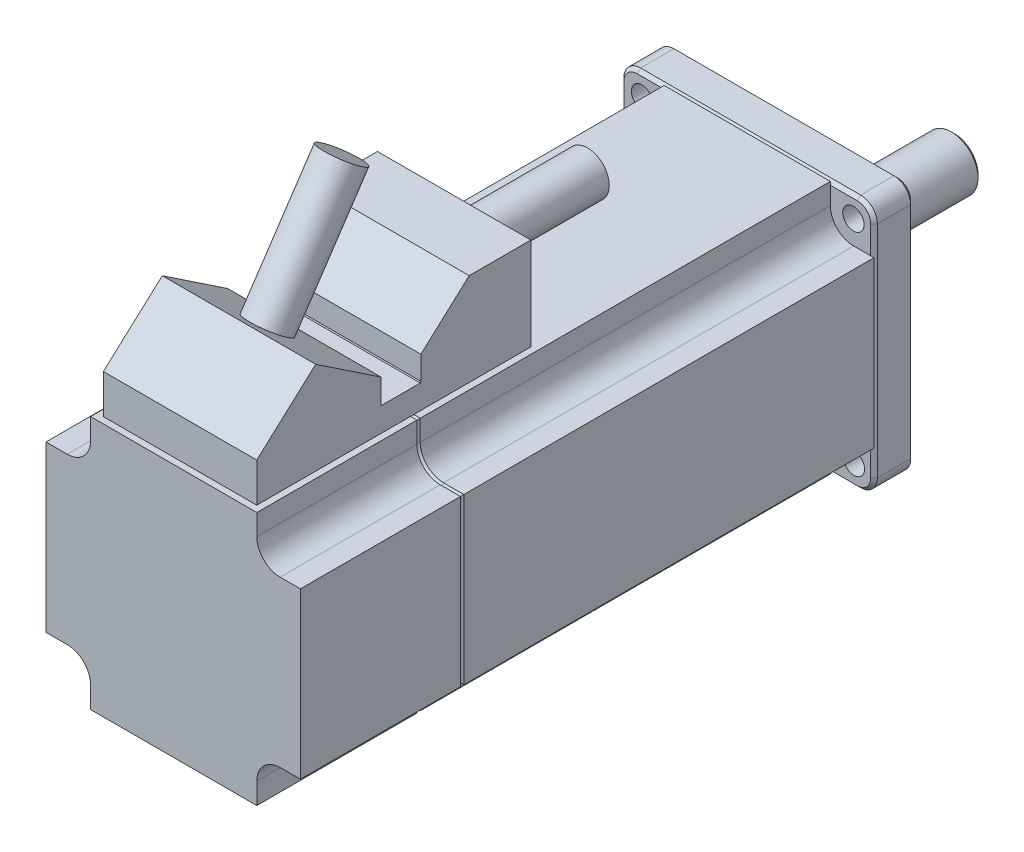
ISO-10303-21;
HEADER;
FILE_DESCRIPTION(('STEP AP214'),'2;1');
FILE_NAME('part.step','',(''),(''),'','','');
FILE_SCHEMA(('AUTOMOTIVE_DESIGN { 1 0 10303 214 1 1 1 1 }'));
ENDSEC;
DATA;
#1=APPLICATION_CONTEXT('core data for automotive mechanical design processes');
#2=APPLICATION_PROTOCOL_DEFINITION('international standard','automotive_design',2000,#1);
#3=PRODUCT_CONTEXT('',#1,'mechanical');
#4=PRODUCT('Part','Part','',(#3));
#5=PRODUCT_RELATED_PRODUCT_CATEGORY('part','',(#4));
#6=PRODUCT_DEFINITION_FORMATION('','',#4);
#7=PRODUCT_DEFINITION_CONTEXT('part definition',#1,'design');
#8=PRODUCT_DEFINITION('design','',#6,#7);
#9=PRODUCT_DEFINITION_SHAPE('','',#8);
#10=(LENGTH_UNIT() NAMED_UNIT(*) SI_UNIT(.MILLI.,.METRE.));
#11=(NAMED_UNIT(*) PLANE_ANGLE_UNIT() SI_UNIT($,.RADIAN.));
#12=(NAMED_UNIT(*) SI_UNIT($,.STERADIAN.) SOLID_ANGLE_UNIT());
#13=UNCERTAINTY_MEASURE_WITH_UNIT(LENGTH_MEASURE(1.E-05),#10,'distance_accuracy_value','');
#14=(GEOMETRIC_REPRESENTATION_CONTEXT(3) GLOBAL_UNCERTAINTY_ASSIGNED_CONTEXT((#13)) GLOBAL_UNIT_ASSIGNED_CONTEXT((#10,
#11,#12)) REPRESENTATION_CONTEXT('',''));
#15=CARTESIAN_POINT('',(0.,0.,0.));
#16=DIRECTION('',(0.,0.,1.));
#17=DIRECTION('',(1.,0.,0.));
#18=AXIS2_PLACEMENT_3D('',#15,#16,#17);
#19=CARTESIAN_POINT('',(30.5,32.8790626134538,43.9438390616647));
#20=DIRECTION('',(0.,0.,1.));
#21=DIRECTION('',(1.,0.,0.));
#22=AXIS2_PLACEMENT_3D('',#19,#20,#21);
#23=PLANE('',#22);
#24=DIRECTION('',(0.,1.,0.));
#25=VECTOR('',#24,1.);
#26=CARTESIAN_POINT('',(7.5,32.8790626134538,43.9438390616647));
#27=LINE('',#26,#25);
#28=CARTESIAN_POINT('',(7.5,19.,43.9438390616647));
#29=VERTEX_POINT('',#28);
#30=CARTESIAN_POINT('',(7.5,32.8790626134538,43.9438390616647));
#31=VERTEX_POINT('',#30);
#32=EDGE_CURVE('E514',#29,#31,#27,.T.);
#33=ORIENTED_EDGE('',*,*,#32,.T.);
#34=DIRECTION('',(-1.,0.,0.));
#35=VECTOR('',#34,1.);
#36=CARTESIAN_POINT('',(30.5,32.8790626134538,43.9438390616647));
#37=LINE('',#36,#35);
#38=CARTESIAN_POINT('',(30.5,32.8790626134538,43.9438390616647));
#39=VERTEX_POINT('',#38);
#40=EDGE_CURVE('E474',#39,#31,#37,.T.);
#41=ORIENTED_EDGE('',*,*,#40,.F.);
#42=DIRECTION('',(0.,1.,0.));
#43=VECTOR('',#42,1.);
#44=CARTESIAN_POINT('',(30.5,32.8790626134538,43.9438390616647));
#45=LINE('',#44,#43);
#46=CARTESIAN_POINT('',(30.5,19.,43.9438390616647));
#47=VERTEX_POINT('',#46);
#48=EDGE_CURVE('E480',#47,#39,#45,.T.);
#49=ORIENTED_EDGE('',*,*,#48,.F.);
#50=DIRECTION('',(-1.,0.,0.));
#51=VECTOR('',#50,1.);
#52=CARTESIAN_POINT('',(30.5,19.,43.9438390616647));
#53=LINE('',#52,#51);
#54=EDGE_CURVE('E469',#47,#29,#53,.T.);
#55=ORIENTED_EDGE('',*,*,#54,.T.);
#56=EDGE_LOOP('',(#33,#41,#49,#55));
#57=FACE_BOUND('',#56,.T.);
#58=CARTESIAN_POINT('',(19.,25.8413244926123,43.9438390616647));
#59=DIRECTION('',(0.,0.,1.));
#60=DIRECTION('',(1.,0.,0.));
#61=AXIS2_PLACEMENT_3D('',#58,#59,#60);
#62=CIRCLE('',#61,3.25);
#63=CARTESIAN_POINT('',(22.25,25.8413244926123,43.9438390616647));
#64=VERTEX_POINT('',#63);
#65=EDGE_CURVE('E11',#64,#64,#62,.F.);
#66=ORIENTED_EDGE('',*,*,#65,.F.);
#67=EDGE_LOOP('',(#66));
#68=FACE_BOUND('',#67,.T.);
#69=ADVANCED_FACE('F16',(#57,#68),#23,.F.);
#70=CARTESIAN_POINT('',(30.5,32.8790626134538,76.2139564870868));
#71=DIRECTION('',(0.,-0.830875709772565,0.556458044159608));
#72=DIRECTION('',(0.,-0.556458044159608,-0.830875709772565));
#73=AXIS2_PLACEMENT_3D('',#70,#71,#72);
#74=PLANE('',#73);
#75=DIRECTION('',(0.,0.556458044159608,0.830875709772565));
#76=VECTOR('',#75,1.);
#77=CARTESIAN_POINT('',(7.5,32.8790626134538,76.2139564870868));
#78=LINE('',#77,#76);
#79=CARTESIAN_POINT('',(7.5,26.2988431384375,66.3886972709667));
#80=VERTEX_POINT('',#79);
#81=CARTESIAN_POINT('',(7.5,32.8790626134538,76.2139564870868));
#82=VERTEX_POINT('',#81);
#83=EDGE_CURVE('E529',#80,#82,#78,.T.);
#84=ORIENTED_EDGE('',*,*,#83,.T.);
#85=DIRECTION('',(-1.,0.,0.));
#86=VECTOR('',#85,1.);
#87=CARTESIAN_POINT('',(30.5,32.8790626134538,76.2139564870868));
#88=LINE('',#87,#86);
#89=CARTESIAN_POINT('',(30.5,32.8790626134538,76.2139564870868));
#90=VERTEX_POINT('',#89);
#91=EDGE_CURVE('E540',#90,#82,#88,.T.);
#92=ORIENTED_EDGE('',*,*,#91,.F.);
#93=DIRECTION('',(0.,0.556458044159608,0.830875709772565));
#94=VECTOR('',#93,1.);
#95=CARTESIAN_POINT('',(30.5,32.8790626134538,76.2139564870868));
#96=LINE('',#95,#94);
#97=CARTESIAN_POINT('',(30.5,26.2988431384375,66.3886972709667));
#98=VERTEX_POINT('',#97);
#99=EDGE_CURVE('E504',#98,#90,#96,.T.);
#100=ORIENTED_EDGE('',*,*,#99,.F.);
#101=DIRECTION('',(-1.,0.,0.));
#102=VECTOR('',#101,1.);
#103=CARTESIAN_POINT('',(30.5,26.2988431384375,66.3886972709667));
#104=LINE('',#103,#102);
#105=EDGE_CURVE('E543',#98,#80,#104,.T.);
#106=ORIENTED_EDGE('',*,*,#105,.T.);
#107=EDGE_LOOP('',(#84,#92,#100,#106));
#108=FACE_BOUND('',#107,.T.);
#109=CARTESIAN_POINT('',(19.,30.0258915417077,71.9537421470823));
#110=DIRECTION('',(0.,-0.830875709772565,0.556458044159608));
#111=DIRECTION('',(0.,-0.556458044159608,-0.830875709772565));
#112=AXIS2_PLACEMENT_3D('',#109,#110,#111);
#113=CIRCLE('',#112,3.15);
#114=CARTESIAN_POINT('',(19.,28.2730487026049,69.3364836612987));
#115=VERTEX_POINT('',#114);
#116=EDGE_CURVE('E24',#115,#115,#113,.F.);
#117=ORIENTED_EDGE('',*,*,#116,.F.);
#118=EDGE_LOOP('',(#117));
#119=FACE_BOUND('',#118,.T.);
#120=ADVANCED_FACE('F1091',(#108,#119),#74,.F.);
#121=CARTESIAN_POINT('',(19.1,0.,-9.));
#122=DIRECTION('',(0.,0.,-1.));
#123=DIRECTION('',(-1.,0.,0.));
#124=AXIS2_PLACEMENT_3D('',#121,#122,#123);
#125=PLANE('',#124);
#126=CARTESIAN_POINT('',(19.1,0.,-9.));
#127=DIRECTION('',(0.,0.,-1.));
#128=DIRECTION('',(-1.,0.,0.));
#129=AXIS2_PLACEMENT_3D('',#126,#127,#128);
#130=CIRCLE('',#129,15.);
#131=CARTESIAN_POINT('',(4.1,0.,-9.));
#132=VERTEX_POINT('',#131);
#133=EDGE_CURVE('E695',#132,#132,#130,.T.);
#134=ORIENTED_EDGE('',*,*,#133,.T.);
#135=EDGE_LOOP('',(#134));
#136=FACE_BOUND('',#135,.T.);
#137=CARTESIAN_POINT('',(19.1,0.,-9.));
#138=DIRECTION('',(0.,0.,-1.));
#139=DIRECTION('',(-1.,0.,0.));
#140=AXIS2_PLACEMENT_3D('',#137,#138,#139);
#141=CIRCLE('',#140,4.);
#142=CARTESIAN_POINT('',(15.1,0.,-9.));
#143=VERTEX_POINT('',#142);
#144=EDGE_CURVE('E692',#143,#143,#141,.T.);
#145=ORIENTED_EDGE('',*,*,#144,.F.);
#146=EDGE_LOOP('',(#145));
#147=FACE_BOUND('',#146,.T.);
#148=ADVANCED_FACE('F1093',(#136,#147),#125,.T.);
#149=CARTESIAN_POINT('',(0.,19.,-6.));
#150=DIRECTION('',(0.,0.,1.));
#151=DIRECTION('',(1.,0.,0.));
#152=AXIS2_PLACEMENT_3D('',#149,#150,#151);
#153=PLANE('',#152);
#154=CARTESIAN_POINT('',(34.9848631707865,-15.809902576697,-6.));
#155=DIRECTION('',(0.,0.,1.));
#156=DIRECTION('',(1.,0.,0.));
#157=AXIS2_PLACEMENT_3D('',#154,#155,#156);
#158=CIRCLE('',#157,1.6);
#159=CARTESIAN_POINT('',(36.5848631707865,-15.809902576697,-6.));
#160=VERTEX_POINT('',#159);
#161=EDGE_CURVE('E1682',#160,#160,#158,.T.);
#162=ORIENTED_EDGE('',*,*,#161,.T.);
#163=EDGE_LOOP('',(#162));
#164=FACE_BOUND('',#163,.T.);
#165=CARTESIAN_POINT('',(3.29009742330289,-15.8848631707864,-6.));
#166=DIRECTION('',(0.,0.,1.));
#167=DIRECTION('',(1.,0.,0.));
#168=AXIS2_PLACEMENT_3D('',#165,#166,#167);
#169=CIRCLE('',#168,1.6);
#170=CARTESIAN_POINT('',(4.89009742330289,-15.8848631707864,-6.));
#171=VERTEX_POINT('',#170);
#172=EDGE_CURVE('E1686',#171,#171,#169,.T.);
#173=ORIENTED_EDGE('',*,*,#172,.T.);
#174=EDGE_LOOP('',(#173));
#175=FACE_BOUND('',#174,.T.);
#176=CARTESIAN_POINT('',(3.21513682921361,15.8099025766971,-6.));
#177=DIRECTION('',(0.,0.,1.));
#178=DIRECTION('',(1.,0.,0.));
#179=AXIS2_PLACEMENT_3D('',#176,#177,#178);
#180=CIRCLE('',#179,1.6);
#181=CARTESIAN_POINT('',(4.81513682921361,15.8099025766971,-6.));
#182=VERTEX_POINT('',#181);
#183=EDGE_CURVE('E1695',#182,#182,#180,.T.);
#184=ORIENTED_EDGE('',*,*,#183,.T.);
#185=EDGE_LOOP('',(#184));
#186=FACE_BOUND('',#185,.T.);
#187=DIRECTION('',(1.,0.,0.));
#188=VECTOR('',#187,1.);
#189=CARTESIAN_POINT('',(35.5,18.5,-6.));
#190=LINE('',#189,#188);
#191=CARTESIAN_POINT('',(2.5,18.5,-6.));
#192=VERTEX_POINT('',#191);
#193=CARTESIAN_POINT('',(35.5,18.5,-6.));
#194=VERTEX_POINT('',#193);
#195=EDGE_CURVE('E1002',#192,#194,#190,.T.);
#196=ORIENTED_EDGE('',*,*,#195,.T.);
#197=CARTESIAN_POINT('',(35.5,16.5,-6.));
#198=DIRECTION('',(0.,0.,1.));
#199=DIRECTION('',(1.,0.,0.));
#200=AXIS2_PLACEMENT_3D('',#197,#198,#199);
#201=CIRCLE('',#200,2.);
#202=CARTESIAN_POINT('',(37.5,16.5,-6.));
#203=VERTEX_POINT('',#202);
#204=EDGE_CURVE('E1004',#194,#203,#201,.F.);
#205=ORIENTED_EDGE('',*,*,#204,.T.);
#206=DIRECTION('',(0.,-1.,0.));
#207=VECTOR('',#206,1.);
#208=CARTESIAN_POINT('',(37.5,-16.5,-6.));
#209=LINE('',#208,#207);
#210=CARTESIAN_POINT('',(37.5,-16.5,-6.));
#211=VERTEX_POINT('',#210);
#212=EDGE_CURVE('E998',#203,#211,#209,.T.);
#213=ORIENTED_EDGE('',*,*,#212,.T.);
#214=CARTESIAN_POINT('',(35.5,-16.5,-6.));
#215=DIRECTION('',(0.,0.,1.));
#216=DIRECTION('',(1.,0.,0.));
#217=AXIS2_PLACEMENT_3D('',#214,#215,#216);
#218=CIRCLE('',#217,2.);
#219=CARTESIAN_POINT('',(35.5,-18.5,-6.));
#220=VERTEX_POINT('',#219);
#221=EDGE_CURVE('E996',#211,#220,#218,.F.);
#222=ORIENTED_EDGE('',*,*,#221,.T.);
#223=DIRECTION('',(-1.,0.,0.));
#224=VECTOR('',#223,1.);
#225=CARTESIAN_POINT('',(2.5,-18.5,-6.));
#226=LINE('',#225,#224);
#227=CARTESIAN_POINT('',(2.5,-18.5,-6.));
#228=VERTEX_POINT('',#227);
#229=EDGE_CURVE('E994',#220,#228,#226,.T.);
#230=ORIENTED_EDGE('',*,*,#229,.T.);
#231=CARTESIAN_POINT('',(2.5,-16.5,-6.));
#232=DIRECTION('',(0.,0.,1.));
#233=DIRECTION('',(1.,0.,0.));
#234=AXIS2_PLACEMENT_3D('',#231,#232,#233);
#235=CIRCLE('',#234,2.);
#236=CARTESIAN_POINT('',(0.5,-16.5,-6.));
#237=VERTEX_POINT('',#236);
#238=EDGE_CURVE('E992',#228,#237,#235,.F.);
#239=ORIENTED_EDGE('',*,*,#238,.T.);
#240=DIRECTION('',(0.,1.,0.));
#241=VECTOR('',#240,1.);
#242=CARTESIAN_POINT('',(0.5,16.5,-6.));
#243=LINE('',#242,#241);
#244=CARTESIAN_POINT('',(0.5,16.5,-6.));
#245=VERTEX_POINT('',#244);
#246=EDGE_CURVE('E945',#237,#245,#243,.T.);
#247=ORIENTED_EDGE('',*,*,#246,.T.);
#248=CARTESIAN_POINT('',(2.5,16.5,-6.));
#249=DIRECTION('',(0.,0.,1.));
#250=DIRECTION('',(1.,0.,0.));
#251=AXIS2_PLACEMENT_3D('',#248,#249,#250);
#252=CIRCLE('',#251,2.);
#253=EDGE_CURVE('E1000',#245,#192,#252,.F.);
#254=ORIENTED_EDGE('',*,*,#253,.T.);
#255=EDGE_LOOP('',(#196,#205,#213,#222,#230,#239,#247,#254));
#256=FACE_BOUND('',#255,.T.);
#257=CARTESIAN_POINT('',(34.9099025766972,15.8848631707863,-6.));
#258=DIRECTION('',(0.,0.,1.));
#259=DIRECTION('',(1.,0.,0.));
#260=AXIS2_PLACEMENT_3D('',#257,#258,#259);
#261=CIRCLE('',#260,1.6);
#262=CARTESIAN_POINT('',(36.5099025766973,15.8848631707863,-6.));
#263=VERTEX_POINT('',#262);
#264=EDGE_CURVE('E565',#263,#263,#261,.T.);
#265=ORIENTED_EDGE('',*,*,#264,.T.);
#266=EDGE_LOOP('',(#265));
#267=FACE_BOUND('',#266,.T.);
#268=CARTESIAN_POINT('',(19.1,0.,-6.));
#269=DIRECTION('',(0.,0.,1.));
#270=DIRECTION('',(1.,0.,0.));
#271=AXIS2_PLACEMENT_3D('',#268,#269,#270);
#272=CIRCLE('',#271,15.);
#273=CARTESIAN_POINT('',(34.1,0.,-6.));
#274=VERTEX_POINT('',#273);
#275=EDGE_CURVE('E836',#274,#274,#272,.F.);
#276=ORIENTED_EDGE('',*,*,#275,.F.);
#277=EDGE_LOOP('',(#276));
#278=FACE_BOUND('',#277,.T.);
#279=ADVANCED_FACE('F1102',(#164,#175,#186,#256,#267,#278),#153,.F.);
#280=CARTESIAN_POINT('',(0.,19.,0.));
#281=DIRECTION('',(0.,0.,-1.));
#282=DIRECTION('',(-1.,0.,0.));
#283=AXIS2_PLACEMENT_3D('',#280,#281,#282);
#284=PLANE('',#283);
#285=DIRECTION('',(-1.,0.,0.));
#286=VECTOR('',#285,1.);
#287=CARTESIAN_POINT('',(3.04033238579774,-12.3599813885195,0.));
#288=LINE('',#287,#286);
#289=CARTESIAN_POINT('',(0.5,-12.3599813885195,0.));
#290=VERTEX_POINT('',#289);
#291=CARTESIAN_POINT('',(0.,-12.3599813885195,0.));
#292=VERTEX_POINT('',#291);
#293=EDGE_CURVE('E699',#290,#292,#288,.T.);
#294=ORIENTED_EDGE('',*,*,#293,.T.);
#295=DIRECTION('',(0.,-1.,0.));
#296=VECTOR('',#295,1.);
#297=CARTESIAN_POINT('',(0.,19.,0.));
#298=LINE('',#297,#296);
#299=CARTESIAN_POINT('',(0.,12.3599813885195,0.));
#300=VERTEX_POINT('',#299);
#301=EDGE_CURVE('E795',#300,#292,#298,.T.);
#302=ORIENTED_EDGE('',*,*,#301,.F.);
#303=DIRECTION('',(1.,0.,0.));
#304=VECTOR('',#303,1.);
#305=CARTESIAN_POINT('',(3.04033238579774,12.3599813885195,0.));
#306=LINE('',#305,#304);
#307=CARTESIAN_POINT('',(0.5,12.3599813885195,0.));
#308=VERTEX_POINT('',#307);
#309=EDGE_CURVE('E752',#300,#308,#306,.T.);
#310=ORIENTED_EDGE('',*,*,#309,.T.);
#311=DIRECTION('',(0.,-1.,0.));
#312=VECTOR('',#311,1.);
#313=CARTESIAN_POINT('',(0.5,19.,0.));
#314=LINE('',#313,#312);
#315=EDGE_CURVE('E816',#308,#290,#314,.T.);
#316=ORIENTED_EDGE('',*,*,#315,.T.);
#317=EDGE_LOOP('',(#294,#302,#310,#316));
#318=FACE_BOUND('',#317,.T.);
#319=ADVANCED_FACE('F1296',(#318),#284,.T.);
#320=DIRECTION('',(0.,1.,0.));
#321=VECTOR('',#320,1.);
#322=CARTESIAN_POINT('',(6.54033238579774,-15.8599813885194,0.));
#323=LINE('',#322,#321);
#324=CARTESIAN_POINT('',(6.54033238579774,-19.,0.));
#325=VERTEX_POINT('',#324);
#326=CARTESIAN_POINT('',(6.54033238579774,-18.5,0.));
#327=VERTEX_POINT('',#326);
#328=EDGE_CURVE('E709',#325,#327,#323,.T.);
#329=ORIENTED_EDGE('',*,*,#328,.T.);
#330=DIRECTION('',(1.,0.,0.));
#331=VECTOR('',#330,1.);
#332=CARTESIAN_POINT('',(0.,-18.5,0.));
#333=LINE('',#332,#331);
#334=CARTESIAN_POINT('',(31.4596676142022,-18.5,0.));
#335=VERTEX_POINT('',#334);
#336=EDGE_CURVE('E812',#327,#335,#333,.T.);
#337=ORIENTED_EDGE('',*,*,#336,.T.);
#338=DIRECTION('',(0.,-1.,0.));
#339=VECTOR('',#338,1.);
#340=CARTESIAN_POINT('',(31.4596676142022,-15.8599813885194,0.));
#341=LINE('',#340,#339);
#342=CARTESIAN_POINT('',(31.4596676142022,-19.,0.));
#343=VERTEX_POINT('',#342);
#344=EDGE_CURVE('E725',#335,#343,#341,.T.);
#345=ORIENTED_EDGE('',*,*,#344,.T.);
#346=DIRECTION('',(1.,0.,0.));
#347=VECTOR('',#346,1.);
#348=CARTESIAN_POINT('',(0.,-19.,0.));
#349=LINE('',#348,#347);
#350=EDGE_CURVE('E798',#325,#343,#349,.T.);
#351=ORIENTED_EDGE('',*,*,#350,.F.);
#352=EDGE_LOOP('',(#329,#337,#345,#351));
#353=FACE_BOUND('',#352,.T.);
#354=ADVANCED_FACE('F1769',(#353),#284,.T.);
#355=DIRECTION('',(-1.,0.,0.));
#356=VECTOR('',#355,1.);
#357=CARTESIAN_POINT('',(34.9596676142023,-12.3599813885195,0.));
#358=LINE('',#357,#356);
#359=CARTESIAN_POINT('',(38.,-12.3599813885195,0.));
#360=VERTEX_POINT('',#359);
#361=CARTESIAN_POINT('',(37.5,-12.3599813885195,0.));
#362=VERTEX_POINT('',#361);
#363=EDGE_CURVE('E735',#360,#362,#358,.T.);
#364=ORIENTED_EDGE('',*,*,#363,.T.);
#365=DIRECTION('',(0.,1.,0.));
#366=VECTOR('',#365,1.);
#367=CARTESIAN_POINT('',(37.5,19.,0.));
#368=LINE('',#367,#366);
#369=CARTESIAN_POINT('',(37.5,12.3599813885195,0.));
#370=VERTEX_POINT('',#369);
#371=EDGE_CURVE('E813',#362,#370,#368,.T.);
#372=ORIENTED_EDGE('',*,*,#371,.T.);
#373=DIRECTION('',(-1.,0.,0.));
#374=VECTOR('',#373,1.);
#375=CARTESIAN_POINT('',(0.,12.3599813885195,0.));
#376=LINE('',#375,#374);
#377=CARTESIAN_POINT('',(38.,12.3599813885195,0.));
#378=VERTEX_POINT('',#377);
#379=EDGE_CURVE('E831',#378,#370,#376,.T.);
#380=ORIENTED_EDGE('',*,*,#379,.F.);
#381=DIRECTION('',(0.,1.,0.));
#382=VECTOR('',#381,1.);
#383=CARTESIAN_POINT('',(38.,-19.,0.));
#384=LINE('',#383,#382);
#385=EDGE_CURVE('E800',#360,#378,#384,.T.);
#386=ORIENTED_EDGE('',*,*,#385,.F.);
#387=EDGE_LOOP('',(#364,#372,#380,#386));
#388=FACE_BOUND('',#387,.T.);
#389=ADVANCED_FACE('F1297',(#388),#284,.T.);
#390=CARTESIAN_POINT('',(0.,19.,-6.));
#391=DIRECTION('',(-1.,0.,0.));
#392=DIRECTION('',(0.,-1.,0.));
#393=AXIS2_PLACEMENT_3D('',#390,#391,#392);
#394=PLANE('',#393);
#395=DIRECTION('',(0.,0.,1.));
#396=VECTOR('',#395,1.);
#397=CARTESIAN_POINT('',(0.,16.5,-6.));
#398=LINE('',#397,#396);
#399=CARTESIAN_POINT('',(0.,16.5,-0.5));
#400=VERTEX_POINT('',#399);
#401=CARTESIAN_POINT('',(0.,16.5,-5.5));
#402=VERTEX_POINT('',#401);
#403=EDGE_CURVE('E851',#400,#402,#398,.F.);
#404=ORIENTED_EDGE('',*,*,#403,.T.);
#405=DIRECTION('',(0.,-1.,0.));
#406=VECTOR('',#405,1.);
#407=CARTESIAN_POINT('',(0.,-16.5,-5.5));
#408=LINE('',#407,#406);
#409=CARTESIAN_POINT('',(0.,-16.5,-5.5));
#410=VERTEX_POINT('',#409);
#411=EDGE_CURVE('E1030',#402,#410,#408,.T.);
#412=ORIENTED_EDGE('',*,*,#411,.T.);
#413=DIRECTION('',(0.,0.,1.));
#414=VECTOR('',#413,1.);
#415=CARTESIAN_POINT('',(0.,-16.5,-6.));
#416=LINE('',#415,#414);
#417=CARTESIAN_POINT('',(0.,-16.5,-0.5));
#418=VERTEX_POINT('',#417);
#419=EDGE_CURVE('E854',#410,#418,#416,.T.);
#420=ORIENTED_EDGE('',*,*,#419,.T.);
#421=DIRECTION('',(0.,1.,0.));
#422=VECTOR('',#421,1.);
#423=CARTESIAN_POINT('',(0.,19.,-0.5));
#424=LINE('',#423,#422);
#425=EDGE_CURVE('E819',#418,#400,#424,.T.);
#426=ORIENTED_EDGE('',*,*,#425,.T.);
#427=EDGE_LOOP('',(#404,#412,#420,#426));
#428=FACE_BOUND('',#427,.T.);
#429=ADVANCED_FACE('F1320',(#428),#394,.T.);
#430=CARTESIAN_POINT('',(0.,19.,-6.));
#431=DIRECTION('',(0.,1.,0.));
#432=DIRECTION('',(0.,0.,1.));
#433=AXIS2_PLACEMENT_3D('',#430,#431,#432);
#434=PLANE('',#433);
#435=DIRECTION('',(0.,0.,1.));
#436=VECTOR('',#435,1.);
#437=CARTESIAN_POINT('',(35.5,19.,-6.));
#438=LINE('',#437,#436);
#439=CARTESIAN_POINT('',(35.5,19.,-0.5));
#440=VERTEX_POINT('',#439);
#441=CARTESIAN_POINT('',(35.5,19.,-5.5));
#442=VERTEX_POINT('',#441);
#443=EDGE_CURVE('E857',#440,#442,#438,.F.);
#444=ORIENTED_EDGE('',*,*,#443,.T.);
#445=DIRECTION('',(-1.,0.,0.));
#446=VECTOR('',#445,1.);
#447=CARTESIAN_POINT('',(2.5,19.,-5.5));
#448=LINE('',#447,#446);
#449=CARTESIAN_POINT('',(2.5,19.,-5.5));
#450=VERTEX_POINT('',#449);
#451=EDGE_CURVE('E1012',#442,#450,#448,.T.);
#452=ORIENTED_EDGE('',*,*,#451,.T.);
#453=DIRECTION('',(0.,0.,1.));
#454=VECTOR('',#453,1.);
#455=CARTESIAN_POINT('',(2.5,19.,-6.));
#456=LINE('',#455,#454);
#457=CARTESIAN_POINT('',(2.5,19.,-0.5));
#458=VERTEX_POINT('',#457);
#459=EDGE_CURVE('E860',#450,#458,#456,.T.);
#460=ORIENTED_EDGE('',*,*,#459,.T.);
#461=DIRECTION('',(1.,0.,0.));
#462=VECTOR('',#461,1.);
#463=CARTESIAN_POINT('',(0.,19.,-0.5));
#464=LINE('',#463,#462);
#465=EDGE_CURVE('E828',#458,#440,#464,.T.);
#466=ORIENTED_EDGE('',*,*,#465,.T.);
#467=EDGE_LOOP('',(#444,#452,#460,#466));
#468=FACE_BOUND('',#467,.T.);
#469=ADVANCED_FACE('F1316',(#468),#434,.T.);
#470=CARTESIAN_POINT('',(38.,19.,-6.));
#471=DIRECTION('',(1.,0.,0.));
#472=DIRECTION('',(0.,1.,0.));
#473=AXIS2_PLACEMENT_3D('',#470,#471,#472);
#474=PLANE('',#473);
#475=DIRECTION('',(0.,0.,1.));
#476=VECTOR('',#475,1.);
#477=CARTESIAN_POINT('',(38.,-16.5,-6.));
#478=LINE('',#477,#476);
#479=CARTESIAN_POINT('',(38.,-16.5,-0.5));
#480=VERTEX_POINT('',#479);
#481=CARTESIAN_POINT('',(38.,-16.5,-5.5));
#482=VERTEX_POINT('',#481);
#483=EDGE_CURVE('E848',#480,#482,#478,.F.);
#484=ORIENTED_EDGE('',*,*,#483,.T.);
#485=DIRECTION('',(0.,1.,0.));
#486=VECTOR('',#485,1.);
#487=CARTESIAN_POINT('',(38.,16.5,-5.5));
#488=LINE('',#487,#486);
#489=CARTESIAN_POINT('',(38.,16.5,-5.5));
#490=VERTEX_POINT('',#489);
#491=EDGE_CURVE('E1018',#482,#490,#488,.T.);
#492=ORIENTED_EDGE('',*,*,#491,.T.);
#493=DIRECTION('',(0.,0.,1.));
#494=VECTOR('',#493,1.);
#495=CARTESIAN_POINT('',(38.,16.5,-6.));
#496=LINE('',#495,#494);
#497=CARTESIAN_POINT('',(38.,16.5,-0.5));
#498=VERTEX_POINT('',#497);
#499=EDGE_CURVE('E845',#490,#498,#496,.T.);
#500=ORIENTED_EDGE('',*,*,#499,.T.);
#501=DIRECTION('',(0.,-1.,0.));
#502=VECTOR('',#501,1.);
#503=CARTESIAN_POINT('',(38.,19.,-0.5));
#504=LINE('',#503,#502);
#505=EDGE_CURVE('E825',#498,#480,#504,.T.);
#506=ORIENTED_EDGE('',*,*,#505,.T.);
#507=EDGE_LOOP('',(#484,#492,#500,#506));
#508=FACE_BOUND('',#507,.T.);
#509=ADVANCED_FACE('F1319',(#508),#474,.T.);
#510=CARTESIAN_POINT('',(0.,-19.,-6.));
#511=DIRECTION('',(0.,-1.,0.));
#512=DIRECTION('',(1.,0.,0.));
#513=AXIS2_PLACEMENT_3D('',#510,#511,#512);
#514=PLANE('',#513);
#515=DIRECTION('',(0.,0.,1.));
#516=VECTOR('',#515,1.);
#517=CARTESIAN_POINT('',(2.5,-19.,-6.));
#518=LINE('',#517,#516);
#519=CARTESIAN_POINT('',(2.5,-19.,-0.5));
#520=VERTEX_POINT('',#519);
#521=CARTESIAN_POINT('',(2.5,-19.,-5.5));
#522=VERTEX_POINT('',#521);
#523=EDGE_CURVE('E839',#520,#522,#518,.F.);
#524=ORIENTED_EDGE('',*,*,#523,.T.);
#525=DIRECTION('',(1.,0.,0.));
#526=VECTOR('',#525,1.);
#527=CARTESIAN_POINT('',(35.5,-19.,-5.5));
#528=LINE('',#527,#526);
#529=CARTESIAN_POINT('',(35.5,-19.,-5.5));
#530=VERTEX_POINT('',#529);
#531=EDGE_CURVE('E1024',#522,#530,#528,.T.);
#532=ORIENTED_EDGE('',*,*,#531,.T.);
#533=DIRECTION('',(0.,0.,1.));
#534=VECTOR('',#533,1.);
#535=CARTESIAN_POINT('',(35.5,-19.,-6.));
#536=LINE('',#535,#534);
#537=CARTESIAN_POINT('',(35.5,-19.,-0.5));
#538=VERTEX_POINT('',#537);
#539=EDGE_CURVE('E842',#530,#538,#536,.T.);
#540=ORIENTED_EDGE('',*,*,#539,.T.);
#541=DIRECTION('',(-1.,0.,0.));
#542=VECTOR('',#541,1.);
#543=CARTESIAN_POINT('',(0.,-19.,-0.5));
#544=LINE('',#543,#542);
#545=EDGE_CURVE('E822',#538,#520,#544,.T.);
#546=ORIENTED_EDGE('',*,*,#545,.T.);
#547=EDGE_LOOP('',(#524,#532,#540,#546));
#548=FACE_BOUND('',#547,.T.);
#549=ADVANCED_FACE('F1324',(#548),#514,.T.);
#550=CARTESIAN_POINT('',(37.5,19.,0.));
#551=DIRECTION('',(-0.707106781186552,0.,-0.707106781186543));
#552=DIRECTION('',(-0.707106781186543,0.,0.707106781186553));
#553=AXIS2_PLACEMENT_3D('',#550,#551,#552);
#554=PLANE('',#553);
#555=CARTESIAN_POINT('',(37.5,-16.5,0.));
#556=VERTEX_POINT('',#555);
#557=EDGE_CURVE('E810',#556,#362,#368,.T.);
#558=ORIENTED_EDGE('',*,*,#557,.F.);
#559=DIRECTION('',(0.707106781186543,0.,-0.707106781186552));
#560=VECTOR('',#559,1.);
#561=CARTESIAN_POINT('',(36.5,-16.5,1.));
#562=LINE('',#561,#560);
#563=EDGE_CURVE('E1048',#556,#480,#562,.T.);
#564=ORIENTED_EDGE('',*,*,#563,.T.);
#565=ORIENTED_EDGE('',*,*,#505,.F.);
#566=DIRECTION('',(0.707106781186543,0.,-0.707106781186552));
#567=VECTOR('',#566,1.);
#568=CARTESIAN_POINT('',(36.5,16.5,1.));
#569=LINE('',#568,#567);
#570=CARTESIAN_POINT('',(37.5,16.5,0.));
#571=VERTEX_POINT('',#570);
#572=EDGE_CURVE('E1046',#498,#571,#569,.F.);
#573=ORIENTED_EDGE('',*,*,#572,.T.);
#574=EDGE_CURVE('E808',#370,#571,#368,.T.);
#575=ORIENTED_EDGE('',*,*,#574,.F.);
#576=ORIENTED_EDGE('',*,*,#371,.F.);
#577=EDGE_LOOP('',(#558,#564,#565,#573,#575,#576));
#578=FACE_BOUND('',#577,.T.);
#579=ADVANCED_FACE('F1328',(#578),#554,.F.);
#580=CARTESIAN_POINT('',(0.,18.5,0.));
#581=DIRECTION('',(0.,-0.707106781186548,-0.707106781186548));
#582=DIRECTION('',(0.,0.707106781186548,-0.707106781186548));
#583=AXIS2_PLACEMENT_3D('',#580,#581,#582);
#584=PLANE('',#583);
#585=ORIENTED_EDGE('',*,*,#465,.F.);
#586=DIRECTION('',(0.,0.707106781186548,-0.707106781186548));
#587=VECTOR('',#586,1.);
#588=CARTESIAN_POINT('',(2.5,17.5,1.));
#589=LINE('',#588,#587);
#590=CARTESIAN_POINT('',(2.5,18.5,0.));
#591=VERTEX_POINT('',#590);
#592=EDGE_CURVE('E1055',#458,#591,#589,.F.);
#593=ORIENTED_EDGE('',*,*,#592,.T.);
#594=DIRECTION('',(-1.,0.,0.));
#595=VECTOR('',#594,1.);
#596=CARTESIAN_POINT('',(0.,18.5,0.));
#597=LINE('',#596,#595);
#598=CARTESIAN_POINT('',(6.54033238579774,18.5,0.));
#599=VERTEX_POINT('',#598);
#600=EDGE_CURVE('E805',#599,#591,#597,.T.);
#601=ORIENTED_EDGE('',*,*,#600,.F.);
#602=CARTESIAN_POINT('',(31.4596676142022,18.5,0.));
#603=VERTEX_POINT('',#602);
#604=EDGE_CURVE('E809',#603,#599,#597,.T.);
#605=ORIENTED_EDGE('',*,*,#604,.F.);
#606=CARTESIAN_POINT('',(35.5,18.5,0.));
#607=VERTEX_POINT('',#606);
#608=EDGE_CURVE('E806',#607,#603,#597,.T.);
#609=ORIENTED_EDGE('',*,*,#608,.F.);
#610=DIRECTION('',(0.,0.707106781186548,-0.707106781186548));
#611=VECTOR('',#610,1.);
#612=CARTESIAN_POINT('',(35.5,17.5,1.));
#613=LINE('',#612,#611);
#614=EDGE_CURVE('E1053',#607,#440,#613,.T.);
#615=ORIENTED_EDGE('',*,*,#614,.T.);
#616=EDGE_LOOP('',(#585,#593,#601,#605,#609,#615));
#617=FACE_BOUND('',#616,.T.);
#618=ADVANCED_FACE('F1339',(#617),#584,.F.);
#619=CARTESIAN_POINT('',(0.,-18.5,0.));
#620=DIRECTION('',(0.,0.707106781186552,-0.707106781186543));
#621=DIRECTION('',(0.,0.707106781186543,0.707106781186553));
#622=AXIS2_PLACEMENT_3D('',#619,#620,#621);
#623=PLANE('',#622);
#624=CARTESIAN_POINT('',(2.5,-18.5,0.));
#625=VERTEX_POINT('',#624);
#626=EDGE_CURVE('E814',#625,#327,#333,.T.);
#627=ORIENTED_EDGE('',*,*,#626,.F.);
#628=DIRECTION('',(0.,-0.707106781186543,-0.707106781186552));
#629=VECTOR('',#628,1.);
#630=CARTESIAN_POINT('',(2.5,-17.5,1.));
#631=LINE('',#630,#629);
#632=EDGE_CURVE('E1037',#625,#520,#631,.T.);
#633=ORIENTED_EDGE('',*,*,#632,.T.);
#634=ORIENTED_EDGE('',*,*,#545,.F.);
#635=DIRECTION('',(0.,-0.707106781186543,-0.707106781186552));
#636=VECTOR('',#635,1.);
#637=CARTESIAN_POINT('',(35.5,-17.5,1.));
#638=LINE('',#637,#636);
#639=CARTESIAN_POINT('',(35.5,-18.5,0.));
#640=VERTEX_POINT('',#639);
#641=EDGE_CURVE('E1035',#538,#640,#638,.F.);
#642=ORIENTED_EDGE('',*,*,#641,.T.);
#643=DIRECTION('',(-1.,0.,0.));
#644=VECTOR('',#643,1.);
#645=CARTESIAN_POINT('',(0.,-18.5,0.));
#646=LINE('',#645,#644);
#647=EDGE_CURVE('E748',#335,#640,#646,.F.);
#648=ORIENTED_EDGE('',*,*,#647,.F.);
#649=ORIENTED_EDGE('',*,*,#336,.F.);
#650=EDGE_LOOP('',(#627,#633,#634,#642,#648,#649));
#651=FACE_BOUND('',#650,.T.);
#652=ADVANCED_FACE('F1335',(#651),#623,.F.);
#653=CARTESIAN_POINT('',(0.5,19.,0.));
#654=DIRECTION('',(0.707106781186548,0.,-0.707106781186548));
#655=DIRECTION('',(-0.707106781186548,0.,-0.707106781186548));
#656=AXIS2_PLACEMENT_3D('',#653,#654,#655);
#657=PLANE('',#656);
#658=ORIENTED_EDGE('',*,*,#425,.F.);
#659=DIRECTION('',(-0.707106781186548,0.,-0.707106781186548));
#660=VECTOR('',#659,1.);
#661=CARTESIAN_POINT('',(1.5,-16.5,1.));
#662=LINE('',#661,#660);
#663=CARTESIAN_POINT('',(0.5,-16.5,0.));
#664=VERTEX_POINT('',#663);
#665=EDGE_CURVE('E1041',#418,#664,#662,.F.);
#666=ORIENTED_EDGE('',*,*,#665,.T.);
#667=DIRECTION('',(0.,1.,0.));
#668=VECTOR('',#667,1.);
#669=CARTESIAN_POINT('',(0.5,19.,0.));
#670=LINE('',#669,#668);
#671=EDGE_CURVE('E722',#290,#664,#670,.F.);
#672=ORIENTED_EDGE('',*,*,#671,.F.);
#673=ORIENTED_EDGE('',*,*,#315,.F.);
#674=CARTESIAN_POINT('',(0.5,16.5,0.));
#675=VERTEX_POINT('',#674);
#676=EDGE_CURVE('E817',#675,#308,#314,.T.);
#677=ORIENTED_EDGE('',*,*,#676,.F.);
#678=DIRECTION('',(-0.707106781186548,0.,-0.707106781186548));
#679=VECTOR('',#678,1.);
#680=CARTESIAN_POINT('',(1.5,16.5,1.));
#681=LINE('',#680,#679);
#682=EDGE_CURVE('E1039',#675,#400,#681,.T.);
#683=ORIENTED_EDGE('',*,*,#682,.T.);
#684=EDGE_LOOP('',(#658,#666,#672,#673,#677,#683));
#685=FACE_BOUND('',#684,.T.);
#686=ADVANCED_FACE('F1311',(#685),#657,.F.);
#687=CARTESIAN_POINT('',(0.,19.,62.));
#688=DIRECTION('',(1.,0.,0.));
#689=DIRECTION('',(0.,1.,0.));
#690=AXIS2_PLACEMENT_3D('',#687,#688,#689);
#691=PLANE('',#690);
#692=DIRECTION('',(0.,0.,1.));
#693=VECTOR('',#692,1.);
#694=CARTESIAN_POINT('',(0.,-12.3599813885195,-9.32018212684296));
#695=LINE('',#694,#693);
#696=CARTESIAN_POINT('',(0.,-12.3599813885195,61.5));
#697=VERTEX_POINT('',#696);
#698=EDGE_CURVE('E703',#292,#697,#695,.T.);
#699=ORIENTED_EDGE('',*,*,#698,.T.);
#700=DIRECTION('',(0.,1.,0.));
#701=VECTOR('',#700,1.);
#702=CARTESIAN_POINT('',(0.,19.,61.5));
#703=LINE('',#702,#701);
#704=CARTESIAN_POINT('',(0.,12.3599813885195,61.5));
#705=VERTEX_POINT('',#704);
#706=EDGE_CURVE('E918',#697,#705,#703,.T.);
#707=ORIENTED_EDGE('',*,*,#706,.T.);
#708=DIRECTION('',(0.,0.,1.));
#709=VECTOR('',#708,1.);
#710=CARTESIAN_POINT('',(0.,12.3599813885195,-9.32018212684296));
#711=LINE('',#710,#709);
#712=EDGE_CURVE('E766',#300,#705,#711,.T.);
#713=ORIENTED_EDGE('',*,*,#712,.F.);
#714=ORIENTED_EDGE('',*,*,#301,.T.);
#715=EDGE_LOOP('',(#699,#707,#713,#714));
#716=FACE_BOUND('',#715,.T.);
#717=ADVANCED_FACE('F1307',(#716),#691,.F.);
#718=CARTESIAN_POINT('',(0.,-19.,62.));
#719=DIRECTION('',(0.,1.,0.));
#720=DIRECTION('',(-1.,0.,0.));
#721=AXIS2_PLACEMENT_3D('',#718,#719,#720);
#722=PLANE('',#721);
#723=DIRECTION('',(0.,0.,1.));
#724=VECTOR('',#723,1.);
#725=CARTESIAN_POINT('',(31.4596676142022,-19.,-9.32018212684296));
#726=LINE('',#725,#724);
#727=CARTESIAN_POINT('',(31.4596676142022,-19.,61.5));
#728=VERTEX_POINT('',#727);
#729=EDGE_CURVE('E729',#343,#728,#726,.T.);
#730=ORIENTED_EDGE('',*,*,#729,.T.);
#731=DIRECTION('',(-1.,0.,0.));
#732=VECTOR('',#731,1.);
#733=CARTESIAN_POINT('',(0.,-19.,61.5));
#734=LINE('',#733,#732);
#735=CARTESIAN_POINT('',(6.54033238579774,-19.,61.5));
#736=VERTEX_POINT('',#735);
#737=EDGE_CURVE('E926',#728,#736,#734,.T.);
#738=ORIENTED_EDGE('',*,*,#737,.T.);
#739=DIRECTION('',(0.,0.,1.));
#740=VECTOR('',#739,1.);
#741=CARTESIAN_POINT('',(6.54033238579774,-19.,-9.32018212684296));
#742=LINE('',#741,#740);
#743=EDGE_CURVE('E715',#325,#736,#742,.T.);
#744=ORIENTED_EDGE('',*,*,#743,.F.);
#745=ORIENTED_EDGE('',*,*,#350,.T.);
#746=EDGE_LOOP('',(#730,#738,#744,#745));
#747=FACE_BOUND('',#746,.T.);
#748=ADVANCED_FACE('F1303',(#747),#722,.F.);
#749=CARTESIAN_POINT('',(38.,-19.,62.));
#750=DIRECTION('',(-1.,0.,0.));
#751=DIRECTION('',(0.,-1.,0.));
#752=AXIS2_PLACEMENT_3D('',#749,#750,#751);
#753=PLANE('',#752);
#754=DIRECTION('',(0.,0.,1.));
#755=VECTOR('',#754,1.);
#756=CARTESIAN_POINT('',(38.,12.3599813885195,-9.32018212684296));
#757=LINE('',#756,#755);
#758=CARTESIAN_POINT('',(38.,12.3599813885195,61.5));
#759=VERTEX_POINT('',#758);
#760=EDGE_CURVE('E781',#378,#759,#757,.T.);
#761=ORIENTED_EDGE('',*,*,#760,.T.);
#762=DIRECTION('',(0.,-1.,0.));
#763=VECTOR('',#762,1.);
#764=CARTESIAN_POINT('',(38.,-19.,61.5));
#765=LINE('',#764,#763);
#766=CARTESIAN_POINT('',(38.,-12.3599813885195,61.5));
#767=VERTEX_POINT('',#766);
#768=EDGE_CURVE('E934',#759,#767,#765,.T.);
#769=ORIENTED_EDGE('',*,*,#768,.T.);
#770=DIRECTION('',(0.,0.,1.));
#771=VECTOR('',#770,1.);
#772=CARTESIAN_POINT('',(38.,-12.3599813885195,-9.32018212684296));
#773=LINE('',#772,#771);
#774=EDGE_CURVE('E741',#360,#767,#773,.T.);
#775=ORIENTED_EDGE('',*,*,#774,.F.);
#776=ORIENTED_EDGE('',*,*,#385,.T.);
#777=EDGE_LOOP('',(#761,#769,#775,#776));
#778=FACE_BOUND('',#777,.T.);
#779=ADVANCED_FACE('F1300',(#778),#753,.F.);
#780=CARTESIAN_POINT('',(38.,19.,62.));
#781=DIRECTION('',(0.,-1.,0.));
#782=DIRECTION('',(0.,0.,-1.));
#783=AXIS2_PLACEMENT_3D('',#780,#781,#782);
#784=PLANE('',#783);
#785=DIRECTION('',(1.,0.,0.));
#786=VECTOR('',#785,1.);
#787=CARTESIAN_POINT('',(38.,19.,61.5));
#788=LINE('',#787,#786);
#789=CARTESIAN_POINT('',(6.54033238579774,19.,61.5));
#790=VERTEX_POINT('',#789);
#791=CARTESIAN_POINT('',(7.5,19.,61.5));
#792=VERTEX_POINT('',#791);
#793=EDGE_CURVE('E943',#790,#792,#788,.T.);
#794=ORIENTED_EDGE('',*,*,#793,.T.);
#795=DIRECTION('',(0.,0.,-1.));
#796=VECTOR('',#795,1.);
#797=CARTESIAN_POINT('',(7.5,19.,43.9438390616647));
#798=LINE('',#797,#796);
#799=EDGE_CURVE('E31',#792,#29,#798,.T.);
#800=ORIENTED_EDGE('',*,*,#799,.T.);
#801=ORIENTED_EDGE('',*,*,#54,.F.);
#802=DIRECTION('',(0.,0.,-1.));
#803=VECTOR('',#802,1.);
#804=CARTESIAN_POINT('',(30.5,19.,43.9438390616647));
#805=LINE('',#804,#803);
#806=CARTESIAN_POINT('',(30.5,19.,61.5));
#807=VERTEX_POINT('',#806);
#808=EDGE_CURVE('E37',#807,#47,#805,.T.);
#809=ORIENTED_EDGE('',*,*,#808,.F.);
#810=CARTESIAN_POINT('',(31.4596676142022,19.,61.5));
#811=VERTEX_POINT('',#810);
#812=EDGE_CURVE('E942',#807,#811,#788,.T.);
#813=ORIENTED_EDGE('',*,*,#812,.T.);
#814=DIRECTION('',(0.,0.,1.));
#815=VECTOR('',#814,1.);
#816=CARTESIAN_POINT('',(31.4596676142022,19.,-9.32018212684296));
#817=LINE('',#816,#815);
#818=CARTESIAN_POINT('',(31.4596676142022,19.,0.));
#819=VERTEX_POINT('',#818);
#820=EDGE_CURVE('E788',#819,#811,#817,.T.);
#821=ORIENTED_EDGE('',*,*,#820,.F.);
#822=DIRECTION('',(-1.,0.,0.));
#823=VECTOR('',#822,1.);
#824=CARTESIAN_POINT('',(38.,19.,0.));
#825=LINE('',#824,#823);
#826=CARTESIAN_POINT('',(6.54033238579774,19.,0.));
#827=VERTEX_POINT('',#826);
#828=EDGE_CURVE('E802',#819,#827,#825,.T.);
#829=ORIENTED_EDGE('',*,*,#828,.T.);
#830=DIRECTION('',(0.,0.,1.));
#831=VECTOR('',#830,1.);
#832=CARTESIAN_POINT('',(6.54033238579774,19.,-9.32018212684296));
#833=LINE('',#832,#831);
#834=EDGE_CURVE('E759',#827,#790,#833,.T.);
#835=ORIENTED_EDGE('',*,*,#834,.T.);
#836=EDGE_LOOP('',(#794,#800,#801,#809,#813,#821,#829,#835));
#837=FACE_BOUND('',#836,.T.);
#838=ADVANCED_FACE('F470',(#837),#784,.F.);
#839=DIRECTION('',(0.,-1.,0.));
#840=VECTOR('',#839,1.);
#841=CARTESIAN_POINT('',(6.54033238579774,19.,0.));
#842=LINE('',#841,#840);
#843=EDGE_CURVE('E834',#827,#599,#842,.T.);
#844=ORIENTED_EDGE('',*,*,#843,.F.);
#845=ORIENTED_EDGE('',*,*,#828,.F.);
#846=DIRECTION('',(0.,-1.,0.));
#847=VECTOR('',#846,1.);
#848=CARTESIAN_POINT('',(31.4596676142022,15.8599813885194,0.));
#849=LINE('',#848,#847);
#850=EDGE_CURVE('E774',#819,#603,#849,.T.);
#851=ORIENTED_EDGE('',*,*,#850,.T.);
#852=ORIENTED_EDGE('',*,*,#604,.T.);
#853=EDGE_LOOP('',(#844,#845,#851,#852));
#854=FACE_BOUND('',#853,.T.);
#855=ADVANCED_FACE('F1291',(#854),#284,.T.);
#856=CARTESIAN_POINT('',(0.,19.,0.));
#857=DIRECTION('',(0.,0.,-1.));
#858=DIRECTION('',(-1.,0.,0.));
#859=AXIS2_PLACEMENT_3D('',#856,#857,#858);
#860=PLANE('',#859);
#861=CARTESIAN_POINT('',(34.9099025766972,15.8848631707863,0.));
#862=DIRECTION('',(0.,0.,1.));
#863=DIRECTION('',(1.,0.,0.));
#864=AXIS2_PLACEMENT_3D('',#861,#862,#863);
#865=CIRCLE('',#864,1.6);
#866=CARTESIAN_POINT('',(36.5099025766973,15.8848631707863,0.));
#867=VERTEX_POINT('',#866);
#868=EDGE_CURVE('E562',#867,#867,#865,.T.);
#869=ORIENTED_EDGE('',*,*,#868,.F.);
#870=EDGE_LOOP('',(#869));
#871=FACE_BOUND('',#870,.T.);
#872=ORIENTED_EDGE('',*,*,#574,.T.);
#873=CARTESIAN_POINT('',(35.5,16.5,0.));
#874=DIRECTION('',(0.,0.,-1.));
#875=DIRECTION('',(-1.,0.,0.));
#876=AXIS2_PLACEMENT_3D('',#873,#874,#875);
#877=CIRCLE('',#876,1.99999999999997);
#878=EDGE_CURVE('E1057',#571,#607,#877,.F.);
#879=ORIENTED_EDGE('',*,*,#878,.T.);
#880=ORIENTED_EDGE('',*,*,#608,.T.);
#881=CARTESIAN_POINT('',(31.4596676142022,15.8599813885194,0.));
#882=VERTEX_POINT('',#881);
#883=EDGE_CURVE('E773',#603,#882,#849,.T.);
#884=ORIENTED_EDGE('',*,*,#883,.T.);
#885=CARTESIAN_POINT('',(34.9596676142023,15.8599813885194,0.));
#886=DIRECTION('',(0.,0.,-1.));
#887=DIRECTION('',(-1.,0.,0.));
#888=AXIS2_PLACEMENT_3D('',#885,#886,#887);
#889=CIRCLE('',#888,3.5);
#890=CARTESIAN_POINT('',(34.9596676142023,12.3599813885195,0.));
#891=VERTEX_POINT('',#890);
#892=EDGE_CURVE('E783',#882,#891,#889,.F.);
#893=ORIENTED_EDGE('',*,*,#892,.T.);
#894=DIRECTION('',(1.,0.,0.));
#895=VECTOR('',#894,1.);
#896=CARTESIAN_POINT('',(34.9596676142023,12.3599813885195,0.));
#897=LINE('',#896,#895);
#898=EDGE_CURVE('E778',#891,#370,#897,.T.);
#899=ORIENTED_EDGE('',*,*,#898,.T.);
#900=EDGE_LOOP('',(#872,#879,#880,#884,#893,#899));
#901=FACE_BOUND('',#900,.T.);
#902=ADVANCED_FACE('F1287',(#871,#901),#860,.F.);
#903=CARTESIAN_POINT('',(31.4596676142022,15.8599813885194,-9.32018212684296));
#904=DIRECTION('',(-1.,0.,0.));
#905=DIRECTION('',(0.,0.,1.));
#906=AXIS2_PLACEMENT_3D('',#903,#904,#905);
#907=PLANE('',#906);
#908=ORIENTED_EDGE('',*,*,#820,.T.);
#909=DIRECTION('',(0.,-1.,0.));
#910=VECTOR('',#909,1.);
#911=CARTESIAN_POINT('',(31.4596676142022,15.8599813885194,61.5));
#912=LINE('',#911,#910);
#913=CARTESIAN_POINT('',(31.4596676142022,15.8599813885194,61.5));
#914=VERTEX_POINT('',#913);
#915=EDGE_CURVE('E940',#811,#914,#912,.T.);
#916=ORIENTED_EDGE('',*,*,#915,.T.);
#917=DIRECTION('',(0.,0.,1.));
#918=VECTOR('',#917,1.);
#919=CARTESIAN_POINT('',(31.4596676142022,15.8599813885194,-9.32018212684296));
#920=LINE('',#919,#918);
#921=EDGE_CURVE('E777',#882,#914,#920,.T.);
#922=ORIENTED_EDGE('',*,*,#921,.F.);
#923=ORIENTED_EDGE('',*,*,#883,.F.);
#924=ORIENTED_EDGE('',*,*,#850,.F.);
#925=EDGE_LOOP('',(#908,#916,#922,#923,#924));
#926=FACE_BOUND('',#925,.T.);
#927=ADVANCED_FACE('F1283',(#926),#907,.F.);
#928=CARTESIAN_POINT('',(34.9596676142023,15.8599813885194,-9.32018212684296));
#929=DIRECTION('',(0.,0.,1.));
#930=DIRECTION('',(1.,0.,0.));
#931=AXIS2_PLACEMENT_3D('',#928,#929,#930);
#932=CYLINDRICAL_SURFACE('',#931,3.5);
#933=ORIENTED_EDGE('',*,*,#921,.T.);
#934=CARTESIAN_POINT('',(34.9596676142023,15.8599813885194,61.5));
#935=DIRECTION('',(0.,0.,-1.));
#936=DIRECTION('',(-1.,0.,0.));
#937=AXIS2_PLACEMENT_3D('',#934,#935,#936);
#938=CIRCLE('',#937,3.5);
#939=CARTESIAN_POINT('',(34.9596676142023,12.3599813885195,61.5));
#940=VERTEX_POINT('',#939);
#941=EDGE_CURVE('E938',#914,#940,#938,.F.);
#942=ORIENTED_EDGE('',*,*,#941,.T.);
#943=DIRECTION('',(0.,0.,1.));
#944=VECTOR('',#943,1.);
#945=CARTESIAN_POINT('',(34.9596676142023,12.3599813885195,-9.32018212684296));
#946=LINE('',#945,#944);
#947=EDGE_CURVE('E782',#891,#940,#946,.T.);
#948=ORIENTED_EDGE('',*,*,#947,.F.);
#949=ORIENTED_EDGE('',*,*,#892,.F.);
#950=EDGE_LOOP('',(#933,#942,#948,#949));
#951=FACE_BOUND('',#950,.T.);
#952=ADVANCED_FACE('F1279',(#951),#932,.F.);
#953=CARTESIAN_POINT('',(34.9596676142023,12.3599813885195,-9.32018212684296));
#954=DIRECTION('',(0.,-1.,0.));
#955=DIRECTION('',(0.,0.,-1.));
#956=AXIS2_PLACEMENT_3D('',#953,#954,#955);
#957=PLANE('',#956);
#958=ORIENTED_EDGE('',*,*,#947,.T.);
#959=DIRECTION('',(1.,0.,0.));
#960=VECTOR('',#959,1.);
#961=CARTESIAN_POINT('',(34.9596676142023,12.3599813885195,61.5));
#962=LINE('',#961,#960);
#963=EDGE_CURVE('E936',#940,#759,#962,.T.);
#964=ORIENTED_EDGE('',*,*,#963,.T.);
#965=ORIENTED_EDGE('',*,*,#760,.F.);
#966=ORIENTED_EDGE('',*,*,#379,.T.);
#967=ORIENTED_EDGE('',*,*,#898,.F.);
#968=EDGE_LOOP('',(#958,#964,#965,#966,#967));
#969=FACE_BOUND('',#968,.T.);
#970=ADVANCED_FACE('F1275',(#969),#957,.F.);
#971=CARTESIAN_POINT('',(0.,19.,0.));
#972=DIRECTION('',(0.,0.,-1.));
#973=DIRECTION('',(-1.,0.,0.));
#974=AXIS2_PLACEMENT_3D('',#971,#972,#973);
#975=PLANE('',#974);
#976=CARTESIAN_POINT('',(3.21513682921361,15.8099025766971,0.));
#977=DIRECTION('',(0.,0.,1.));
#978=DIRECTION('',(0.,1.,0.));
#979=AXIS2_PLACEMENT_3D('',#976,#977,#978);
#980=CIRCLE('',#979,1.6);
#981=CARTESIAN_POINT('',(3.2151368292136,17.4099025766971,0.));
#982=VERTEX_POINT('',#981);
#983=EDGE_CURVE('E1692',#982,#982,#980,.T.);
#984=ORIENTED_EDGE('',*,*,#983,.F.);
#985=EDGE_LOOP('',(#984));
#986=FACE_BOUND('',#985,.T.);
#987=ORIENTED_EDGE('',*,*,#600,.T.);
#988=CARTESIAN_POINT('',(2.5,16.5,0.));
#989=DIRECTION('',(0.,0.,-1.));
#990=DIRECTION('',(-1.,0.,0.));
#991=AXIS2_PLACEMENT_3D('',#988,#989,#990);
#992=CIRCLE('',#991,2.00000000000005);
#993=EDGE_CURVE('E1050',#591,#675,#992,.F.);
#994=ORIENTED_EDGE('',*,*,#993,.T.);
#995=ORIENTED_EDGE('',*,*,#676,.T.);
#996=CARTESIAN_POINT('',(3.04033238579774,12.3599813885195,0.));
#997=VERTEX_POINT('',#996);
#998=EDGE_CURVE('E751',#308,#997,#306,.T.);
#999=ORIENTED_EDGE('',*,*,#998,.T.);
#1000=CARTESIAN_POINT('',(3.04033238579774,15.8599813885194,0.));
#1001=DIRECTION('',(0.,0.,-1.));
#1002=DIRECTION('',(-1.,0.,0.));
#1003=AXIS2_PLACEMENT_3D('',#1000,#1001,#1002);
#1004=CIRCLE('',#1003,3.5);
#1005=CARTESIAN_POINT('',(6.54033238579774,15.8599813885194,0.));
#1006=VERTEX_POINT('',#1005);
#1007=EDGE_CURVE('E761',#997,#1006,#1004,.F.);
#1008=ORIENTED_EDGE('',*,*,#1007,.T.);
#1009=DIRECTION('',(0.,1.,0.));
#1010=VECTOR('',#1009,1.);
#1011=CARTESIAN_POINT('',(6.54033238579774,15.8599813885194,0.));
#1012=LINE('',#1011,#1010);
#1013=EDGE_CURVE('E756',#1006,#599,#1012,.T.);
#1014=ORIENTED_EDGE('',*,*,#1013,.T.);
#1015=EDGE_LOOP('',(#987,#994,#995,#999,#1008,#1014));
#1016=FACE_BOUND('',#1015,.T.);
#1017=ADVANCED_FACE('F1271',(#986,#1016),#975,.F.);
#1018=CARTESIAN_POINT('',(3.04033238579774,12.3599813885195,-9.32018212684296));
#1019=DIRECTION('',(0.,-1.,0.));
#1020=DIRECTION('',(0.,0.,-1.));
#1021=AXIS2_PLACEMENT_3D('',#1018,#1019,#1020);
#1022=PLANE('',#1021);
#1023=ORIENTED_EDGE('',*,*,#712,.T.);
#1024=DIRECTION('',(1.,0.,0.));
#1025=VECTOR('',#1024,1.);
#1026=CARTESIAN_POINT('',(3.04033238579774,12.3599813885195,61.5));
#1027=LINE('',#1026,#1025);
#1028=CARTESIAN_POINT('',(3.04033238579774,12.3599813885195,61.5));
#1029=VERTEX_POINT('',#1028);
#1030=EDGE_CURVE('E863',#705,#1029,#1027,.T.);
#1031=ORIENTED_EDGE('',*,*,#1030,.T.);
#1032=DIRECTION('',(0.,0.,1.));
#1033=VECTOR('',#1032,1.);
#1034=CARTESIAN_POINT('',(3.04033238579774,12.3599813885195,-9.32018212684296));
#1035=LINE('',#1034,#1033);
#1036=EDGE_CURVE('E755',#997,#1029,#1035,.T.);
#1037=ORIENTED_EDGE('',*,*,#1036,.F.);
#1038=ORIENTED_EDGE('',*,*,#998,.F.);
#1039=ORIENTED_EDGE('',*,*,#309,.F.);
#1040=EDGE_LOOP('',(#1023,#1031,#1037,#1038,#1039));
#1041=FACE_BOUND('',#1040,.T.);
#1042=ADVANCED_FACE('F1267',(#1041),#1022,.F.);
#1043=CARTESIAN_POINT('',(3.04033238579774,15.8599813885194,-9.32018212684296));
#1044=DIRECTION('',(0.,0.,1.));
#1045=DIRECTION('',(1.,0.,0.));
#1046=AXIS2_PLACEMENT_3D('',#1043,#1044,#1045);
#1047=CYLINDRICAL_SURFACE('',#1046,3.5);
#1048=ORIENTED_EDGE('',*,*,#1036,.T.);
#1049=CARTESIAN_POINT('',(3.04033238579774,15.8599813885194,61.5));
#1050=DIRECTION('',(0.,0.,-1.));
#1051=DIRECTION('',(-1.,0.,0.));
#1052=AXIS2_PLACEMENT_3D('',#1049,#1050,#1051);
#1053=CIRCLE('',#1052,3.5);
#1054=CARTESIAN_POINT('',(6.54033238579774,15.8599813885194,61.5));
#1055=VERTEX_POINT('',#1054);
#1056=EDGE_CURVE('E914',#1029,#1055,#1053,.F.);
#1057=ORIENTED_EDGE('',*,*,#1056,.T.);
#1058=DIRECTION('',(0.,0.,1.));
#1059=VECTOR('',#1058,1.);
#1060=CARTESIAN_POINT('',(6.54033238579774,15.8599813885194,-9.32018212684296));
#1061=LINE('',#1060,#1059);
#1062=EDGE_CURVE('E760',#1006,#1055,#1061,.T.);
#1063=ORIENTED_EDGE('',*,*,#1062,.F.);
#1064=ORIENTED_EDGE('',*,*,#1007,.F.);
#1065=EDGE_LOOP('',(#1048,#1057,#1063,#1064));
#1066=FACE_BOUND('',#1065,.T.);
#1067=ADVANCED_FACE('F1263',(#1066),#1047,.F.);
#1068=CARTESIAN_POINT('',(6.54033238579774,15.8599813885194,-9.32018212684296));
#1069=DIRECTION('',(1.,0.,0.));
#1070=DIRECTION('',(0.,0.,-1.));
#1071=AXIS2_PLACEMENT_3D('',#1068,#1069,#1070);
#1072=PLANE('',#1071);
#1073=ORIENTED_EDGE('',*,*,#1062,.T.);
#1074=DIRECTION('',(0.,1.,0.));
#1075=VECTOR('',#1074,1.);
#1076=CARTESIAN_POINT('',(6.54033238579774,15.8599813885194,61.5));
#1077=LINE('',#1076,#1075);
#1078=EDGE_CURVE('E916',#1055,#790,#1077,.T.);
#1079=ORIENTED_EDGE('',*,*,#1078,.T.);
#1080=ORIENTED_EDGE('',*,*,#834,.F.);
#1081=ORIENTED_EDGE('',*,*,#843,.T.);
#1082=ORIENTED_EDGE('',*,*,#1013,.F.);
#1083=EDGE_LOOP('',(#1073,#1079,#1080,#1081,#1082));
#1084=FACE_BOUND('',#1083,.T.);
#1085=ADVANCED_FACE('F1259',(#1084),#1072,.F.);
#1086=CARTESIAN_POINT('',(0.,19.,0.));
#1087=DIRECTION('',(0.,0.,-1.));
#1088=DIRECTION('',(-1.,0.,0.));
#1089=AXIS2_PLACEMENT_3D('',#1086,#1087,#1088);
#1090=PLANE('',#1089);
#1091=CARTESIAN_POINT('',(34.9848631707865,-15.809902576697,0.));
#1092=DIRECTION('',(0.,0.,1.));
#1093=DIRECTION('',(0.,-1.,0.));
#1094=AXIS2_PLACEMENT_3D('',#1091,#1092,#1093);
#1095=CIRCLE('',#1094,1.6);
#1096=CARTESIAN_POINT('',(34.9848631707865,-17.409902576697,0.));
#1097=VERTEX_POINT('',#1096);
#1098=EDGE_CURVE('E1679',#1097,#1097,#1095,.T.);
#1099=ORIENTED_EDGE('',*,*,#1098,.F.);
#1100=EDGE_LOOP('',(#1099));
#1101=FACE_BOUND('',#1100,.T.);
#1102=ORIENTED_EDGE('',*,*,#647,.T.);
#1103=CARTESIAN_POINT('',(35.5,-16.5,0.));
#1104=DIRECTION('',(0.,0.,-1.));
#1105=DIRECTION('',(-1.,0.,0.));
#1106=AXIS2_PLACEMENT_3D('',#1103,#1104,#1105);
#1107=CIRCLE('',#1106,2.);
#1108=EDGE_CURVE('E1043',#640,#556,#1107,.F.);
#1109=ORIENTED_EDGE('',*,*,#1108,.T.);
#1110=ORIENTED_EDGE('',*,*,#557,.T.);
#1111=CARTESIAN_POINT('',(34.9596676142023,-12.3599813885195,0.));
#1112=VERTEX_POINT('',#1111);
#1113=EDGE_CURVE('E738',#362,#1112,#358,.T.);
#1114=ORIENTED_EDGE('',*,*,#1113,.T.);
#1115=CARTESIAN_POINT('',(34.9596676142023,-15.8599813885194,0.));
#1116=DIRECTION('',(0.,0.,-1.));
#1117=DIRECTION('',(-1.,0.,0.));
#1118=AXIS2_PLACEMENT_3D('',#1115,#1116,#1117);
#1119=CIRCLE('',#1118,3.5);
#1120=CARTESIAN_POINT('',(31.4596676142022,-15.8599813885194,0.));
#1121=VERTEX_POINT('',#1120);
#1122=EDGE_CURVE('E730',#1112,#1121,#1119,.F.);
#1123=ORIENTED_EDGE('',*,*,#1122,.T.);
#1124=EDGE_CURVE('E726',#1121,#335,#341,.T.);
#1125=ORIENTED_EDGE('',*,*,#1124,.T.);
#1126=EDGE_LOOP('',(#1102,#1109,#1110,#1114,#1123,#1125));
#1127=FACE_BOUND('',#1126,.T.);
#1128=ADVANCED_FACE('F1255',(#1101,#1127),#1090,.F.);
#1129=CARTESIAN_POINT('',(31.4596676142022,-15.8599813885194,-9.32018212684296));
#1130=DIRECTION('',(-1.,0.,0.));
#1131=DIRECTION('',(0.,0.,1.));
#1132=AXIS2_PLACEMENT_3D('',#1129,#1130,#1131);
#1133=PLANE('',#1132);
#1134=DIRECTION('',(0.,0.,1.));
#1135=VECTOR('',#1134,1.);
#1136=CARTESIAN_POINT('',(31.4596676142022,-15.8599813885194,-9.32018212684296));
#1137=LINE('',#1136,#1135);
#1138=CARTESIAN_POINT('',(31.4596676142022,-15.8599813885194,61.5));
#1139=VERTEX_POINT('',#1138);
#1140=EDGE_CURVE('E733',#1121,#1139,#1137,.T.);
#1141=ORIENTED_EDGE('',*,*,#1140,.T.);
#1142=DIRECTION('',(0.,-1.,0.));
#1143=VECTOR('',#1142,1.);
#1144=CARTESIAN_POINT('',(31.4596676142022,-15.8599813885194,61.5));
#1145=LINE('',#1144,#1143);
#1146=EDGE_CURVE('E928',#1139,#728,#1145,.T.);
#1147=ORIENTED_EDGE('',*,*,#1146,.T.);
#1148=ORIENTED_EDGE('',*,*,#729,.F.);
#1149=ORIENTED_EDGE('',*,*,#344,.F.);
#1150=ORIENTED_EDGE('',*,*,#1124,.F.);
#1151=EDGE_LOOP('',(#1141,#1147,#1148,#1149,#1150));
#1152=FACE_BOUND('',#1151,.T.);
#1153=ADVANCED_FACE('F1251',(#1152),#1133,.F.);
#1154=CARTESIAN_POINT('',(34.9596676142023,-12.3599813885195,-9.32018212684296));
#1155=DIRECTION('',(0.,1.,0.));
#1156=DIRECTION('',(0.,0.,1.));
#1157=AXIS2_PLACEMENT_3D('',#1154,#1155,#1156);
#1158=PLANE('',#1157);
#1159=ORIENTED_EDGE('',*,*,#774,.T.);
#1160=DIRECTION('',(-1.,0.,0.));
#1161=VECTOR('',#1160,1.);
#1162=CARTESIAN_POINT('',(34.9596676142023,-12.3599813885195,61.5));
#1163=LINE('',#1162,#1161);
#1164=CARTESIAN_POINT('',(34.9596676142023,-12.3599813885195,61.5));
#1165=VERTEX_POINT('',#1164);
#1166=EDGE_CURVE('E932',#767,#1165,#1163,.T.);
#1167=ORIENTED_EDGE('',*,*,#1166,.T.);
#1168=DIRECTION('',(0.,0.,1.));
#1169=VECTOR('',#1168,1.);
#1170=CARTESIAN_POINT('',(34.9596676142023,-12.3599813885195,-9.32018212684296));
#1171=LINE('',#1170,#1169);
#1172=EDGE_CURVE('E734',#1112,#1165,#1171,.T.);
#1173=ORIENTED_EDGE('',*,*,#1172,.F.);
#1174=ORIENTED_EDGE('',*,*,#1113,.F.);
#1175=ORIENTED_EDGE('',*,*,#363,.F.);
#1176=EDGE_LOOP('',(#1159,#1167,#1173,#1174,#1175));
#1177=FACE_BOUND('',#1176,.T.);
#1178=ADVANCED_FACE('F1247',(#1177),#1158,.F.);
#1179=CARTESIAN_POINT('',(34.9596676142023,-15.8599813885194,-9.32018212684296));
#1180=DIRECTION('',(0.,0.,1.));
#1181=DIRECTION('',(1.,0.,0.));
#1182=AXIS2_PLACEMENT_3D('',#1179,#1180,#1181);
#1183=CYLINDRICAL_SURFACE('',#1182,3.5);
#1184=ORIENTED_EDGE('',*,*,#1172,.T.);
#1185=CARTESIAN_POINT('',(34.9596676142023,-15.8599813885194,61.5));
#1186=DIRECTION('',(0.,0.,-1.));
#1187=DIRECTION('',(-1.,0.,0.));
#1188=AXIS2_PLACEMENT_3D('',#1185,#1186,#1187);
#1189=CIRCLE('',#1188,3.5);
#1190=EDGE_CURVE('E930',#1165,#1139,#1189,.F.);
#1191=ORIENTED_EDGE('',*,*,#1190,.T.);
#1192=ORIENTED_EDGE('',*,*,#1140,.F.);
#1193=ORIENTED_EDGE('',*,*,#1122,.F.);
#1194=EDGE_LOOP('',(#1184,#1191,#1192,#1193));
#1195=FACE_BOUND('',#1194,.T.);
#1196=ADVANCED_FACE('F1243',(#1195),#1183,.F.);
#1197=CARTESIAN_POINT('',(0.,19.,0.));
#1198=DIRECTION('',(0.,0.,-1.));
#1199=DIRECTION('',(-1.,0.,0.));
#1200=AXIS2_PLACEMENT_3D('',#1197,#1198,#1199);
#1201=PLANE('',#1200);
#1202=CARTESIAN_POINT('',(3.29009742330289,-15.8848631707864,0.));
#1203=DIRECTION('',(0.,0.,1.));
#1204=DIRECTION('',(-1.,0.,0.));
#1205=AXIS2_PLACEMENT_3D('',#1202,#1203,#1204);
#1206=CIRCLE('',#1205,1.6);
#1207=CARTESIAN_POINT('',(1.69009742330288,-15.8848631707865,0.));
#1208=VERTEX_POINT('',#1207);
#1209=EDGE_CURVE('E1683',#1208,#1208,#1206,.T.);
#1210=ORIENTED_EDGE('',*,*,#1209,.F.);
#1211=EDGE_LOOP('',(#1210));
#1212=FACE_BOUND('',#1211,.T.);
#1213=ORIENTED_EDGE('',*,*,#671,.T.);
#1214=CARTESIAN_POINT('',(2.5,-16.5,0.));
#1215=DIRECTION('',(0.,0.,-1.));
#1216=DIRECTION('',(-1.,0.,0.));
#1217=AXIS2_PLACEMENT_3D('',#1214,#1215,#1216);
#1218=CIRCLE('',#1217,2.);
#1219=EDGE_CURVE('E1032',#664,#625,#1218,.F.);
#1220=ORIENTED_EDGE('',*,*,#1219,.T.);
#1221=ORIENTED_EDGE('',*,*,#626,.T.);
#1222=CARTESIAN_POINT('',(6.54033238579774,-15.8599813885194,0.));
#1223=VERTEX_POINT('',#1222);
#1224=EDGE_CURVE('E712',#327,#1223,#323,.T.);
#1225=ORIENTED_EDGE('',*,*,#1224,.T.);
#1226=CARTESIAN_POINT('',(3.04033238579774,-15.8599813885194,0.));
#1227=DIRECTION('',(0.,0.,-1.));
#1228=DIRECTION('',(-1.,0.,0.));
#1229=AXIS2_PLACEMENT_3D('',#1226,#1227,#1228);
#1230=CIRCLE('',#1229,3.5);
#1231=CARTESIAN_POINT('',(3.04033238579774,-12.3599813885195,0.));
#1232=VERTEX_POINT('',#1231);
#1233=EDGE_CURVE('E704',#1223,#1232,#1230,.F.);
#1234=ORIENTED_EDGE('',*,*,#1233,.T.);
#1235=EDGE_CURVE('E700',#1232,#290,#288,.T.);
#1236=ORIENTED_EDGE('',*,*,#1235,.T.);
#1237=EDGE_LOOP('',(#1213,#1220,#1221,#1225,#1234,#1236));
#1238=FACE_BOUND('',#1237,.T.);
#1239=ADVANCED_FACE('F1239',(#1212,#1238),#1201,.F.);
#1240=CARTESIAN_POINT('',(3.04033238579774,-12.3599813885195,-9.32018212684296));
#1241=DIRECTION('',(0.,1.,0.));
#1242=DIRECTION('',(0.,0.,1.));
#1243=AXIS2_PLACEMENT_3D('',#1240,#1241,#1242);
#1244=PLANE('',#1243);
#1245=DIRECTION('',(0.,0.,1.));
#1246=VECTOR('',#1245,1.);
#1247=CARTESIAN_POINT('',(3.04033238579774,-12.3599813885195,-9.32018212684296));
#1248=LINE('',#1247,#1246);
#1249=CARTESIAN_POINT('',(3.04033238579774,-12.3599813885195,61.5));
#1250=VERTEX_POINT('',#1249);
#1251=EDGE_CURVE('E707',#1232,#1250,#1248,.T.);
#1252=ORIENTED_EDGE('',*,*,#1251,.T.);
#1253=DIRECTION('',(-1.,0.,0.));
#1254=VECTOR('',#1253,1.);
#1255=CARTESIAN_POINT('',(3.04033238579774,-12.3599813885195,61.5));
#1256=LINE('',#1255,#1254);
#1257=EDGE_CURVE('E920',#1250,#697,#1256,.T.);
#1258=ORIENTED_EDGE('',*,*,#1257,.T.);
#1259=ORIENTED_EDGE('',*,*,#698,.F.);
#1260=ORIENTED_EDGE('',*,*,#293,.F.);
#1261=ORIENTED_EDGE('',*,*,#1235,.F.);
#1262=EDGE_LOOP('',(#1252,#1258,#1259,#1260,#1261));
#1263=FACE_BOUND('',#1262,.T.);
#1264=ADVANCED_FACE('F1235',(#1263),#1244,.F.);
#1265=CARTESIAN_POINT('',(6.54033238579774,-15.8599813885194,-9.32018212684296));
#1266=DIRECTION('',(1.,0.,0.));
#1267=DIRECTION('',(0.,0.,-1.));
#1268=AXIS2_PLACEMENT_3D('',#1265,#1266,#1267);
#1269=PLANE('',#1268);
#1270=ORIENTED_EDGE('',*,*,#743,.T.);
#1271=DIRECTION('',(0.,1.,0.));
#1272=VECTOR('',#1271,1.);
#1273=CARTESIAN_POINT('',(6.54033238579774,-15.8599813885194,61.5));
#1274=LINE('',#1273,#1272);
#1275=CARTESIAN_POINT('',(6.54033238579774,-15.8599813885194,61.5));
#1276=VERTEX_POINT('',#1275);
#1277=EDGE_CURVE('E924',#736,#1276,#1274,.T.);
#1278=ORIENTED_EDGE('',*,*,#1277,.T.);
#1279=DIRECTION('',(0.,0.,1.));
#1280=VECTOR('',#1279,1.);
#1281=CARTESIAN_POINT('',(6.54033238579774,-15.8599813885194,-9.32018212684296));
#1282=LINE('',#1281,#1280);
#1283=EDGE_CURVE('E708',#1223,#1276,#1282,.T.);
#1284=ORIENTED_EDGE('',*,*,#1283,.F.);
#1285=ORIENTED_EDGE('',*,*,#1224,.F.);
#1286=ORIENTED_EDGE('',*,*,#328,.F.);
#1287=EDGE_LOOP('',(#1270,#1278,#1284,#1285,#1286));
#1288=FACE_BOUND('',#1287,.T.);
#1289=ADVANCED_FACE('F1231',(#1288),#1269,.F.);
#1290=CARTESIAN_POINT('',(3.04033238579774,-15.8599813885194,-9.32018212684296));
#1291=DIRECTION('',(0.,0.,1.));
#1292=DIRECTION('',(1.,0.,0.));
#1293=AXIS2_PLACEMENT_3D('',#1290,#1291,#1292);
#1294=CYLINDRICAL_SURFACE('',#1293,3.5);
#1295=ORIENTED_EDGE('',*,*,#1283,.T.);
#1296=CARTESIAN_POINT('',(3.04033238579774,-15.8599813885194,61.5));
#1297=DIRECTION('',(0.,0.,-1.));
#1298=DIRECTION('',(-1.,0.,0.));
#1299=AXIS2_PLACEMENT_3D('',#1296,#1297,#1298);
#1300=CIRCLE('',#1299,3.5);
#1301=EDGE_CURVE('E922',#1276,#1250,#1300,.F.);
#1302=ORIENTED_EDGE('',*,*,#1301,.T.);
#1303=ORIENTED_EDGE('',*,*,#1251,.F.);
#1304=ORIENTED_EDGE('',*,*,#1233,.F.);
#1305=EDGE_LOOP('',(#1295,#1302,#1303,#1304));
#1306=FACE_BOUND('',#1305,.T.);
#1307=ADVANCED_FACE('F1227',(#1306),#1294,.F.);
#1308=CARTESIAN_POINT('',(19.1,0.,-9.));
#1309=DIRECTION('',(0.,0.,1.));
#1310=DIRECTION('',(1.,0.,0.));
#1311=AXIS2_PLACEMENT_3D('',#1308,#1309,#1310);
#1312=CYLINDRICAL_SURFACE('',#1311,15.);
#1313=ORIENTED_EDGE('',*,*,#133,.F.);
#1314=EDGE_LOOP('',(#1313));
#1315=FACE_BOUND('',#1314,.T.);
#1316=ORIENTED_EDGE('',*,*,#275,.T.);
#1317=EDGE_LOOP('',(#1316));
#1318=FACE_BOUND('',#1317,.T.);
#1319=ADVANCED_FACE('F1222',(#1315,#1318),#1312,.T.);
#1320=CARTESIAN_POINT('',(19.1,0.,-31.));
#1321=DIRECTION('',(0.,0.,1.));
#1322=DIRECTION('',(1.,0.,0.));
#1323=AXIS2_PLACEMENT_3D('',#1320,#1321,#1322);
#1324=CYLINDRICAL_SURFACE('',#1323,4.);
#1325=CARTESIAN_POINT('',(19.1,0.,-30.5));
#1326=DIRECTION('',(0.,0.,-1.));
#1327=DIRECTION('',(-1.,0.,0.));
#1328=AXIS2_PLACEMENT_3D('',#1325,#1326,#1327);
#1329=CIRCLE('',#1328,4.);
#1330=CARTESIAN_POINT('',(15.1,0.,-30.5));
#1331=VERTEX_POINT('',#1330);
#1332=EDGE_CURVE('E1084',#1331,#1331,#1329,.F.);
#1333=ORIENTED_EDGE('',*,*,#1332,.T.);
#1334=EDGE_LOOP('',(#1333));
#1335=FACE_BOUND('',#1334,.T.);
#1336=ORIENTED_EDGE('',*,*,#144,.T.);
#1337=EDGE_LOOP('',(#1336));
#1338=FACE_BOUND('',#1337,.T.);
#1339=ADVANCED_FACE('F1219',(#1335,#1338),#1324,.T.);
#1340=CARTESIAN_POINT('',(19.1,0.,-31.));
#1341=DIRECTION('',(0.,0.,-1.));
#1342=DIRECTION('',(-1.,0.,0.));
#1343=AXIS2_PLACEMENT_3D('',#1340,#1341,#1342);
#1344=PLANE('',#1343);
#1345=CARTESIAN_POINT('',(19.1,0.,-31.));
#1346=DIRECTION('',(0.,0.,-1.));
#1347=DIRECTION('',(-1.,0.,0.));
#1348=AXIS2_PLACEMENT_3D('',#1345,#1346,#1347);
#1349=CIRCLE('',#1348,3.5);
#1350=CARTESIAN_POINT('',(15.6,0.,-31.));
#1351=VERTEX_POINT('',#1350);
#1352=EDGE_CURVE('E1060',#1351,#1351,#1349,.T.);
#1353=ORIENTED_EDGE('',*,*,#1352,.T.);
#1354=EDGE_LOOP('',(#1353));
#1355=FACE_BOUND('',#1354,.T.);
#1356=ADVANCED_FACE('F1215',(#1355),#1344,.T.);
#1357=CARTESIAN_POINT('',(35.5,-16.5,-6.));
#1358=DIRECTION('',(0.,0.,1.));
#1359=DIRECTION('',(1.,0.,0.));
#1360=AXIS2_PLACEMENT_3D('',#1357,#1358,#1359);
#1361=CYLINDRICAL_SURFACE('',#1360,2.5);
#1362=ORIENTED_EDGE('',*,*,#539,.F.);
#1363=CARTESIAN_POINT('',(35.5,-16.5,-5.5));
#1364=DIRECTION('',(0.,0.,1.));
#1365=DIRECTION('',(1.,0.,0.));
#1366=AXIS2_PLACEMENT_3D('',#1363,#1364,#1365);
#1367=CIRCLE('',#1366,2.5);
#1368=EDGE_CURVE('E1022',#530,#482,#1367,.T.);
#1369=ORIENTED_EDGE('',*,*,#1368,.T.);
#1370=ORIENTED_EDGE('',*,*,#483,.F.);
#1371=CARTESIAN_POINT('',(35.5,-16.5,-0.499999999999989));
#1372=DIRECTION('',(0.,0.,-1.));
#1373=DIRECTION('',(-1.,0.,0.));
#1374=AXIS2_PLACEMENT_3D('',#1371,#1372,#1373);
#1375=CIRCLE('',#1374,2.5);
#1376=EDGE_CURVE('E1020',#480,#538,#1375,.T.);
#1377=ORIENTED_EDGE('',*,*,#1376,.T.);
#1378=EDGE_LOOP('',(#1362,#1369,#1370,#1377));
#1379=FACE_BOUND('',#1378,.T.);
#1380=ADVANCED_FACE('F1218',(#1379),#1361,.T.);
#1381=CARTESIAN_POINT('',(2.5,-16.5,-6.));
#1382=DIRECTION('',(0.,0.,1.));
#1383=DIRECTION('',(1.,0.,0.));
#1384=AXIS2_PLACEMENT_3D('',#1381,#1382,#1383);
#1385=CYLINDRICAL_SURFACE('',#1384,2.5);
#1386=ORIENTED_EDGE('',*,*,#419,.F.);
#1387=CARTESIAN_POINT('',(2.5,-16.5,-5.5));
#1388=DIRECTION('',(0.,0.,1.));
#1389=DIRECTION('',(1.,0.,0.));
#1390=AXIS2_PLACEMENT_3D('',#1387,#1388,#1389);
#1391=CIRCLE('',#1390,2.5);
#1392=EDGE_CURVE('E1028',#410,#522,#1391,.T.);
#1393=ORIENTED_EDGE('',*,*,#1392,.T.);
#1394=ORIENTED_EDGE('',*,*,#523,.F.);
#1395=CARTESIAN_POINT('',(2.5,-16.5,-0.499999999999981));
#1396=DIRECTION('',(0.,0.,-1.));
#1397=DIRECTION('',(-1.,0.,0.));
#1398=AXIS2_PLACEMENT_3D('',#1395,#1396,#1397);
#1399=CIRCLE('',#1398,2.5);
#1400=EDGE_CURVE('E1026',#520,#418,#1399,.T.);
#1401=ORIENTED_EDGE('',*,*,#1400,.T.);
#1402=EDGE_LOOP('',(#1386,#1393,#1394,#1401));
#1403=FACE_BOUND('',#1402,.T.);
#1404=ADVANCED_FACE('F1349',(#1403),#1385,.T.);
#1405=CARTESIAN_POINT('',(2.5,16.5,-6.));
#1406=DIRECTION('',(0.,0.,1.));
#1407=DIRECTION('',(1.,0.,0.));
#1408=AXIS2_PLACEMENT_3D('',#1405,#1406,#1407);
#1409=CYLINDRICAL_SURFACE('',#1408,2.5);
#1410=ORIENTED_EDGE('',*,*,#459,.F.);
#1411=CARTESIAN_POINT('',(2.5,16.5,-5.5));
#1412=DIRECTION('',(0.,0.,1.));
#1413=DIRECTION('',(1.,0.,0.));
#1414=AXIS2_PLACEMENT_3D('',#1411,#1412,#1413);
#1415=CIRCLE('',#1414,2.5);
#1416=EDGE_CURVE('E1016',#450,#402,#1415,.T.);
#1417=ORIENTED_EDGE('',*,*,#1416,.T.);
#1418=ORIENTED_EDGE('',*,*,#403,.F.);
#1419=CARTESIAN_POINT('',(2.5,16.5,-0.499999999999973));
#1420=DIRECTION('',(0.,0.,-1.));
#1421=DIRECTION('',(-1.,0.,0.));
#1422=AXIS2_PLACEMENT_3D('',#1419,#1420,#1421);
#1423=CIRCLE('',#1422,2.5);
#1424=EDGE_CURVE('E1014',#400,#458,#1423,.T.);
#1425=ORIENTED_EDGE('',*,*,#1424,.T.);
#1426=EDGE_LOOP('',(#1410,#1417,#1418,#1425));
#1427=FACE_BOUND('',#1426,.T.);
#1428=ADVANCED_FACE('F1353',(#1427),#1409,.T.);
#1429=CARTESIAN_POINT('',(35.5,16.5,-6.));
#1430=DIRECTION('',(0.,0.,1.));
#1431=DIRECTION('',(1.,0.,0.));
#1432=AXIS2_PLACEMENT_3D('',#1429,#1430,#1431);
#1433=CYLINDRICAL_SURFACE('',#1432,2.5);
#1434=ORIENTED_EDGE('',*,*,#499,.F.);
#1435=CARTESIAN_POINT('',(35.5,16.5,-5.5));
#1436=DIRECTION('',(0.,0.,1.));
#1437=DIRECTION('',(1.,0.,0.));
#1438=AXIS2_PLACEMENT_3D('',#1435,#1436,#1437);
#1439=CIRCLE('',#1438,2.5);
#1440=EDGE_CURVE('E1009',#490,#442,#1439,.T.);
#1441=ORIENTED_EDGE('',*,*,#1440,.T.);
#1442=ORIENTED_EDGE('',*,*,#443,.F.);
#1443=CARTESIAN_POINT('',(35.5,16.5,-0.500000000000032));
#1444=DIRECTION('',(0.,0.,-1.));
#1445=DIRECTION('',(-1.,0.,0.));
#1446=AXIS2_PLACEMENT_3D('',#1443,#1444,#1445);
#1447=CIRCLE('',#1446,2.5);
#1448=EDGE_CURVE('E1007',#440,#498,#1447,.T.);
#1449=ORIENTED_EDGE('',*,*,#1448,.T.);
#1450=EDGE_LOOP('',(#1434,#1441,#1442,#1449));
#1451=FACE_BOUND('',#1450,.T.);
#1452=ADVANCED_FACE('F1357',(#1451),#1433,.T.);
#1453=CARTESIAN_POINT('',(34.9596676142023,-12.3599813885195,61.5));
#1454=DIRECTION('',(0.,0.707106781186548,-0.707106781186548));
#1455=DIRECTION('',(0.,0.707106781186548,0.707106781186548));
#1456=AXIS2_PLACEMENT_3D('',#1453,#1454,#1455);
#1457=PLANE('',#1456);
#1458=DIRECTION('',(0.577350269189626,-0.577350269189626,-0.577350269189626));
#1459=VECTOR('',#1458,1.);
#1460=CARTESIAN_POINT('',(27.2133395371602,-1.57332092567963,72.2866604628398));
#1461=LINE('',#1460,#1459);
#1462=CARTESIAN_POINT('',(37.5,-11.8599813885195,62.));
#1463=VERTEX_POINT('',#1462);
#1464=EDGE_CURVE('E986',#1463,#767,#1461,.T.);
#1465=ORIENTED_EDGE('',*,*,#1464,.F.);
#1466=DIRECTION('',(1.,0.,0.));
#1467=VECTOR('',#1466,1.);
#1468=CARTESIAN_POINT('',(0.,-11.8599813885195,62.));
#1469=LINE('',#1468,#1467);
#1470=CARTESIAN_POINT('',(34.9596676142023,-11.8599813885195,62.));
#1471=VERTEX_POINT('',#1470);
#1472=EDGE_CURVE('E881',#1471,#1463,#1469,.T.);
#1473=ORIENTED_EDGE('',*,*,#1472,.F.);
#1474=DIRECTION('',(0.,0.707106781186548,0.707106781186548));
#1475=VECTOR('',#1474,1.);
#1476=CARTESIAN_POINT('',(34.9596676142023,-12.3599813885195,61.5));
#1477=LINE('',#1476,#1475);
#1478=EDGE_CURVE('E696',#1165,#1471,#1477,.T.);
#1479=ORIENTED_EDGE('',*,*,#1478,.F.);
#1480=ORIENTED_EDGE('',*,*,#1166,.F.);
#1481=EDGE_LOOP('',(#1465,#1473,#1479,#1480));
#1482=FACE_BOUND('',#1481,.T.);
#1483=ADVANCED_FACE('F1361',(#1482),#1457,.F.);
#1484=CARTESIAN_POINT('',(34.9596676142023,-15.8599813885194,61.5));
#1485=DIRECTION('',(0.,0.,1.));
#1486=DIRECTION('',(1.,0.,0.));
#1487=AXIS2_PLACEMENT_3D('',#1484,#1485,#1486);
#1488=CONICAL_SURFACE('',#1487,3.5,0.785398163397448);
#1489=ORIENTED_EDGE('',*,*,#1478,.T.);
#1490=CARTESIAN_POINT('',(34.9596676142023,-15.8599813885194,62.));
#1491=DIRECTION('',(0.,0.,-1.));
#1492=DIRECTION('',(-1.,0.,0.));
#1493=AXIS2_PLACEMENT_3D('',#1490,#1491,#1492);
#1494=CIRCLE('',#1493,4.);
#1495=CARTESIAN_POINT('',(30.9596676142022,-15.8599813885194,62.));
#1496=VERTEX_POINT('',#1495);
#1497=EDGE_CURVE('E884',#1496,#1471,#1494,.T.);
#1498=ORIENTED_EDGE('',*,*,#1497,.F.);
#1499=DIRECTION('',(-0.707106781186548,0.,0.707106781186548));
#1500=VECTOR('',#1499,1.);
#1501=CARTESIAN_POINT('',(31.4596676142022,-15.8599813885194,61.5));
#1502=LINE('',#1501,#1500);
#1503=EDGE_CURVE('E983',#1139,#1496,#1502,.T.);
#1504=ORIENTED_EDGE('',*,*,#1503,.F.);
#1505=ORIENTED_EDGE('',*,*,#1190,.F.);
#1506=EDGE_LOOP('',(#1489,#1498,#1504,#1505));
#1507=FACE_BOUND('',#1506,.T.);
#1508=ADVANCED_FACE('F1417',(#1507),#1488,.F.);
#1509=CARTESIAN_POINT('',(37.5,19.,62.));
#1510=DIRECTION('',(-0.707106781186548,0.,-0.707106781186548));
#1511=DIRECTION('',(-0.707106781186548,0.,0.707106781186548));
#1512=AXIS2_PLACEMENT_3D('',#1509,#1510,#1511);
#1513=PLANE('',#1512);
#1514=ORIENTED_EDGE('',*,*,#1464,.T.);
#1515=ORIENTED_EDGE('',*,*,#768,.F.);
#1516=DIRECTION('',(0.577350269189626,0.577350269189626,-0.577350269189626));
#1517=VECTOR('',#1516,1.);
#1518=CARTESIAN_POINT('',(36.9865558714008,11.3465372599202,62.5134441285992));
#1519=LINE('',#1518,#1517);
#1520=CARTESIAN_POINT('',(37.5,11.8599813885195,62.));
#1521=VERTEX_POINT('',#1520);
#1522=EDGE_CURVE('E980',#1521,#759,#1519,.T.);
#1523=ORIENTED_EDGE('',*,*,#1522,.F.);
#1524=DIRECTION('',(0.,1.,0.));
#1525=VECTOR('',#1524,1.);
#1526=CARTESIAN_POINT('',(37.5,19.,62.));
#1527=LINE('',#1526,#1525);
#1528=EDGE_CURVE('E878',#1463,#1521,#1527,.T.);
#1529=ORIENTED_EDGE('',*,*,#1528,.F.);
#1530=EDGE_LOOP('',(#1514,#1515,#1523,#1529));
#1531=FACE_BOUND('',#1530,.T.);
#1532=ADVANCED_FACE('F1413',(#1531),#1513,.F.);
#1533=CARTESIAN_POINT('',(31.4596676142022,-15.8599813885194,61.5));
#1534=DIRECTION('',(-0.707106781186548,0.,-0.707106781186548));
#1535=DIRECTION('',(-0.707106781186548,0.,0.707106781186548));
#1536=AXIS2_PLACEMENT_3D('',#1533,#1534,#1535);
#1537=PLANE('',#1536);
#1538=ORIENTED_EDGE('',*,*,#1503,.T.);
#1539=DIRECTION('',(0.,1.,0.));
#1540=VECTOR('',#1539,1.);
#1541=CARTESIAN_POINT('',(30.9596676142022,19.,62.));
#1542=LINE('',#1541,#1540);
#1543=CARTESIAN_POINT('',(30.9596676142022,-18.5,62.));
#1544=VERTEX_POINT('',#1543);
#1545=EDGE_CURVE('E887',#1544,#1496,#1542,.T.);
#1546=ORIENTED_EDGE('',*,*,#1545,.F.);
#1547=DIRECTION('',(0.577350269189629,-0.57735026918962,-0.577350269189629));
#1548=VECTOR('',#1547,1.);
#1549=CARTESIAN_POINT('',(30.4129947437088,-17.9533271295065,62.5466728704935));
#1550=LINE('',#1549,#1548);
#1551=EDGE_CURVE('E977',#728,#1544,#1550,.F.);
#1552=ORIENTED_EDGE('',*,*,#1551,.F.);
#1553=ORIENTED_EDGE('',*,*,#1146,.F.);
#1554=EDGE_LOOP('',(#1538,#1546,#1552,#1553));
#1555=FACE_BOUND('',#1554,.T.);
#1556=ADVANCED_FACE('F1409',(#1555),#1537,.F.);
#1557=CARTESIAN_POINT('',(34.9596676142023,12.3599813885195,61.5));
#1558=DIRECTION('',(0.,-0.707106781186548,-0.707106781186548));
#1559=DIRECTION('',(0.,0.707106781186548,-0.707106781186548));
#1560=AXIS2_PLACEMENT_3D('',#1557,#1558,#1559);
#1561=PLANE('',#1560);
#1562=ORIENTED_EDGE('',*,*,#1522,.T.);
#1563=ORIENTED_EDGE('',*,*,#963,.F.);
#1564=DIRECTION('',(0.,0.707106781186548,-0.707106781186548));
#1565=VECTOR('',#1564,1.);
#1566=CARTESIAN_POINT('',(34.9596676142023,11.8599813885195,62.));
#1567=LINE('',#1566,#1565);
#1568=CARTESIAN_POINT('',(34.9596676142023,11.8599813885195,62.));
#1569=VERTEX_POINT('',#1568);
#1570=EDGE_CURVE('E974',#1569,#940,#1567,.T.);
#1571=ORIENTED_EDGE('',*,*,#1570,.F.);
#1572=DIRECTION('',(-1.,0.,0.));
#1573=VECTOR('',#1572,1.);
#1574=CARTESIAN_POINT('',(0.,11.8599813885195,62.));
#1575=LINE('',#1574,#1573);
#1576=EDGE_CURVE('E875',#1521,#1569,#1575,.T.);
#1577=ORIENTED_EDGE('',*,*,#1576,.F.);
#1578=EDGE_LOOP('',(#1562,#1563,#1571,#1577));
#1579=FACE_BOUND('',#1578,.T.);
#1580=ADVANCED_FACE('F1405',(#1579),#1561,.F.);
#1581=CARTESIAN_POINT('',(0.,-18.5,62.));
#1582=DIRECTION('',(0.,0.707106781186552,-0.707106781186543));
#1583=DIRECTION('',(0.,0.707106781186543,0.707106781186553));
#1584=AXIS2_PLACEMENT_3D('',#1581,#1582,#1583);
#1585=PLANE('',#1584);
#1586=ORIENTED_EDGE('',*,*,#1551,.T.);
#1587=DIRECTION('',(1.,0.,0.));
#1588=VECTOR('',#1587,1.);
#1589=CARTESIAN_POINT('',(0.,-18.5,62.));
#1590=LINE('',#1589,#1588);
#1591=CARTESIAN_POINT('',(7.04033238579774,-18.5,62.));
#1592=VERTEX_POINT('',#1591);
#1593=EDGE_CURVE('E890',#1592,#1544,#1590,.T.);
#1594=ORIENTED_EDGE('',*,*,#1593,.F.);
#1595=DIRECTION('',(-0.577350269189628,-0.577350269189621,-0.577350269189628));
#1596=VECTOR('',#1595,1.);
#1597=CARTESIAN_POINT('',(4.69355492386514,-20.8467774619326,59.6532225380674));
#1598=LINE('',#1597,#1596);
#1599=EDGE_CURVE('E971',#736,#1592,#1598,.F.);
#1600=ORIENTED_EDGE('',*,*,#1599,.F.);
#1601=ORIENTED_EDGE('',*,*,#737,.F.);
#1602=EDGE_LOOP('',(#1586,#1594,#1600,#1601));
#1603=FACE_BOUND('',#1602,.T.);
#1604=ADVANCED_FACE('F1401',(#1603),#1585,.F.);
#1605=CARTESIAN_POINT('',(34.9596676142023,15.8599813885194,61.5));
#1606=DIRECTION('',(0.,0.,1.));
#1607=DIRECTION('',(1.,0.,0.));
#1608=AXIS2_PLACEMENT_3D('',#1605,#1606,#1607);
#1609=CONICAL_SURFACE('',#1608,3.5,0.78539816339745);
#1610=ORIENTED_EDGE('',*,*,#1570,.T.);
#1611=ORIENTED_EDGE('',*,*,#941,.F.);
#1612=DIRECTION('',(0.707106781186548,0.,-0.707106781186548));
#1613=VECTOR('',#1612,1.);
#1614=CARTESIAN_POINT('',(30.9596676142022,15.8599813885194,62.));
#1615=LINE('',#1614,#1613);
#1616=CARTESIAN_POINT('',(30.9596676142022,15.8599813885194,62.));
#1617=VERTEX_POINT('',#1616);
#1618=EDGE_CURVE('E968',#1617,#914,#1615,.T.);
#1619=ORIENTED_EDGE('',*,*,#1618,.F.);
#1620=CARTESIAN_POINT('',(34.9596676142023,15.8599813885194,62.));
#1621=DIRECTION('',(0.,0.,-1.));
#1622=DIRECTION('',(-1.,0.,0.));
#1623=AXIS2_PLACEMENT_3D('',#1620,#1621,#1622);
#1624=CIRCLE('',#1623,4.);
#1625=EDGE_CURVE('E872',#1569,#1617,#1624,.T.);
#1626=ORIENTED_EDGE('',*,*,#1625,.F.);
#1627=EDGE_LOOP('',(#1610,#1611,#1619,#1626));
#1628=FACE_BOUND('',#1627,.T.);
#1629=ADVANCED_FACE('F1397',(#1628),#1609,.F.);
#1630=CARTESIAN_POINT('',(6.54033238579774,-15.8599813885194,61.5));
#1631=DIRECTION('',(0.707106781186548,0.,-0.707106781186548));
#1632=DIRECTION('',(-0.707106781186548,0.,-0.707106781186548));
#1633=AXIS2_PLACEMENT_3D('',#1630,#1631,#1632);
#1634=PLANE('',#1633);
#1635=ORIENTED_EDGE('',*,*,#1599,.T.);
#1636=DIRECTION('',(0.,-1.,0.));
#1637=VECTOR('',#1636,1.);
#1638=CARTESIAN_POINT('',(7.04033238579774,19.,62.));
#1639=LINE('',#1638,#1637);
#1640=CARTESIAN_POINT('',(7.04033238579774,-15.8599813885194,62.));
#1641=VERTEX_POINT('',#1640);
#1642=EDGE_CURVE('E893',#1641,#1592,#1639,.T.);
#1643=ORIENTED_EDGE('',*,*,#1642,.F.);
#1644=DIRECTION('',(0.707106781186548,0.,0.707106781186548));
#1645=VECTOR('',#1644,1.);
#1646=CARTESIAN_POINT('',(6.54033238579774,-15.8599813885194,61.5));
#1647=LINE('',#1646,#1645);
#1648=EDGE_CURVE('E965',#1276,#1641,#1647,.T.);
#1649=ORIENTED_EDGE('',*,*,#1648,.F.);
#1650=ORIENTED_EDGE('',*,*,#1277,.F.);
#1651=EDGE_LOOP('',(#1635,#1643,#1649,#1650));
#1652=FACE_BOUND('',#1651,.T.);
#1653=ADVANCED_FACE('F1393',(#1652),#1634,.F.);
#1654=CARTESIAN_POINT('',(31.4596676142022,15.8599813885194,61.5));
#1655=DIRECTION('',(-0.707106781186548,0.,-0.707106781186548));
#1656=DIRECTION('',(-0.707106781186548,0.,0.707106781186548));
#1657=AXIS2_PLACEMENT_3D('',#1654,#1655,#1656);
#1658=PLANE('',#1657);
#1659=ORIENTED_EDGE('',*,*,#1618,.T.);
#1660=ORIENTED_EDGE('',*,*,#915,.F.);
#1661=DIRECTION('',(0.577350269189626,0.577350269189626,-0.577350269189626));
#1662=VECTOR('',#1661,1.);
#1663=CARTESIAN_POINT('',(20.6397784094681,8.18011079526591,72.3198892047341));
#1664=LINE('',#1663,#1662);
#1665=CARTESIAN_POINT('',(30.9596676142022,18.5,62.));
#1666=VERTEX_POINT('',#1665);
#1667=EDGE_CURVE('E962',#1666,#811,#1664,.T.);
#1668=ORIENTED_EDGE('',*,*,#1667,.F.);
#1669=DIRECTION('',(0.,1.,0.));
#1670=VECTOR('',#1669,1.);
#1671=CARTESIAN_POINT('',(30.9596676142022,19.,62.));
#1672=LINE('',#1671,#1670);
#1673=EDGE_CURVE('E869',#1617,#1666,#1672,.T.);
#1674=ORIENTED_EDGE('',*,*,#1673,.F.);
#1675=EDGE_LOOP('',(#1659,#1660,#1668,#1674));
#1676=FACE_BOUND('',#1675,.T.);
#1677=ADVANCED_FACE('F1389',(#1676),#1658,.F.);
#1678=CARTESIAN_POINT('',(3.04033238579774,-15.8599813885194,61.5));
#1679=DIRECTION('',(0.,0.,1.));
#1680=DIRECTION('',(1.,0.,0.));
#1681=AXIS2_PLACEMENT_3D('',#1678,#1679,#1680);
#1682=CONICAL_SURFACE('',#1681,3.5,0.785398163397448);
#1683=ORIENTED_EDGE('',*,*,#1648,.T.);
#1684=CARTESIAN_POINT('',(3.04033238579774,-15.8599813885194,62.));
#1685=DIRECTION('',(0.,0.,-1.));
#1686=DIRECTION('',(-1.,0.,0.));
#1687=AXIS2_PLACEMENT_3D('',#1684,#1685,#1686);
#1688=CIRCLE('',#1687,4.);
#1689=CARTESIAN_POINT('',(3.04033238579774,-11.8599813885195,62.));
#1690=VERTEX_POINT('',#1689);
#1691=EDGE_CURVE('E896',#1690,#1641,#1688,.T.);
#1692=ORIENTED_EDGE('',*,*,#1691,.F.);
#1693=DIRECTION('',(0.,0.707106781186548,0.707106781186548));
#1694=VECTOR('',#1693,1.);
#1695=CARTESIAN_POINT('',(3.04033238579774,-12.3599813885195,61.5));
#1696=LINE('',#1695,#1694);
#1697=EDGE_CURVE('E959',#1250,#1690,#1696,.T.);
#1698=ORIENTED_EDGE('',*,*,#1697,.F.);
#1699=ORIENTED_EDGE('',*,*,#1301,.F.);
#1700=EDGE_LOOP('',(#1683,#1692,#1698,#1699));
#1701=FACE_BOUND('',#1700,.T.);
#1702=ADVANCED_FACE('F1385',(#1701),#1682,.F.);
#1703=CARTESIAN_POINT('',(0.,18.5,62.));
#1704=DIRECTION('',(0.,-0.707106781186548,-0.707106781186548));
#1705=DIRECTION('',(0.,0.707106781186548,-0.707106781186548));
#1706=AXIS2_PLACEMENT_3D('',#1703,#1704,#1705);
#1707=PLANE('',#1706);
#1708=ORIENTED_EDGE('',*,*,#1667,.T.);
#1709=ORIENTED_EDGE('',*,*,#812,.F.);
#1710=EDGE_CURVE('E473',#792,#807,#788,.T.);
#1711=ORIENTED_EDGE('',*,*,#1710,.F.);
#1712=ORIENTED_EDGE('',*,*,#793,.F.);
#1713=DIRECTION('',(0.577350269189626,-0.577350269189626,0.577350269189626));
#1714=VECTOR('',#1713,1.);
#1715=CARTESIAN_POINT('',(4.69355492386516,20.8467774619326,59.6532225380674));
#1716=LINE('',#1715,#1714);
#1717=CARTESIAN_POINT('',(7.04033238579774,18.5,62.));
#1718=VERTEX_POINT('',#1717);
#1719=EDGE_CURVE('E956',#1718,#790,#1716,.F.);
#1720=ORIENTED_EDGE('',*,*,#1719,.F.);
#1721=DIRECTION('',(-1.,0.,0.));
#1722=VECTOR('',#1721,1.);
#1723=CARTESIAN_POINT('',(0.,18.5,62.));
#1724=LINE('',#1723,#1722);
#1725=EDGE_CURVE('E866',#1666,#1718,#1724,.T.);
#1726=ORIENTED_EDGE('',*,*,#1725,.F.);
#1727=EDGE_LOOP('',(#1708,#1709,#1711,#1712,#1720,#1726));
#1728=FACE_BOUND('',#1727,.T.);
#1729=ADVANCED_FACE('F1381',(#1728),#1707,.F.);
#1730=CARTESIAN_POINT('',(3.04033238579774,-12.3599813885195,61.5));
#1731=DIRECTION('',(0.,0.707106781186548,-0.707106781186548));
#1732=DIRECTION('',(0.,0.707106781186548,0.707106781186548));
#1733=AXIS2_PLACEMENT_3D('',#1730,#1731,#1732);
#1734=PLANE('',#1733);
#1735=ORIENTED_EDGE('',*,*,#1697,.T.);
#1736=DIRECTION('',(1.,0.,0.));
#1737=VECTOR('',#1736,1.);
#1738=CARTESIAN_POINT('',(0.,-11.8599813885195,62.));
#1739=LINE('',#1738,#1737);
#1740=CARTESIAN_POINT('',(0.5,-11.8599813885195,62.));
#1741=VERTEX_POINT('',#1740);
#1742=EDGE_CURVE('E899',#1741,#1690,#1739,.T.);
#1743=ORIENTED_EDGE('',*,*,#1742,.F.);
#1744=DIRECTION('',(-0.577350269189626,-0.577350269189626,-0.577350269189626));
#1745=VECTOR('',#1744,1.);
#1746=CARTESIAN_POINT('',(1.01344412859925,-11.3465372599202,62.5134441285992));
#1747=LINE('',#1746,#1745);
#1748=EDGE_CURVE('E953',#697,#1741,#1747,.F.);
#1749=ORIENTED_EDGE('',*,*,#1748,.F.);
#1750=ORIENTED_EDGE('',*,*,#1257,.F.);
#1751=EDGE_LOOP('',(#1735,#1743,#1749,#1750));
#1752=FACE_BOUND('',#1751,.T.);
#1753=ADVANCED_FACE('F1377',(#1752),#1734,.F.);
#1754=CARTESIAN_POINT('',(6.54033238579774,15.8599813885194,61.5));
#1755=DIRECTION('',(0.707106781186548,0.,-0.707106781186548));
#1756=DIRECTION('',(-0.707106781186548,0.,-0.707106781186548));
#1757=AXIS2_PLACEMENT_3D('',#1754,#1755,#1756);
#1758=PLANE('',#1757);
#1759=ORIENTED_EDGE('',*,*,#1719,.T.);
#1760=ORIENTED_EDGE('',*,*,#1078,.F.);
#1761=DIRECTION('',(-0.707106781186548,0.,-0.707106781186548));
#1762=VECTOR('',#1761,1.);
#1763=CARTESIAN_POINT('',(7.04033238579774,15.8599813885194,62.));
#1764=LINE('',#1763,#1762);
#1765=CARTESIAN_POINT('',(7.04033238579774,15.8599813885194,62.));
#1766=VERTEX_POINT('',#1765);
#1767=EDGE_CURVE('E950',#1766,#1055,#1764,.T.);
#1768=ORIENTED_EDGE('',*,*,#1767,.F.);
#1769=DIRECTION('',(0.,-1.,0.));
#1770=VECTOR('',#1769,1.);
#1771=CARTESIAN_POINT('',(7.04033238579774,19.,62.));
#1772=LINE('',#1771,#1770);
#1773=EDGE_CURVE('E905',#1718,#1766,#1772,.T.);
#1774=ORIENTED_EDGE('',*,*,#1773,.F.);
#1775=EDGE_LOOP('',(#1759,#1760,#1768,#1774));
#1776=FACE_BOUND('',#1775,.T.);
#1777=ADVANCED_FACE('F1373',(#1776),#1758,.F.);
#1778=CARTESIAN_POINT('',(0.5,19.,62.));
#1779=DIRECTION('',(0.707106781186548,0.,-0.707106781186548));
#1780=DIRECTION('',(-0.707106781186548,0.,-0.707106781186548));
#1781=AXIS2_PLACEMENT_3D('',#1778,#1779,#1780);
#1782=PLANE('',#1781);
#1783=ORIENTED_EDGE('',*,*,#1748,.T.);
#1784=DIRECTION('',(0.,-1.,0.));
#1785=VECTOR('',#1784,1.);
#1786=CARTESIAN_POINT('',(0.5,19.,62.));
#1787=LINE('',#1786,#1785);
#1788=CARTESIAN_POINT('',(0.5,11.8599813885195,62.));
#1789=VERTEX_POINT('',#1788);
#1790=EDGE_CURVE('E902',#1789,#1741,#1787,.T.);
#1791=ORIENTED_EDGE('',*,*,#1790,.F.);
#1792=DIRECTION('',(-0.577350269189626,0.577350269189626,-0.577350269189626));
#1793=VECTOR('',#1792,1.);
#1794=CARTESIAN_POINT('',(-1.88000620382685,14.2399875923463,59.6199937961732));
#1795=LINE('',#1794,#1793);
#1796=EDGE_CURVE('E947',#705,#1789,#1795,.F.);
#1797=ORIENTED_EDGE('',*,*,#1796,.F.);
#1798=ORIENTED_EDGE('',*,*,#706,.F.);
#1799=EDGE_LOOP('',(#1783,#1791,#1797,#1798));
#1800=FACE_BOUND('',#1799,.T.);
#1801=ADVANCED_FACE('F1369',(#1800),#1782,.F.);
#1802=CARTESIAN_POINT('',(3.04033238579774,15.8599813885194,61.5));
#1803=DIRECTION('',(0.,0.,1.));
#1804=DIRECTION('',(1.,0.,0.));
#1805=AXIS2_PLACEMENT_3D('',#1802,#1803,#1804);
#1806=CONICAL_SURFACE('',#1805,3.5,0.785398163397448);
#1807=ORIENTED_EDGE('',*,*,#1767,.T.);
#1808=ORIENTED_EDGE('',*,*,#1056,.F.);
#1809=DIRECTION('',(0.,0.707106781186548,-0.707106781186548));
#1810=VECTOR('',#1809,1.);
#1811=CARTESIAN_POINT('',(3.04033238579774,11.8599813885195,62.));
#1812=LINE('',#1811,#1810);
#1813=CARTESIAN_POINT('',(3.04033238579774,11.8599813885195,62.));
#1814=VERTEX_POINT('',#1813);
#1815=EDGE_CURVE('E691',#1814,#1029,#1812,.T.);
#1816=ORIENTED_EDGE('',*,*,#1815,.F.);
#1817=CARTESIAN_POINT('',(3.04033238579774,15.8599813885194,62.));
#1818=DIRECTION('',(0.,0.,-1.));
#1819=DIRECTION('',(-1.,0.,0.));
#1820=AXIS2_PLACEMENT_3D('',#1817,#1818,#1819);
#1821=CIRCLE('',#1820,4.);
#1822=EDGE_CURVE('E908',#1766,#1814,#1821,.T.);
#1823=ORIENTED_EDGE('',*,*,#1822,.F.);
#1824=EDGE_LOOP('',(#1807,#1808,#1816,#1823));
#1825=FACE_BOUND('',#1824,.T.);
#1826=ADVANCED_FACE('F1365',(#1825),#1806,.F.);
#1827=CARTESIAN_POINT('',(3.04033238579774,12.3599813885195,61.5));
#1828=DIRECTION('',(0.,-0.707106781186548,-0.707106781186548));
#1829=DIRECTION('',(0.,0.707106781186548,-0.707106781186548));
#1830=AXIS2_PLACEMENT_3D('',#1827,#1828,#1829);
#1831=PLANE('',#1830);
#1832=ORIENTED_EDGE('',*,*,#1796,.T.);
#1833=DIRECTION('',(-1.,0.,0.));
#1834=VECTOR('',#1833,1.);
#1835=CARTESIAN_POINT('',(0.,11.8599813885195,62.));
#1836=LINE('',#1835,#1834);
#1837=EDGE_CURVE('E911',#1814,#1789,#1836,.T.);
#1838=ORIENTED_EDGE('',*,*,#1837,.F.);
#1839=ORIENTED_EDGE('',*,*,#1815,.T.);
#1840=ORIENTED_EDGE('',*,*,#1030,.F.);
#1841=EDGE_LOOP('',(#1832,#1838,#1839,#1840));
#1842=FACE_BOUND('',#1841,.T.);
#1843=ADVANCED_FACE('F1213',(#1842),#1831,.F.);
#1844=CARTESIAN_POINT('',(6.54033238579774,15.8599813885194,86.));
#1845=DIRECTION('',(1.,0.,0.));
#1846=DIRECTION('',(0.,1.,0.));
#1847=AXIS2_PLACEMENT_3D('',#1844,#1845,#1846);
#1848=PLANE('',#1847);
#1849=DIRECTION('',(0.,-1.,0.));
#1850=VECTOR('',#1849,1.);
#1851=CARTESIAN_POINT('',(6.54033238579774,15.8599813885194,62.));
#1852=LINE('',#1851,#1850);
#1853=CARTESIAN_POINT('',(6.54033238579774,19.,62.));
#1854=VERTEX_POINT('',#1853);
#1855=CARTESIAN_POINT('',(6.54033238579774,15.8599813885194,62.));
#1856=VERTEX_POINT('',#1855);
#1857=EDGE_CURVE('E569',#1854,#1856,#1852,.T.);
#1858=ORIENTED_EDGE('',*,*,#1857,.T.);
#1859=DIRECTION('',(0.,0.,-1.));
#1860=VECTOR('',#1859,1.);
#1861=CARTESIAN_POINT('',(6.54033238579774,15.8599813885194,86.));
#1862=LINE('',#1861,#1860);
#1863=CARTESIAN_POINT('',(6.54033238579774,15.8599813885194,86.));
#1864=VERTEX_POINT('',#1863);
#1865=EDGE_CURVE('E688',#1864,#1856,#1862,.T.);
#1866=ORIENTED_EDGE('',*,*,#1865,.F.);
#1867=DIRECTION('',(0.,-1.,0.));
#1868=VECTOR('',#1867,1.);
#1869=CARTESIAN_POINT('',(6.54033238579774,18.5,86.));
#1870=LINE('',#1869,#1868);
#1871=CARTESIAN_POINT('',(6.54033238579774,19.,86.));
#1872=VERTEX_POINT('',#1871);
#1873=EDGE_CURVE('E570',#1872,#1864,#1870,.T.);
#1874=ORIENTED_EDGE('',*,*,#1873,.F.);
#1875=DIRECTION('',(0.,0.,-1.));
#1876=VECTOR('',#1875,1.);
#1877=CARTESIAN_POINT('',(6.54033238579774,19.,86.));
#1878=LINE('',#1877,#1876);
#1879=EDGE_CURVE('E603',#1872,#1854,#1878,.T.);
#1880=ORIENTED_EDGE('',*,*,#1879,.T.);
#1881=EDGE_LOOP('',(#1858,#1866,#1874,#1880));
#1882=FACE_BOUND('',#1881,.T.);
#1883=ADVANCED_FACE('F1210',(#1882),#1848,.F.);
#1884=CARTESIAN_POINT('',(3.04033238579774,15.8599813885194,86.));
#1885=DIRECTION('',(0.,0.,-1.));
#1886=DIRECTION('',(-1.,0.,0.));
#1887=AXIS2_PLACEMENT_3D('',#1884,#1885,#1886);
#1888=CYLINDRICAL_SURFACE('',#1887,3.5);
#1889=CARTESIAN_POINT('',(3.04033238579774,15.8599813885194,62.));
#1890=DIRECTION('',(0.,0.,-1.));
#1891=DIRECTION('',(1.,0.,0.));
#1892=AXIS2_PLACEMENT_3D('',#1889,#1890,#1891);
#1893=CIRCLE('',#1892,3.5);
#1894=CARTESIAN_POINT('',(3.04033238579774,12.3599813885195,62.));
#1895=VERTEX_POINT('',#1894);
#1896=EDGE_CURVE('E605',#1856,#1895,#1893,.T.);
#1897=ORIENTED_EDGE('',*,*,#1896,.T.);
#1898=DIRECTION('',(0.,0.,-1.));
#1899=VECTOR('',#1898,1.);
#1900=CARTESIAN_POINT('',(3.04033238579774,12.3599813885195,86.));
#1901=LINE('',#1900,#1899);
#1902=CARTESIAN_POINT('',(3.04033238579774,12.3599813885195,86.));
#1903=VERTEX_POINT('',#1902);
#1904=EDGE_CURVE('E685',#1903,#1895,#1901,.T.);
#1905=ORIENTED_EDGE('',*,*,#1904,.F.);
#1906=CARTESIAN_POINT('',(3.04033238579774,15.8599813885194,86.));
#1907=DIRECTION('',(0.,0.,-1.));
#1908=DIRECTION('',(1.,0.,0.));
#1909=AXIS2_PLACEMENT_3D('',#1906,#1907,#1908);
#1910=CIRCLE('',#1909,3.5);
#1911=EDGE_CURVE('E572',#1864,#1903,#1910,.T.);
#1912=ORIENTED_EDGE('',*,*,#1911,.F.);
#1913=ORIENTED_EDGE('',*,*,#1865,.T.);
#1914=EDGE_LOOP('',(#1897,#1905,#1912,#1913));
#1915=FACE_BOUND('',#1914,.T.);
#1916=ADVANCED_FACE('F1206',(#1915),#1888,.F.);
#1917=CARTESIAN_POINT('',(-0.149765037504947,12.3599813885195,86.));
#1918=DIRECTION('',(0.,-1.,0.));
#1919=DIRECTION('',(0.,0.,-1.));
#1920=AXIS2_PLACEMENT_3D('',#1917,#1918,#1919);
#1921=PLANE('',#1920);
#1922=DIRECTION('',(-1.,0.,0.));
#1923=VECTOR('',#1922,1.);
#1924=CARTESIAN_POINT('',(-0.149765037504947,12.3599813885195,62.));
#1925=LINE('',#1924,#1923);
#1926=CARTESIAN_POINT('',(-0.149765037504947,12.3599813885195,62.));
#1927=VERTEX_POINT('',#1926);
#1928=EDGE_CURVE('E608',#1895,#1927,#1925,.T.);
#1929=ORIENTED_EDGE('',*,*,#1928,.T.);
#1930=DIRECTION('',(0.,0.,-1.));
#1931=VECTOR('',#1930,1.);
#1932=CARTESIAN_POINT('',(-0.149765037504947,12.3599813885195,86.));
#1933=LINE('',#1932,#1931);
#1934=CARTESIAN_POINT('',(-0.149765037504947,12.3599813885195,86.));
#1935=VERTEX_POINT('',#1934);
#1936=EDGE_CURVE('E682',#1935,#1927,#1933,.T.);
#1937=ORIENTED_EDGE('',*,*,#1936,.F.);
#1938=DIRECTION('',(-1.,0.,0.));
#1939=VECTOR('',#1938,1.);
#1940=CARTESIAN_POINT('',(0.350234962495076,12.3599813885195,86.));
#1941=LINE('',#1940,#1939);
#1942=EDGE_CURVE('E575',#1903,#1935,#1941,.T.);
#1943=ORIENTED_EDGE('',*,*,#1942,.F.);
#1944=ORIENTED_EDGE('',*,*,#1904,.T.);
#1945=EDGE_LOOP('',(#1929,#1937,#1943,#1944));
#1946=FACE_BOUND('',#1945,.T.);
#1947=ADVANCED_FACE('F1202',(#1946),#1921,.F.);
#1948=CARTESIAN_POINT('',(-0.149765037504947,-12.3599813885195,86.));
#1949=DIRECTION('',(1.,0.,0.));
#1950=DIRECTION('',(0.,0.,-1.));
#1951=AXIS2_PLACEMENT_3D('',#1948,#1949,#1950);
#1952=PLANE('',#1951);
#1953=DIRECTION('',(0.,-1.,0.));
#1954=VECTOR('',#1953,1.);
#1955=CARTESIAN_POINT('',(-0.149765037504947,-12.3599813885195,62.));
#1956=LINE('',#1955,#1954);
#1957=CARTESIAN_POINT('',(-0.149765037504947,-12.3599813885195,62.));
#1958=VERTEX_POINT('',#1957);
#1959=EDGE_CURVE('E610',#1927,#1958,#1956,.T.);
#1960=ORIENTED_EDGE('',*,*,#1959,.T.);
#1961=DIRECTION('',(0.,0.,-1.));
#1962=VECTOR('',#1961,1.);
#1963=CARTESIAN_POINT('',(-0.149765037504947,-12.3599813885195,86.));
#1964=LINE('',#1963,#1962);
#1965=CARTESIAN_POINT('',(-0.149765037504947,-12.3599813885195,86.));
#1966=VERTEX_POINT('',#1965);
#1967=EDGE_CURVE('E679',#1966,#1958,#1964,.T.);
#1968=ORIENTED_EDGE('',*,*,#1967,.F.);
#1969=DIRECTION('',(0.,-1.,0.));
#1970=VECTOR('',#1969,1.);
#1971=CARTESIAN_POINT('',(-0.149765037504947,-12.3599813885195,86.));
#1972=LINE('',#1971,#1970);
#1973=EDGE_CURVE('E577',#1935,#1966,#1972,.T.);
#1974=ORIENTED_EDGE('',*,*,#1973,.F.);
#1975=ORIENTED_EDGE('',*,*,#1936,.T.);
#1976=EDGE_LOOP('',(#1960,#1968,#1974,#1975));
#1977=FACE_BOUND('',#1976,.T.);
#1978=ADVANCED_FACE('F1198',(#1977),#1952,.F.);
#1979=CARTESIAN_POINT('',(3.04033238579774,-12.3599813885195,86.));
#1980=DIRECTION('',(0.,1.,0.));
#1981=DIRECTION('',(0.,0.,1.));
#1982=AXIS2_PLACEMENT_3D('',#1979,#1980,#1981);
#1983=PLANE('',#1982);
#1984=DIRECTION('',(1.,0.,0.));
#1985=VECTOR('',#1984,1.);
#1986=CARTESIAN_POINT('',(3.04033238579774,-12.3599813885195,62.));
#1987=LINE('',#1986,#1985);
#1988=CARTESIAN_POINT('',(3.04033238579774,-12.3599813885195,62.));
#1989=VERTEX_POINT('',#1988);
#1990=EDGE_CURVE('E613',#1958,#1989,#1987,.T.);
#1991=ORIENTED_EDGE('',*,*,#1990,.T.);
#1992=DIRECTION('',(0.,0.,-1.));
#1993=VECTOR('',#1992,1.);
#1994=CARTESIAN_POINT('',(3.04033238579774,-12.3599813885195,86.));
#1995=LINE('',#1994,#1993);
#1996=CARTESIAN_POINT('',(3.04033238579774,-12.3599813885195,86.));
#1997=VERTEX_POINT('',#1996);
#1998=EDGE_CURVE('E676',#1997,#1989,#1995,.T.);
#1999=ORIENTED_EDGE('',*,*,#1998,.F.);
#2000=DIRECTION('',(1.,0.,0.));
#2001=VECTOR('',#2000,1.);
#2002=CARTESIAN_POINT('',(0.350234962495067,-12.3599813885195,86.));
#2003=LINE('',#2002,#2001);
#2004=EDGE_CURVE('E579',#1966,#1997,#2003,.T.);
#2005=ORIENTED_EDGE('',*,*,#2004,.F.);
#2006=ORIENTED_EDGE('',*,*,#1967,.T.);
#2007=EDGE_LOOP('',(#1991,#1999,#2005,#2006));
#2008=FACE_BOUND('',#2007,.T.);
#2009=ADVANCED_FACE('F1194',(#2008),#1983,.F.);
#2010=CARTESIAN_POINT('',(3.04033238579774,-15.8599813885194,86.));
#2011=DIRECTION('',(0.,0.,-1.));
#2012=DIRECTION('',(-1.,0.,0.));
#2013=AXIS2_PLACEMENT_3D('',#2010,#2011,#2012);
#2014=CYLINDRICAL_SURFACE('',#2013,3.5);
#2015=CARTESIAN_POINT('',(3.04033238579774,-15.8599813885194,62.));
#2016=DIRECTION('',(0.,0.,-1.));
#2017=DIRECTION('',(1.,0.,0.));
#2018=AXIS2_PLACEMENT_3D('',#2015,#2016,#2017);
#2019=CIRCLE('',#2018,3.5);
#2020=CARTESIAN_POINT('',(6.54033238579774,-15.8599813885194,62.));
#2021=VERTEX_POINT('',#2020);
#2022=EDGE_CURVE('E615',#1989,#2021,#2019,.T.);
#2023=ORIENTED_EDGE('',*,*,#2022,.T.);
#2024=DIRECTION('',(0.,0.,-1.));
#2025=VECTOR('',#2024,1.);
#2026=CARTESIAN_POINT('',(6.54033238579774,-15.8599813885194,86.));
#2027=LINE('',#2026,#2025);
#2028=CARTESIAN_POINT('',(6.54033238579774,-15.8599813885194,86.));
#2029=VERTEX_POINT('',#2028);
#2030=EDGE_CURVE('E673',#2029,#2021,#2027,.T.);
#2031=ORIENTED_EDGE('',*,*,#2030,.F.);
#2032=CARTESIAN_POINT('',(3.04033238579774,-15.8599813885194,86.));
#2033=DIRECTION('',(0.,0.,-1.));
#2034=DIRECTION('',(1.,0.,0.));
#2035=AXIS2_PLACEMENT_3D('',#2032,#2033,#2034);
#2036=CIRCLE('',#2035,3.5);
#2037=EDGE_CURVE('E581',#1997,#2029,#2036,.T.);
#2038=ORIENTED_EDGE('',*,*,#2037,.F.);
#2039=ORIENTED_EDGE('',*,*,#1998,.T.);
#2040=EDGE_LOOP('',(#2023,#2031,#2038,#2039));
#2041=FACE_BOUND('',#2040,.T.);
#2042=ADVANCED_FACE('F1190',(#2041),#2014,.F.);
#2043=CARTESIAN_POINT('',(6.54033238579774,-19.0500788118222,86.));
#2044=DIRECTION('',(1.,0.,0.));
#2045=DIRECTION('',(0.,0.,-1.));
#2046=AXIS2_PLACEMENT_3D('',#2043,#2044,#2045);
#2047=PLANE('',#2046);
#2048=DIRECTION('',(0.,-1.,0.));
#2049=VECTOR('',#2048,1.);
#2050=CARTESIAN_POINT('',(6.54033238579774,-19.0500788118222,62.));
#2051=LINE('',#2050,#2049);
#2052=CARTESIAN_POINT('',(6.54033238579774,-19.0500788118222,62.));
#2053=VERTEX_POINT('',#2052);
#2054=EDGE_CURVE('E618',#2021,#2053,#2051,.T.);
#2055=ORIENTED_EDGE('',*,*,#2054,.T.);
#2056=DIRECTION('',(0.,0.,-1.));
#2057=VECTOR('',#2056,1.);
#2058=CARTESIAN_POINT('',(6.54033238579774,-19.0500788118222,86.));
#2059=LINE('',#2058,#2057);
#2060=CARTESIAN_POINT('',(6.54033238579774,-19.0500788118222,86.));
#2061=VERTEX_POINT('',#2060);
#2062=EDGE_CURVE('E670',#2061,#2053,#2059,.T.);
#2063=ORIENTED_EDGE('',*,*,#2062,.F.);
#2064=DIRECTION('',(0.,-1.,0.));
#2065=VECTOR('',#2064,1.);
#2066=CARTESIAN_POINT('',(6.54033238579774,-18.5500788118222,86.));
#2067=LINE('',#2066,#2065);
#2068=EDGE_CURVE('E583',#2029,#2061,#2067,.T.);
#2069=ORIENTED_EDGE('',*,*,#2068,.F.);
#2070=ORIENTED_EDGE('',*,*,#2030,.T.);
#2071=EDGE_LOOP('',(#2055,#2063,#2069,#2070));
#2072=FACE_BOUND('',#2071,.T.);
#2073=ADVANCED_FACE('F1186',(#2072),#2047,.F.);
#2074=CARTESIAN_POINT('',(31.4596676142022,-19.0500788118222,86.));
#2075=DIRECTION('',(0.,1.,0.));
#2076=DIRECTION('',(0.,0.,1.));
#2077=AXIS2_PLACEMENT_3D('',#2074,#2075,#2076);
#2078=PLANE('',#2077);
#2079=DIRECTION('',(1.,0.,0.));
#2080=VECTOR('',#2079,1.);
#2081=CARTESIAN_POINT('',(31.4596676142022,-19.0500788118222,62.));
#2082=LINE('',#2081,#2080);
#2083=CARTESIAN_POINT('',(31.4596676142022,-19.0500788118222,62.));
#2084=VERTEX_POINT('',#2083);
#2085=EDGE_CURVE('E620',#2053,#2084,#2082,.T.);
#2086=ORIENTED_EDGE('',*,*,#2085,.T.);
#2087=DIRECTION('',(0.,0.,-1.));
#2088=VECTOR('',#2087,1.);
#2089=CARTESIAN_POINT('',(31.4596676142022,-19.0500788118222,86.));
#2090=LINE('',#2089,#2088);
#2091=CARTESIAN_POINT('',(31.4596676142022,-19.0500788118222,86.));
#2092=VERTEX_POINT('',#2091);
#2093=EDGE_CURVE('E667',#2092,#2084,#2090,.T.);
#2094=ORIENTED_EDGE('',*,*,#2093,.F.);
#2095=DIRECTION('',(1.,0.,0.));
#2096=VECTOR('',#2095,1.);
#2097=CARTESIAN_POINT('',(31.4596676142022,-19.0500788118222,86.));
#2098=LINE('',#2097,#2096);
#2099=EDGE_CURVE('E585',#2061,#2092,#2098,.T.);
#2100=ORIENTED_EDGE('',*,*,#2099,.F.);
#2101=ORIENTED_EDGE('',*,*,#2062,.T.);
#2102=EDGE_LOOP('',(#2086,#2094,#2100,#2101));
#2103=FACE_BOUND('',#2102,.T.);
#2104=ADVANCED_FACE('F1182',(#2103),#2078,.F.);
#2105=CARTESIAN_POINT('',(31.4596676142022,-15.8599813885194,86.));
#2106=DIRECTION('',(-1.,0.,0.));
#2107=DIRECTION('',(0.,0.,1.));
#2108=AXIS2_PLACEMENT_3D('',#2105,#2106,#2107);
#2109=PLANE('',#2108);
#2110=DIRECTION('',(0.,1.,0.));
#2111=VECTOR('',#2110,1.);
#2112=CARTESIAN_POINT('',(31.4596676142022,-15.8599813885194,62.));
#2113=LINE('',#2112,#2111);
#2114=CARTESIAN_POINT('',(31.4596676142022,-15.8599813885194,62.));
#2115=VERTEX_POINT('',#2114);
#2116=EDGE_CURVE('E623',#2084,#2115,#2113,.T.);
#2117=ORIENTED_EDGE('',*,*,#2116,.T.);
#2118=DIRECTION('',(0.,0.,-1.));
#2119=VECTOR('',#2118,1.);
#2120=CARTESIAN_POINT('',(31.4596676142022,-15.8599813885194,86.));
#2121=LINE('',#2120,#2119);
#2122=CARTESIAN_POINT('',(31.4596676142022,-15.8599813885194,86.));
#2123=VERTEX_POINT('',#2122);
#2124=EDGE_CURVE('E664',#2123,#2115,#2121,.T.);
#2125=ORIENTED_EDGE('',*,*,#2124,.F.);
#2126=DIRECTION('',(0.,1.,0.));
#2127=VECTOR('',#2126,1.);
#2128=CARTESIAN_POINT('',(31.4596676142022,-18.5500788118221,86.));
#2129=LINE('',#2128,#2127);
#2130=EDGE_CURVE('E587',#2092,#2123,#2129,.T.);
#2131=ORIENTED_EDGE('',*,*,#2130,.F.);
#2132=ORIENTED_EDGE('',*,*,#2093,.T.);
#2133=EDGE_LOOP('',(#2117,#2125,#2131,#2132));
#2134=FACE_BOUND('',#2133,.T.);
#2135=ADVANCED_FACE('F1178',(#2134),#2109,.F.);
#2136=CARTESIAN_POINT('',(34.9596676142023,-15.8599813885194,86.));
#2137=DIRECTION('',(0.,0.,-1.));
#2138=DIRECTION('',(-1.,0.,0.));
#2139=AXIS2_PLACEMENT_3D('',#2136,#2137,#2138);
#2140=CYLINDRICAL_SURFACE('',#2139,3.5);
#2141=CARTESIAN_POINT('',(34.9596676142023,-15.8599813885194,62.));
#2142=DIRECTION('',(0.,0.,-1.));
#2143=DIRECTION('',(1.,0.,0.));
#2144=AXIS2_PLACEMENT_3D('',#2141,#2142,#2143);
#2145=CIRCLE('',#2144,3.5);
#2146=CARTESIAN_POINT('',(34.9596676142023,-12.3599813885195,62.));
#2147=VERTEX_POINT('',#2146);
#2148=EDGE_CURVE('E625',#2115,#2147,#2145,.T.);
#2149=ORIENTED_EDGE('',*,*,#2148,.T.);
#2150=DIRECTION('',(0.,0.,-1.));
#2151=VECTOR('',#2150,1.);
#2152=CARTESIAN_POINT('',(34.9596676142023,-12.3599813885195,86.));
#2153=LINE('',#2152,#2151);
#2154=CARTESIAN_POINT('',(34.9596676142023,-12.3599813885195,86.));
#2155=VERTEX_POINT('',#2154);
#2156=EDGE_CURVE('E661',#2155,#2147,#2153,.T.);
#2157=ORIENTED_EDGE('',*,*,#2156,.F.);
#2158=CARTESIAN_POINT('',(34.9596676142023,-15.8599813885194,86.));
#2159=DIRECTION('',(0.,0.,-1.));
#2160=DIRECTION('',(1.,0.,0.));
#2161=AXIS2_PLACEMENT_3D('',#2158,#2159,#2160);
#2162=CIRCLE('',#2161,3.5);
#2163=EDGE_CURVE('E589',#2123,#2155,#2162,.T.);
#2164=ORIENTED_EDGE('',*,*,#2163,.F.);
#2165=ORIENTED_EDGE('',*,*,#2124,.T.);
#2166=EDGE_LOOP('',(#2149,#2157,#2164,#2165));
#2167=FACE_BOUND('',#2166,.T.);
#2168=ADVANCED_FACE('F1174',(#2167),#2140,.F.);
#2169=CARTESIAN_POINT('',(38.,-12.3599813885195,86.));
#2170=DIRECTION('',(0.,1.,0.));
#2171=DIRECTION('',(0.,0.,1.));
#2172=AXIS2_PLACEMENT_3D('',#2169,#2170,#2171);
#2173=PLANE('',#2172);
#2174=DIRECTION('',(1.,0.,0.));
#2175=VECTOR('',#2174,1.);
#2176=CARTESIAN_POINT('',(38.,-12.3599813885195,62.));
#2177=LINE('',#2176,#2175);
#2178=CARTESIAN_POINT('',(38.,-12.3599813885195,62.));
#2179=VERTEX_POINT('',#2178);
#2180=EDGE_CURVE('E628',#2147,#2179,#2177,.T.);
#2181=ORIENTED_EDGE('',*,*,#2180,.T.);
#2182=DIRECTION('',(0.,0.,-1.));
#2183=VECTOR('',#2182,1.);
#2184=CARTESIAN_POINT('',(38.,-12.3599813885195,86.));
#2185=LINE('',#2184,#2183);
#2186=CARTESIAN_POINT('',(38.,-12.3599813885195,86.));
#2187=VERTEX_POINT('',#2186);
#2188=EDGE_CURVE('E658',#2187,#2179,#2185,.T.);
#2189=ORIENTED_EDGE('',*,*,#2188,.F.);
#2190=DIRECTION('',(1.,0.,0.));
#2191=VECTOR('',#2190,1.);
#2192=CARTESIAN_POINT('',(37.5,-12.3599813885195,86.));
#2193=LINE('',#2192,#2191);
#2194=EDGE_CURVE('E591',#2155,#2187,#2193,.T.);
#2195=ORIENTED_EDGE('',*,*,#2194,.F.);
#2196=ORIENTED_EDGE('',*,*,#2156,.T.);
#2197=EDGE_LOOP('',(#2181,#2189,#2195,#2196));
#2198=FACE_BOUND('',#2197,.T.);
#2199=ADVANCED_FACE('F1170',(#2198),#2173,.F.);
#2200=CARTESIAN_POINT('',(38.,12.3599813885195,86.));
#2201=DIRECTION('',(-1.,0.,0.));
#2202=DIRECTION('',(0.,0.,1.));
#2203=AXIS2_PLACEMENT_3D('',#2200,#2201,#2202);
#2204=PLANE('',#2203);
#2205=DIRECTION('',(0.,1.,0.));
#2206=VECTOR('',#2205,1.);
#2207=CARTESIAN_POINT('',(38.,12.3599813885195,62.));
#2208=LINE('',#2207,#2206);
#2209=CARTESIAN_POINT('',(38.,12.3599813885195,62.));
#2210=VERTEX_POINT('',#2209);
#2211=EDGE_CURVE('E630',#2179,#2210,#2208,.T.);
#2212=ORIENTED_EDGE('',*,*,#2211,.T.);
#2213=DIRECTION('',(0.,0.,-1.));
#2214=VECTOR('',#2213,1.);
#2215=CARTESIAN_POINT('',(38.,12.3599813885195,86.));
#2216=LINE('',#2215,#2214);
#2217=CARTESIAN_POINT('',(38.,12.3599813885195,86.));
#2218=VERTEX_POINT('',#2217);
#2219=EDGE_CURVE('E655',#2218,#2210,#2216,.T.);
#2220=ORIENTED_EDGE('',*,*,#2219,.F.);
#2221=DIRECTION('',(0.,1.,0.));
#2222=VECTOR('',#2221,1.);
#2223=CARTESIAN_POINT('',(38.,12.3599813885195,86.));
#2224=LINE('',#2223,#2222);
#2225=EDGE_CURVE('E593',#2187,#2218,#2224,.T.);
#2226=ORIENTED_EDGE('',*,*,#2225,.F.);
#2227=ORIENTED_EDGE('',*,*,#2188,.T.);
#2228=EDGE_LOOP('',(#2212,#2220,#2226,#2227));
#2229=FACE_BOUND('',#2228,.T.);
#2230=ADVANCED_FACE('F1166',(#2229),#2204,.F.);
#2231=CARTESIAN_POINT('',(34.9596676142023,12.3599813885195,86.));
#2232=DIRECTION('',(0.,-1.,0.));
#2233=DIRECTION('',(1.,0.,0.));
#2234=AXIS2_PLACEMENT_3D('',#2231,#2232,#2233);
#2235=PLANE('',#2234);
#2236=DIRECTION('',(-1.,0.,0.));
#2237=VECTOR('',#2236,1.);
#2238=CARTESIAN_POINT('',(34.9596676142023,12.3599813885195,62.));
#2239=LINE('',#2238,#2237);
#2240=CARTESIAN_POINT('',(34.9596676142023,12.3599813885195,62.));
#2241=VERTEX_POINT('',#2240);
#2242=EDGE_CURVE('E633',#2210,#2241,#2239,.T.);
#2243=ORIENTED_EDGE('',*,*,#2242,.T.);
#2244=DIRECTION('',(0.,0.,-1.));
#2245=VECTOR('',#2244,1.);
#2246=CARTESIAN_POINT('',(34.9596676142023,12.3599813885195,86.));
#2247=LINE('',#2246,#2245);
#2248=CARTESIAN_POINT('',(34.9596676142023,12.3599813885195,86.));
#2249=VERTEX_POINT('',#2248);
#2250=EDGE_CURVE('E652',#2249,#2241,#2247,.T.);
#2251=ORIENTED_EDGE('',*,*,#2250,.F.);
#2252=DIRECTION('',(-1.,0.,0.));
#2253=VECTOR('',#2252,1.);
#2254=CARTESIAN_POINT('',(37.5,12.3599813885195,86.));
#2255=LINE('',#2254,#2253);
#2256=EDGE_CURVE('E595',#2218,#2249,#2255,.T.);
#2257=ORIENTED_EDGE('',*,*,#2256,.F.);
#2258=ORIENTED_EDGE('',*,*,#2219,.T.);
#2259=EDGE_LOOP('',(#2243,#2251,#2257,#2258));
#2260=FACE_BOUND('',#2259,.T.);
#2261=ADVANCED_FACE('F1162',(#2260),#2235,.F.);
#2262=CARTESIAN_POINT('',(34.9596676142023,15.8599813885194,86.));
#2263=DIRECTION('',(0.,0.,-1.));
#2264=DIRECTION('',(-1.,0.,0.));
#2265=AXIS2_PLACEMENT_3D('',#2262,#2263,#2264);
#2266=CYLINDRICAL_SURFACE('',#2265,3.5);
#2267=CARTESIAN_POINT('',(34.9596676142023,15.8599813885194,62.));
#2268=DIRECTION('',(0.,0.,-1.));
#2269=DIRECTION('',(1.,0.,0.));
#2270=AXIS2_PLACEMENT_3D('',#2267,#2268,#2269);
#2271=CIRCLE('',#2270,3.5);
#2272=CARTESIAN_POINT('',(31.4596676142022,15.8599813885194,62.));
#2273=VERTEX_POINT('',#2272);
#2274=EDGE_CURVE('E635',#2241,#2273,#2271,.T.);
#2275=ORIENTED_EDGE('',*,*,#2274,.T.);
#2276=DIRECTION('',(0.,0.,-1.));
#2277=VECTOR('',#2276,1.);
#2278=CARTESIAN_POINT('',(31.4596676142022,15.8599813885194,86.));
#2279=LINE('',#2278,#2277);
#2280=CARTESIAN_POINT('',(31.4596676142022,15.8599813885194,86.));
#2281=VERTEX_POINT('',#2280);
#2282=EDGE_CURVE('E649',#2281,#2273,#2279,.T.);
#2283=ORIENTED_EDGE('',*,*,#2282,.F.);
#2284=CARTESIAN_POINT('',(34.9596676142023,15.8599813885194,86.));
#2285=DIRECTION('',(0.,0.,-1.));
#2286=DIRECTION('',(1.,0.,0.));
#2287=AXIS2_PLACEMENT_3D('',#2284,#2285,#2286);
#2288=CIRCLE('',#2287,3.5);
#2289=EDGE_CURVE('E597',#2249,#2281,#2288,.T.);
#2290=ORIENTED_EDGE('',*,*,#2289,.F.);
#2291=ORIENTED_EDGE('',*,*,#2250,.T.);
#2292=EDGE_LOOP('',(#2275,#2283,#2290,#2291));
#2293=FACE_BOUND('',#2292,.T.);
#2294=ADVANCED_FACE('F1158',(#2293),#2266,.F.);
#2295=CARTESIAN_POINT('',(31.4596676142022,19.,86.));
#2296=DIRECTION('',(-1.,0.,0.));
#2297=DIRECTION('',(0.,0.,1.));
#2298=AXIS2_PLACEMENT_3D('',#2295,#2296,#2297);
#2299=PLANE('',#2298);
#2300=DIRECTION('',(0.,1.,0.));
#2301=VECTOR('',#2300,1.);
#2302=CARTESIAN_POINT('',(31.4596676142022,19.,62.));
#2303=LINE('',#2302,#2301);
#2304=CARTESIAN_POINT('',(31.4596676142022,19.,62.));
#2305=VERTEX_POINT('',#2304);
#2306=EDGE_CURVE('E638',#2273,#2305,#2303,.T.);
#2307=ORIENTED_EDGE('',*,*,#2306,.T.);
#2308=DIRECTION('',(0.,0.,-1.));
#2309=VECTOR('',#2308,1.);
#2310=CARTESIAN_POINT('',(31.4596676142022,19.,86.));
#2311=LINE('',#2310,#2309);
#2312=CARTESIAN_POINT('',(31.4596676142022,19.,86.));
#2313=VERTEX_POINT('',#2312);
#2314=EDGE_CURVE('E646',#2313,#2305,#2311,.T.);
#2315=ORIENTED_EDGE('',*,*,#2314,.F.);
#2316=DIRECTION('',(0.,1.,0.));
#2317=VECTOR('',#2316,1.);
#2318=CARTESIAN_POINT('',(31.4596676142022,18.5,86.));
#2319=LINE('',#2318,#2317);
#2320=EDGE_CURVE('E599',#2281,#2313,#2319,.T.);
#2321=ORIENTED_EDGE('',*,*,#2320,.F.);
#2322=ORIENTED_EDGE('',*,*,#2282,.T.);
#2323=EDGE_LOOP('',(#2307,#2315,#2321,#2322));
#2324=FACE_BOUND('',#2323,.T.);
#2325=ADVANCED_FACE('F1154',(#2324),#2299,.F.);
#2326=CARTESIAN_POINT('',(6.54033238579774,19.,86.));
#2327=DIRECTION('',(0.,-1.,0.));
#2328=DIRECTION('',(0.,0.,-1.));
#2329=AXIS2_PLACEMENT_3D('',#2326,#2327,#2328);
#2330=PLANE('',#2329);
#2331=DIRECTION('',(-1.,0.,0.));
#2332=VECTOR('',#2331,1.);
#2333=CARTESIAN_POINT('',(30.5,19.,85.0476757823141));
#2334=LINE('',#2333,#2332);
#2335=CARTESIAN_POINT('',(30.5,19.,85.0476757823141));
#2336=VERTEX_POINT('',#2335);
#2337=CARTESIAN_POINT('',(7.5,19.,85.0476757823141));
#2338=VERTEX_POINT('',#2337);
#2339=EDGE_CURVE('E510',#2336,#2338,#2334,.T.);
#2340=ORIENTED_EDGE('',*,*,#2339,.T.);
#2341=CARTESIAN_POINT('',(7.5,19.,62.));
#2342=VERTEX_POINT('',#2341);
#2343=EDGE_CURVE('E511',#2338,#2342,#798,.T.);
#2344=ORIENTED_EDGE('',*,*,#2343,.T.);
#2345=DIRECTION('',(-1.,0.,0.));
#2346=VECTOR('',#2345,1.);
#2347=CARTESIAN_POINT('',(6.54033238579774,19.,62.));
#2348=LINE('',#2347,#2346);
#2349=EDGE_CURVE('E640',#2342,#1854,#2348,.T.);
#2350=ORIENTED_EDGE('',*,*,#2349,.T.);
#2351=ORIENTED_EDGE('',*,*,#1879,.F.);
#2352=DIRECTION('',(-1.,0.,0.));
#2353=VECTOR('',#2352,1.);
#2354=CARTESIAN_POINT('',(6.54033238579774,19.,86.));
#2355=LINE('',#2354,#2353);
#2356=EDGE_CURVE('E601',#2313,#1872,#2355,.T.);
#2357=ORIENTED_EDGE('',*,*,#2356,.F.);
#2358=ORIENTED_EDGE('',*,*,#2314,.T.);
#2359=CARTESIAN_POINT('',(30.5,19.,62.));
#2360=VERTEX_POINT('',#2359);
#2361=EDGE_CURVE('E573',#2305,#2360,#2348,.T.);
#2362=ORIENTED_EDGE('',*,*,#2361,.T.);
#2363=EDGE_CURVE('E485',#2336,#2360,#805,.T.);
#2364=ORIENTED_EDGE('',*,*,#2363,.F.);
#2365=EDGE_LOOP('',(#2340,#2344,#2350,#2351,#2357,#2358,#2362,#2364));
#2366=FACE_BOUND('',#2365,.T.);
#2367=ADVANCED_FACE('F1147',(#2366),#2330,.F.);
#2368=CARTESIAN_POINT('',(34.9596676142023,15.8599813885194,86.));
#2369=DIRECTION('',(0.,0.,1.));
#2370=DIRECTION('',(1.,0.,0.));
#2371=AXIS2_PLACEMENT_3D('',#2368,#2369,#2370);
#2372=PLANE('',#2371);
#2373=ORIENTED_EDGE('',*,*,#1873,.T.);
#2374=ORIENTED_EDGE('',*,*,#1911,.T.);
#2375=ORIENTED_EDGE('',*,*,#1942,.T.);
#2376=ORIENTED_EDGE('',*,*,#1973,.T.);
#2377=ORIENTED_EDGE('',*,*,#2004,.T.);
#2378=ORIENTED_EDGE('',*,*,#2037,.T.);
#2379=ORIENTED_EDGE('',*,*,#2068,.T.);
#2380=ORIENTED_EDGE('',*,*,#2099,.T.);
#2381=ORIENTED_EDGE('',*,*,#2130,.T.);
#2382=ORIENTED_EDGE('',*,*,#2163,.T.);
#2383=ORIENTED_EDGE('',*,*,#2194,.T.);
#2384=ORIENTED_EDGE('',*,*,#2225,.T.);
#2385=ORIENTED_EDGE('',*,*,#2256,.T.);
#2386=ORIENTED_EDGE('',*,*,#2289,.T.);
#2387=ORIENTED_EDGE('',*,*,#2320,.T.);
#2388=ORIENTED_EDGE('',*,*,#2356,.T.);
#2389=EDGE_LOOP('',(#2373,#2374,#2375,#2376,#2377,#2378,#2379,#2380,#2381,#2382,#2383,#2384,
#2385,#2386,#2387,#2388));
#2390=FACE_BOUND('',#2389,.T.);
#2391=ADVANCED_FACE('F1144',(#2390),#2372,.T.);
#2392=CARTESIAN_POINT('',(34.9596676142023,15.8599813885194,62.));
#2393=DIRECTION('',(0.,0.,1.));
#2394=DIRECTION('',(1.,0.,0.));
#2395=AXIS2_PLACEMENT_3D('',#2392,#2393,#2394);
#2396=PLANE('',#2395);
#2397=ORIENTED_EDGE('',*,*,#1472,.T.);
#2398=ORIENTED_EDGE('',*,*,#1528,.T.);
#2399=ORIENTED_EDGE('',*,*,#1576,.T.);
#2400=ORIENTED_EDGE('',*,*,#1625,.T.);
#2401=ORIENTED_EDGE('',*,*,#1673,.T.);
#2402=ORIENTED_EDGE('',*,*,#1725,.T.);
#2403=ORIENTED_EDGE('',*,*,#1773,.T.);
#2404=ORIENTED_EDGE('',*,*,#1822,.T.);
#2405=ORIENTED_EDGE('',*,*,#1837,.T.);
#2406=ORIENTED_EDGE('',*,*,#1790,.T.);
#2407=ORIENTED_EDGE('',*,*,#1742,.T.);
#2408=ORIENTED_EDGE('',*,*,#1691,.T.);
#2409=ORIENTED_EDGE('',*,*,#1642,.T.);
#2410=ORIENTED_EDGE('',*,*,#1593,.T.);
#2411=ORIENTED_EDGE('',*,*,#1545,.T.);
#2412=ORIENTED_EDGE('',*,*,#1497,.T.);
#2413=EDGE_LOOP('',(#2397,#2398,#2399,#2400,#2401,#2402,#2403,#2404,#2405,#2406,#2407,#2408,
#2409,#2410,#2411,#2412));
#2414=FACE_BOUND('',#2413,.T.);
#2415=ORIENTED_EDGE('',*,*,#1857,.F.);
#2416=ORIENTED_EDGE('',*,*,#2349,.F.);
#2417=EDGE_CURVE('E643',#2360,#2342,#2348,.T.);
#2418=ORIENTED_EDGE('',*,*,#2417,.F.);
#2419=ORIENTED_EDGE('',*,*,#2361,.F.);
#2420=ORIENTED_EDGE('',*,*,#2306,.F.);
#2421=ORIENTED_EDGE('',*,*,#2274,.F.);
#2422=ORIENTED_EDGE('',*,*,#2242,.F.);
#2423=ORIENTED_EDGE('',*,*,#2211,.F.);
#2424=ORIENTED_EDGE('',*,*,#2180,.F.);
#2425=ORIENTED_EDGE('',*,*,#2148,.F.);
#2426=ORIENTED_EDGE('',*,*,#2116,.F.);
#2427=ORIENTED_EDGE('',*,*,#2085,.F.);
#2428=ORIENTED_EDGE('',*,*,#2054,.F.);
#2429=ORIENTED_EDGE('',*,*,#2022,.F.);
#2430=ORIENTED_EDGE('',*,*,#1990,.F.);
#2431=ORIENTED_EDGE('',*,*,#1959,.F.);
#2432=ORIENTED_EDGE('',*,*,#1928,.F.);
#2433=ORIENTED_EDGE('',*,*,#1896,.F.);
#2434=EDGE_LOOP('',(#2415,#2416,#2418,#2419,#2420,#2421,#2422,#2423,#2424,#2425,#2426,#2427,
#2428,#2429,#2430,#2431,#2432,#2433));
#2435=FACE_BOUND('',#2434,.T.);
#2436=ADVANCED_FACE('F1142',(#2414,#2435),#2396,.F.);
#2437=CARTESIAN_POINT('',(34.9099025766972,15.8848631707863,-31.));
#2438=DIRECTION('',(0.,0.,1.));
#2439=DIRECTION('',(1.,0.,0.));
#2440=AXIS2_PLACEMENT_3D('',#2437,#2438,#2439);
#2441=CYLINDRICAL_SURFACE('',#2440,1.6);
#2442=ORIENTED_EDGE('',*,*,#868,.T.);
#2443=EDGE_LOOP('',(#2442));
#2444=FACE_BOUND('',#2443,.T.);
#2445=ORIENTED_EDGE('',*,*,#264,.F.);
#2446=EDGE_LOOP('',(#2445));
#2447=FACE_BOUND('',#2446,.T.);
#2448=ADVANCED_FACE('F1138',(#2444,#2447),#2441,.F.);
#2449=CARTESIAN_POINT('',(2.5,-16.5,-6.));
#2450=DIRECTION('',(0.,0.,1.));
#2451=DIRECTION('',(1.,0.,0.));
#2452=AXIS2_PLACEMENT_3D('',#2449,#2450,#2451);
#2453=CONICAL_SURFACE('',#2452,2.,0.785398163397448);
#2454=DIRECTION('',(0.,0.707106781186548,-0.707106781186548));
#2455=VECTOR('',#2454,1.);
#2456=CARTESIAN_POINT('',(2.5,-19.,-5.5));
#2457=LINE('',#2456,#2455);
#2458=EDGE_CURVE('E1077',#522,#228,#2457,.T.);
#2459=ORIENTED_EDGE('',*,*,#2458,.F.);
#2460=ORIENTED_EDGE('',*,*,#1392,.F.);
#2461=DIRECTION('',(-0.707106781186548,0.,0.707106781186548));
#2462=VECTOR('',#2461,1.);
#2463=CARTESIAN_POINT('',(0.5,-16.5,-6.));
#2464=LINE('',#2463,#2462);
#2465=EDGE_CURVE('E566',#237,#410,#2464,.T.);
#2466=ORIENTED_EDGE('',*,*,#2465,.F.);
#2467=ORIENTED_EDGE('',*,*,#238,.F.);
#2468=EDGE_LOOP('',(#2459,#2460,#2466,#2467));
#2469=FACE_BOUND('',#2468,.T.);
#2470=ADVANCED_FACE('F1141',(#2469),#2453,.T.);
#2471=CARTESIAN_POINT('',(0.,19.,-5.5));
#2472=DIRECTION('',(-0.707106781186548,0.,-0.707106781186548));
#2473=DIRECTION('',(-0.707106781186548,0.,0.707106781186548));
#2474=AXIS2_PLACEMENT_3D('',#2471,#2472,#2473);
#2475=PLANE('',#2474);
#2476=ORIENTED_EDGE('',*,*,#2465,.T.);
#2477=ORIENTED_EDGE('',*,*,#411,.F.);
#2478=DIRECTION('',(-0.707106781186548,0.,0.707106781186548));
#2479=VECTOR('',#2478,1.);
#2480=CARTESIAN_POINT('',(0.5,16.5,-6.));
#2481=LINE('',#2480,#2479);
#2482=EDGE_CURVE('E1074',#245,#402,#2481,.T.);
#2483=ORIENTED_EDGE('',*,*,#2482,.F.);
#2484=ORIENTED_EDGE('',*,*,#246,.F.);
#2485=EDGE_LOOP('',(#2476,#2477,#2483,#2484));
#2486=FACE_BOUND('',#2485,.T.);
#2487=ADVANCED_FACE('F1449',(#2486),#2475,.T.);
#2488=CARTESIAN_POINT('',(0.,-19.,-5.5));
#2489=DIRECTION('',(0.,-0.707106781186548,-0.707106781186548));
#2490=DIRECTION('',(0.,0.707106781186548,-0.707106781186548));
#2491=AXIS2_PLACEMENT_3D('',#2488,#2489,#2490);
#2492=PLANE('',#2491);
#2493=ORIENTED_EDGE('',*,*,#2458,.T.);
#2494=ORIENTED_EDGE('',*,*,#229,.F.);
#2495=DIRECTION('',(0.,0.707106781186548,-0.707106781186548));
#2496=VECTOR('',#2495,1.);
#2497=CARTESIAN_POINT('',(35.5,-19.,-5.5));
#2498=LINE('',#2497,#2496);
#2499=EDGE_CURVE('E1071',#530,#220,#2498,.T.);
#2500=ORIENTED_EDGE('',*,*,#2499,.F.);
#2501=ORIENTED_EDGE('',*,*,#531,.F.);
#2502=EDGE_LOOP('',(#2493,#2494,#2500,#2501));
#2503=FACE_BOUND('',#2502,.T.);
#2504=ADVANCED_FACE('F1445',(#2503),#2492,.T.);
#2505=CARTESIAN_POINT('',(2.5,16.5,-6.));
#2506=DIRECTION('',(0.,0.,1.));
#2507=DIRECTION('',(1.,0.,0.));
#2508=AXIS2_PLACEMENT_3D('',#2505,#2506,#2507);
#2509=CONICAL_SURFACE('',#2508,2.,0.78539816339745);
#2510=ORIENTED_EDGE('',*,*,#2482,.T.);
#2511=ORIENTED_EDGE('',*,*,#1416,.F.);
#2512=DIRECTION('',(0.,0.707106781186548,0.707106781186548));
#2513=VECTOR('',#2512,1.);
#2514=CARTESIAN_POINT('',(2.5,18.5,-6.));
#2515=LINE('',#2514,#2513);
#2516=EDGE_CURVE('E1068',#192,#450,#2515,.T.);
#2517=ORIENTED_EDGE('',*,*,#2516,.F.);
#2518=ORIENTED_EDGE('',*,*,#253,.F.);
#2519=EDGE_LOOP('',(#2510,#2511,#2517,#2518));
#2520=FACE_BOUND('',#2519,.T.);
#2521=ADVANCED_FACE('F1441',(#2520),#2509,.T.);
#2522=CARTESIAN_POINT('',(35.5,-16.5,-6.));
#2523=DIRECTION('',(0.,0.,1.));
#2524=DIRECTION('',(1.,0.,0.));
#2525=AXIS2_PLACEMENT_3D('',#2522,#2523,#2524);
#2526=CONICAL_SURFACE('',#2525,2.,0.78539816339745);
#2527=ORIENTED_EDGE('',*,*,#2499,.T.);
#2528=ORIENTED_EDGE('',*,*,#221,.F.);
#2529=DIRECTION('',(-0.707106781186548,0.,-0.707106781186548));
#2530=VECTOR('',#2529,1.);
#2531=CARTESIAN_POINT('',(38.,-16.5,-5.5));
#2532=LINE('',#2531,#2530);
#2533=EDGE_CURVE('E1065',#482,#211,#2532,.T.);
#2534=ORIENTED_EDGE('',*,*,#2533,.F.);
#2535=ORIENTED_EDGE('',*,*,#1368,.F.);
#2536=EDGE_LOOP('',(#2527,#2528,#2534,#2535));
#2537=FACE_BOUND('',#2536,.T.);
#2538=ADVANCED_FACE('F1437',(#2537),#2526,.T.);
#2539=CARTESIAN_POINT('',(0.,19.,-5.5));
#2540=DIRECTION('',(0.,0.707106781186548,-0.707106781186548));
#2541=DIRECTION('',(0.,0.707106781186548,0.707106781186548));
#2542=AXIS2_PLACEMENT_3D('',#2539,#2540,#2541);
#2543=PLANE('',#2542);
#2544=ORIENTED_EDGE('',*,*,#2516,.T.);
#2545=ORIENTED_EDGE('',*,*,#451,.F.);
#2546=DIRECTION('',(0.,0.707106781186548,0.707106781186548));
#2547=VECTOR('',#2546,1.);
#2548=CARTESIAN_POINT('',(35.5,18.5,-6.));
#2549=LINE('',#2548,#2547);
#2550=EDGE_CURVE('E1063',#194,#442,#2549,.T.);
#2551=ORIENTED_EDGE('',*,*,#2550,.F.);
#2552=ORIENTED_EDGE('',*,*,#195,.F.);
#2553=EDGE_LOOP('',(#2544,#2545,#2551,#2552));
#2554=FACE_BOUND('',#2553,.T.);
#2555=ADVANCED_FACE('F1433',(#2554),#2543,.T.);
#2556=CARTESIAN_POINT('',(38.,19.,-5.5));
#2557=DIRECTION('',(0.707106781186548,0.,-0.707106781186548));
#2558=DIRECTION('',(-0.707106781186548,0.,-0.707106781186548));
#2559=AXIS2_PLACEMENT_3D('',#2556,#2557,#2558);
#2560=PLANE('',#2559);
#2561=ORIENTED_EDGE('',*,*,#2533,.T.);
#2562=ORIENTED_EDGE('',*,*,#212,.F.);
#2563=DIRECTION('',(-0.707106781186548,0.,-0.707106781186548));
#2564=VECTOR('',#2563,1.);
#2565=CARTESIAN_POINT('',(38.,16.5,-5.5));
#2566=LINE('',#2565,#2564);
#2567=EDGE_CURVE('E1061',#490,#203,#2566,.T.);
#2568=ORIENTED_EDGE('',*,*,#2567,.F.);
#2569=ORIENTED_EDGE('',*,*,#491,.F.);
#2570=EDGE_LOOP('',(#2561,#2562,#2568,#2569));
#2571=FACE_BOUND('',#2570,.T.);
#2572=ADVANCED_FACE('F1429',(#2571),#2560,.T.);
#2573=CARTESIAN_POINT('',(35.5,16.5,-6.));
#2574=DIRECTION('',(0.,0.,1.));
#2575=DIRECTION('',(1.,0.,0.));
#2576=AXIS2_PLACEMENT_3D('',#2573,#2574,#2575);
#2577=CONICAL_SURFACE('',#2576,2.,0.785398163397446);
#2578=ORIENTED_EDGE('',*,*,#2550,.T.);
#2579=ORIENTED_EDGE('',*,*,#1440,.F.);
#2580=ORIENTED_EDGE('',*,*,#2567,.T.);
#2581=ORIENTED_EDGE('',*,*,#204,.F.);
#2582=EDGE_LOOP('',(#2578,#2579,#2580,#2581));
#2583=FACE_BOUND('',#2582,.T.);
#2584=ADVANCED_FACE('F1425',(#2583),#2577,.T.);
#2585=CARTESIAN_POINT('',(2.5,-16.5,0.));
#2586=DIRECTION('',(0.,0.,-1.));
#2587=DIRECTION('',(-1.,0.,0.));
#2588=AXIS2_PLACEMENT_3D('',#2585,#2586,#2587);
#2589=CONICAL_SURFACE('',#2588,2.,0.785398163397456);
#2590=ORIENTED_EDGE('',*,*,#665,.F.);
#2591=ORIENTED_EDGE('',*,*,#1400,.F.);
#2592=ORIENTED_EDGE('',*,*,#632,.F.);
#2593=ORIENTED_EDGE('',*,*,#1219,.F.);
#2594=EDGE_LOOP('',(#2590,#2591,#2592,#2593));
#2595=FACE_BOUND('',#2594,.T.);
#2596=ADVANCED_FACE('F1428',(#2595),#2589,.T.);
#2597=CARTESIAN_POINT('',(35.5,-16.5,0.));
#2598=DIRECTION('',(0.,0.,-1.));
#2599=DIRECTION('',(-1.,0.,0.));
#2600=AXIS2_PLACEMENT_3D('',#2597,#2598,#2599);
#2601=CONICAL_SURFACE('',#2600,2.,0.785398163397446);
#2602=ORIENTED_EDGE('',*,*,#641,.F.);
#2603=ORIENTED_EDGE('',*,*,#1376,.F.);
#2604=ORIENTED_EDGE('',*,*,#563,.F.);
#2605=ORIENTED_EDGE('',*,*,#1108,.F.);
#2606=EDGE_LOOP('',(#2602,#2603,#2604,#2605));
#2607=FACE_BOUND('',#2606,.T.);
#2608=ADVANCED_FACE('F1459',(#2607),#2601,.T.);
#2609=CARTESIAN_POINT('',(2.5,16.5,0.));
#2610=DIRECTION('',(0.,0.,-1.));
#2611=DIRECTION('',(-1.,0.,0.));
#2612=AXIS2_PLACEMENT_3D('',#2609,#2610,#2611);
#2613=CONICAL_SURFACE('',#2612,2.00000000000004,0.785398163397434);
#2614=ORIENTED_EDGE('',*,*,#592,.F.);
#2615=ORIENTED_EDGE('',*,*,#1424,.F.);
#2616=ORIENTED_EDGE('',*,*,#682,.F.);
#2617=ORIENTED_EDGE('',*,*,#993,.F.);
#2618=EDGE_LOOP('',(#2614,#2615,#2616,#2617));
#2619=FACE_BOUND('',#2618,.T.);
#2620=ADVANCED_FACE('F1463',(#2619),#2613,.T.);
#2621=CARTESIAN_POINT('',(35.5,16.5,0.));
#2622=DIRECTION('',(0.,0.,-1.));
#2623=DIRECTION('',(-1.,0.,0.));
#2624=AXIS2_PLACEMENT_3D('',#2621,#2622,#2623);
#2625=CONICAL_SURFACE('',#2624,1.99999999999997,0.785398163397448);
#2626=ORIENTED_EDGE('',*,*,#572,.F.);
#2627=ORIENTED_EDGE('',*,*,#1448,.F.);
#2628=ORIENTED_EDGE('',*,*,#614,.F.);
#2629=ORIENTED_EDGE('',*,*,#878,.F.);
#2630=EDGE_LOOP('',(#2626,#2627,#2628,#2629));
#2631=FACE_BOUND('',#2630,.T.);
#2632=ADVANCED_FACE('F1466',(#2631),#2625,.T.);
#2633=CARTESIAN_POINT('',(19.1,0.,-31.));
#2634=DIRECTION('',(0.,0.,1.));
#2635=DIRECTION('',(1.,0.,0.));
#2636=AXIS2_PLACEMENT_3D('',#2633,#2634,#2635);
#2637=CONICAL_SURFACE('',#2636,3.5,0.78539816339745);
#2638=ORIENTED_EDGE('',*,*,#1332,.F.);
#2639=EDGE_LOOP('',(#2638));
#2640=FACE_BOUND('',#2639,.T.);
#2641=ORIENTED_EDGE('',*,*,#1352,.F.);
#2642=EDGE_LOOP('',(#2641));
#2643=FACE_BOUND('',#2642,.T.);
#2644=ADVANCED_FACE('F18',(#2640,#2643),#2637,.T.);
#2645=CARTESIAN_POINT('',(30.5,19.,43.9438390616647));
#2646=DIRECTION('',(0.,1.,0.));
#2647=DIRECTION('',(0.,0.,1.));
#2648=AXIS2_PLACEMENT_3D('',#2645,#2646,#2647);
#2649=PLANE('',#2648);
#2650=EDGE_CURVE('E515',#2342,#792,#798,.T.);
#2651=ORIENTED_EDGE('',*,*,#2650,.T.);
#2652=ORIENTED_EDGE('',*,*,#1710,.T.);
#2653=EDGE_CURVE('E482',#2360,#807,#805,.T.);
#2654=ORIENTED_EDGE('',*,*,#2653,.F.);
#2655=ORIENTED_EDGE('',*,*,#2417,.T.);
#2656=EDGE_LOOP('',(#2651,#2652,#2654,#2655));
#2657=FACE_BOUND('',#2656,.T.);
#2658=ADVANCED_FACE('F1132',(#2657),#2649,.F.);
#2659=CARTESIAN_POINT('',(30.5,32.8790626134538,53.1938228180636));
#2660=DIRECTION('',(0.,-1.,0.));
#2661=DIRECTION('',(0.,0.,-1.));
#2662=AXIS2_PLACEMENT_3D('',#2659,#2660,#2661);
#2663=PLANE('',#2662);
#2664=DIRECTION('',(0.,0.,1.));
#2665=VECTOR('',#2664,1.);
#2666=CARTESIAN_POINT('',(7.5,32.8790626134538,53.1938228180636));
#2667=LINE('',#2666,#2665);
#2668=CARTESIAN_POINT('',(7.5,32.8790626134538,53.1938228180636));
#2669=VERTEX_POINT('',#2668);
#2670=EDGE_CURVE('E517',#31,#2669,#2667,.T.);
#2671=ORIENTED_EDGE('',*,*,#2670,.T.);
#2672=DIRECTION('',(-1.,0.,0.));
#2673=VECTOR('',#2672,1.);
#2674=CARTESIAN_POINT('',(30.5,32.8790626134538,53.1938228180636));
#2675=LINE('',#2674,#2673);
#2676=CARTESIAN_POINT('',(30.5,32.8790626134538,53.1938228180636));
#2677=VERTEX_POINT('',#2676);
#2678=EDGE_CURVE('E558',#2677,#2669,#2675,.T.);
#2679=ORIENTED_EDGE('',*,*,#2678,.F.);
#2680=DIRECTION('',(0.,0.,1.));
#2681=VECTOR('',#2680,1.);
#2682=CARTESIAN_POINT('',(30.5,32.8790626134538,53.1938228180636));
#2683=LINE('',#2682,#2681);
#2684=EDGE_CURVE('E489',#39,#2677,#2683,.T.);
#2685=ORIENTED_EDGE('',*,*,#2684,.F.);
#2686=ORIENTED_EDGE('',*,*,#40,.T.);
#2687=EDGE_LOOP('',(#2671,#2679,#2685,#2686));
#2688=FACE_BOUND('',#2687,.T.);
#2689=ADVANCED_FACE('F1129',(#2688),#2663,.F.);
#2690=CARTESIAN_POINT('',(30.5,26.2988431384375,60.4394577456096));
#2691=DIRECTION('',(0.,-0.740281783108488,-0.672296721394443));
#2692=DIRECTION('',(0.,0.672296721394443,-0.740281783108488));
#2693=AXIS2_PLACEMENT_3D('',#2690,#2691,#2692);
#2694=PLANE('',#2693);
#2695=DIRECTION('',(0.,-0.672296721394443,0.740281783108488));
#2696=VECTOR('',#2695,1.);
#2697=CARTESIAN_POINT('',(7.5,26.2988431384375,60.4394577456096));
#2698=LINE('',#2697,#2696);
#2699=CARTESIAN_POINT('',(7.5,26.2988431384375,60.4394577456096));
#2700=VERTEX_POINT('',#2699);
#2701=EDGE_CURVE('E519',#2669,#2700,#2698,.T.);
#2702=ORIENTED_EDGE('',*,*,#2701,.T.);
#2703=DIRECTION('',(-1.,0.,0.));
#2704=VECTOR('',#2703,1.);
#2705=CARTESIAN_POINT('',(30.5,26.2988431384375,60.4394577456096));
#2706=LINE('',#2705,#2704);
#2707=CARTESIAN_POINT('',(30.5,26.2988431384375,60.4394577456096));
#2708=VERTEX_POINT('',#2707);
#2709=EDGE_CURVE('E555',#2708,#2700,#2706,.T.);
#2710=ORIENTED_EDGE('',*,*,#2709,.F.);
#2711=DIRECTION('',(0.,-0.672296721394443,0.740281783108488));
#2712=VECTOR('',#2711,1.);
#2713=CARTESIAN_POINT('',(30.5,26.2988431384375,60.4394577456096));
#2714=LINE('',#2713,#2712);
#2715=EDGE_CURVE('E491',#2677,#2708,#2714,.T.);
#2716=ORIENTED_EDGE('',*,*,#2715,.F.);
#2717=ORIENTED_EDGE('',*,*,#2678,.T.);
#2718=EDGE_LOOP('',(#2702,#2710,#2716,#2717));
#2719=FACE_BOUND('',#2718,.T.);
#2720=ADVANCED_FACE('F1125',(#2719),#2694,.F.);
#2721=CARTESIAN_POINT('',(30.5,22.7833834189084,60.4394577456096));
#2722=DIRECTION('',(0.,0.,-1.));
#2723=DIRECTION('',(-1.,0.,0.));
#2724=AXIS2_PLACEMENT_3D('',#2721,#2722,#2723);
#2725=PLANE('',#2724);
#2726=DIRECTION('',(0.,-1.,0.));
#2727=VECTOR('',#2726,1.);
#2728=CARTESIAN_POINT('',(7.5,22.7833834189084,60.4394577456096));
#2729=LINE('',#2728,#2727);
#2730=CARTESIAN_POINT('',(7.5,22.7833834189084,60.4394577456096));
#2731=VERTEX_POINT('',#2730);
#2732=EDGE_CURVE('E521',#2700,#2731,#2729,.T.);
#2733=ORIENTED_EDGE('',*,*,#2732,.T.);
#2734=DIRECTION('',(-1.,0.,0.));
#2735=VECTOR('',#2734,1.);
#2736=CARTESIAN_POINT('',(30.5,22.7833834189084,60.4394577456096));
#2737=LINE('',#2736,#2735);
#2738=CARTESIAN_POINT('',(30.5,22.7833834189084,60.4394577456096));
#2739=VERTEX_POINT('',#2738);
#2740=EDGE_CURVE('E552',#2739,#2731,#2737,.T.);
#2741=ORIENTED_EDGE('',*,*,#2740,.F.);
#2742=DIRECTION('',(0.,-1.,0.));
#2743=VECTOR('',#2742,1.);
#2744=CARTESIAN_POINT('',(30.5,22.7833834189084,60.4394577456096));
#2745=LINE('',#2744,#2743);
#2746=EDGE_CURVE('E496',#2708,#2739,#2745,.T.);
#2747=ORIENTED_EDGE('',*,*,#2746,.F.);
#2748=ORIENTED_EDGE('',*,*,#2709,.T.);
#2749=EDGE_LOOP('',(#2733,#2741,#2747,#2748));
#2750=FACE_BOUND('',#2749,.T.);
#2751=ADVANCED_FACE('F1121',(#2750),#2725,.F.);
#2752=CARTESIAN_POINT('',(30.5,22.6031034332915,60.529597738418));
#2753=DIRECTION('',(0.,-0.447213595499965,-0.894427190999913));
#2754=DIRECTION('',(0.,0.894427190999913,-0.447213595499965));
#2755=AXIS2_PLACEMENT_3D('',#2752,#2753,#2754);
#2756=PLANE('',#2755);
#2757=DIRECTION('',(0.,-0.894427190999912,0.447213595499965));
#2758=VECTOR('',#2757,1.);
#2759=CARTESIAN_POINT('',(7.5,22.6031034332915,60.529597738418));
#2760=LINE('',#2759,#2758);
#2761=CARTESIAN_POINT('',(7.5,22.6031034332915,60.529597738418));
#2762=VERTEX_POINT('',#2761);
#2763=EDGE_CURVE('E523',#2731,#2762,#2760,.T.);
#2764=ORIENTED_EDGE('',*,*,#2763,.T.);
#2765=DIRECTION('',(-1.,0.,0.));
#2766=VECTOR('',#2765,1.);
#2767=CARTESIAN_POINT('',(30.5,22.6031034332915,60.529597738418));
#2768=LINE('',#2767,#2766);
#2769=CARTESIAN_POINT('',(30.5,22.6031034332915,60.529597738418));
#2770=VERTEX_POINT('',#2769);
#2771=EDGE_CURVE('E549',#2770,#2762,#2768,.T.);
#2772=ORIENTED_EDGE('',*,*,#2771,.F.);
#2773=DIRECTION('',(0.,-0.894427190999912,0.447213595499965));
#2774=VECTOR('',#2773,1.);
#2775=CARTESIAN_POINT('',(30.5,22.6031034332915,60.529597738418));
#2776=LINE('',#2775,#2774);
#2777=EDGE_CURVE('E498',#2739,#2770,#2776,.T.);
#2778=ORIENTED_EDGE('',*,*,#2777,.F.);
#2779=ORIENTED_EDGE('',*,*,#2740,.T.);
#2780=EDGE_LOOP('',(#2764,#2772,#2778,#2779));
#2781=FACE_BOUND('',#2780,.T.);
#2782=ADVANCED_FACE('F1117',(#2781),#2756,.F.);
#2783=CARTESIAN_POINT('',(30.5,22.6031034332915,66.3886972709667));
#2784=DIRECTION('',(0.,-1.,0.));
#2785=DIRECTION('',(0.,0.,-1.));
#2786=AXIS2_PLACEMENT_3D('',#2783,#2784,#2785);
#2787=PLANE('',#2786);
#2788=DIRECTION('',(0.,0.,1.));
#2789=VECTOR('',#2788,1.);
#2790=CARTESIAN_POINT('',(7.5,22.6031034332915,66.3886972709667));
#2791=LINE('',#2790,#2789);
#2792=CARTESIAN_POINT('',(7.5,22.6031034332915,66.3886972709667));
#2793=VERTEX_POINT('',#2792);
#2794=EDGE_CURVE('E525',#2762,#2793,#2791,.T.);
#2795=ORIENTED_EDGE('',*,*,#2794,.T.);
#2796=DIRECTION('',(-1.,0.,0.));
#2797=VECTOR('',#2796,1.);
#2798=CARTESIAN_POINT('',(30.5,22.6031034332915,66.3886972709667));
#2799=LINE('',#2798,#2797);
#2800=CARTESIAN_POINT('',(30.5,22.6031034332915,66.3886972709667));
#2801=VERTEX_POINT('',#2800);
#2802=EDGE_CURVE('E546',#2801,#2793,#2799,.T.);
#2803=ORIENTED_EDGE('',*,*,#2802,.F.);
#2804=DIRECTION('',(0.,0.,1.));
#2805=VECTOR('',#2804,1.);
#2806=CARTESIAN_POINT('',(30.5,22.6031034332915,66.3886972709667));
#2807=LINE('',#2806,#2805);
#2808=EDGE_CURVE('E500',#2770,#2801,#2807,.T.);
#2809=ORIENTED_EDGE('',*,*,#2808,.F.);
#2810=ORIENTED_EDGE('',*,*,#2771,.T.);
#2811=EDGE_LOOP('',(#2795,#2803,#2809,#2810));
#2812=FACE_BOUND('',#2811,.T.);
#2813=ADVANCED_FACE('F1113',(#2812),#2787,.F.);
#2814=CARTESIAN_POINT('',(30.5,26.2988431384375,66.3886972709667));
#2815=DIRECTION('',(0.,0.,1.));
#2816=DIRECTION('',(1.,0.,0.));
#2817=AXIS2_PLACEMENT_3D('',#2814,#2815,#2816);
#2818=PLANE('',#2817);
#2819=DIRECTION('',(0.,1.,0.));
#2820=VECTOR('',#2819,1.);
#2821=CARTESIAN_POINT('',(7.5,26.2988431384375,66.3886972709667));
#2822=LINE('',#2821,#2820);
#2823=EDGE_CURVE('E527',#2793,#80,#2822,.T.);
#2824=ORIENTED_EDGE('',*,*,#2823,.T.);
#2825=ORIENTED_EDGE('',*,*,#105,.F.);
#2826=DIRECTION('',(0.,1.,0.));
#2827=VECTOR('',#2826,1.);
#2828=CARTESIAN_POINT('',(30.5,26.2988431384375,66.3886972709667));
#2829=LINE('',#2828,#2827);
#2830=EDGE_CURVE('E502',#2801,#98,#2829,.T.);
#2831=ORIENTED_EDGE('',*,*,#2830,.F.);
#2832=ORIENTED_EDGE('',*,*,#2802,.T.);
#2833=EDGE_LOOP('',(#2824,#2825,#2831,#2832));
#2834=FACE_BOUND('',#2833,.T.);
#2835=ADVANCED_FACE('F1110',(#2834),#2818,.F.);
#2836=CARTESIAN_POINT('',(30.5,24.8566032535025,85.0476757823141));
#2837=DIRECTION('',(0.,-0.740281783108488,-0.672296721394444));
#2838=DIRECTION('',(0.,0.672296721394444,-0.740281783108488));
#2839=AXIS2_PLACEMENT_3D('',#2836,#2837,#2838);
#2840=PLANE('',#2839);
#2841=DIRECTION('',(0.,-0.672296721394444,0.740281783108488));
#2842=VECTOR('',#2841,1.);
#2843=CARTESIAN_POINT('',(7.5,24.8566032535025,85.0476757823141));
#2844=LINE('',#2843,#2842);
#2845=CARTESIAN_POINT('',(7.5,24.8566032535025,85.0476757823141));
#2846=VERTEX_POINT('',#2845);
#2847=EDGE_CURVE('E531',#82,#2846,#2844,.T.);
#2848=ORIENTED_EDGE('',*,*,#2847,.T.);
#2849=DIRECTION('',(-1.,0.,0.));
#2850=VECTOR('',#2849,1.);
#2851=CARTESIAN_POINT('',(30.5,24.8566032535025,85.0476757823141));
#2852=LINE('',#2851,#2850);
#2853=CARTESIAN_POINT('',(30.5,24.8566032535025,85.0476757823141));
#2854=VERTEX_POINT('',#2853);
#2855=EDGE_CURVE('E537',#2854,#2846,#2852,.T.);
#2856=ORIENTED_EDGE('',*,*,#2855,.F.);
#2857=DIRECTION('',(0.,-0.672296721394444,0.740281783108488));
#2858=VECTOR('',#2857,1.);
#2859=CARTESIAN_POINT('',(30.5,24.8566032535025,85.0476757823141));
#2860=LINE('',#2859,#2858);
#2861=EDGE_CURVE('E506',#90,#2854,#2860,.T.);
#2862=ORIENTED_EDGE('',*,*,#2861,.F.);
#2863=ORIENTED_EDGE('',*,*,#91,.T.);
#2864=EDGE_LOOP('',(#2848,#2856,#2862,#2863));
#2865=FACE_BOUND('',#2864,.T.);
#2866=ADVANCED_FACE('F1108',(#2865),#2840,.F.);
#2867=CARTESIAN_POINT('',(30.5,19.,85.0476757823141));
#2868=DIRECTION('',(0.,0.,-1.));
#2869=DIRECTION('',(-1.,0.,0.));
#2870=AXIS2_PLACEMENT_3D('',#2867,#2868,#2869);
#2871=PLANE('',#2870);
#2872=DIRECTION('',(0.,-1.,0.));
#2873=VECTOR('',#2872,1.);
#2874=CARTESIAN_POINT('',(7.5,19.,85.0476757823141));
#2875=LINE('',#2874,#2873);
#2876=EDGE_CURVE('E483',#2846,#2338,#2875,.T.);
#2877=ORIENTED_EDGE('',*,*,#2876,.T.);
#2878=ORIENTED_EDGE('',*,*,#2339,.F.);
#2879=DIRECTION('',(0.,-1.,0.));
#2880=VECTOR('',#2879,1.);
#2881=CARTESIAN_POINT('',(30.5,19.,85.0476757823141));
#2882=LINE('',#2881,#2880);
#2883=EDGE_CURVE('E508',#2854,#2336,#2882,.T.);
#2884=ORIENTED_EDGE('',*,*,#2883,.F.);
#2885=ORIENTED_EDGE('',*,*,#2855,.T.);
#2886=EDGE_LOOP('',(#2877,#2878,#2884,#2885));
#2887=FACE_BOUND('',#2886,.T.);
#2888=ADVANCED_FACE('F1613',(#2887),#2871,.F.);
#2889=CARTESIAN_POINT('',(30.5,19.,85.0476757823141));
#2890=DIRECTION('',(-1.,0.,0.));
#2891=DIRECTION('',(0.,0.,1.));
#2892=AXIS2_PLACEMENT_3D('',#2889,#2890,#2891);
#2893=PLANE('',#2892);
#2894=ORIENTED_EDGE('',*,*,#2363,.T.);
#2895=ORIENTED_EDGE('',*,*,#2653,.T.);
#2896=ORIENTED_EDGE('',*,*,#808,.T.);
#2897=ORIENTED_EDGE('',*,*,#48,.T.);
#2898=ORIENTED_EDGE('',*,*,#2684,.T.);
#2899=ORIENTED_EDGE('',*,*,#2715,.T.);
#2900=ORIENTED_EDGE('',*,*,#2746,.T.);
#2901=ORIENTED_EDGE('',*,*,#2777,.T.);
#2902=ORIENTED_EDGE('',*,*,#2808,.T.);
#2903=ORIENTED_EDGE('',*,*,#2830,.T.);
#2904=ORIENTED_EDGE('',*,*,#99,.T.);
#2905=ORIENTED_EDGE('',*,*,#2861,.T.);
#2906=ORIENTED_EDGE('',*,*,#2883,.T.);
#2907=EDGE_LOOP('',(#2894,#2895,#2896,#2897,#2898,#2899,#2900,#2901,#2902,#2903,#2904,#2905,#2906));
#2908=FACE_BOUND('',#2907,.T.);
#2909=ADVANCED_FACE('F479',(#2908),#2893,.F.);
#2910=CARTESIAN_POINT('',(7.5,19.,85.0476757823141));
#2911=DIRECTION('',(-1.,0.,0.));
#2912=DIRECTION('',(0.,0.,1.));
#2913=AXIS2_PLACEMENT_3D('',#2910,#2911,#2912);
#2914=PLANE('',#2913);
#2915=ORIENTED_EDGE('',*,*,#2343,.F.);
#2916=ORIENTED_EDGE('',*,*,#2876,.F.);
#2917=ORIENTED_EDGE('',*,*,#2847,.F.);
#2918=ORIENTED_EDGE('',*,*,#83,.F.);
#2919=ORIENTED_EDGE('',*,*,#2823,.F.);
#2920=ORIENTED_EDGE('',*,*,#2794,.F.);
#2921=ORIENTED_EDGE('',*,*,#2763,.F.);
#2922=ORIENTED_EDGE('',*,*,#2732,.F.);
#2923=ORIENTED_EDGE('',*,*,#2701,.F.);
#2924=ORIENTED_EDGE('',*,*,#2670,.F.);
#2925=ORIENTED_EDGE('',*,*,#32,.F.);
#2926=ORIENTED_EDGE('',*,*,#799,.F.);
#2927=ORIENTED_EDGE('',*,*,#2650,.F.);
#2928=EDGE_LOOP('',(#2915,#2916,#2917,#2918,#2919,#2920,#2921,#2922,#2923,#2924,#2925,#2926,#2927));
#2929=FACE_BOUND('',#2928,.T.);
#2930=ADVANCED_FACE('F1561',(#2929),#2914,.T.);
#2931=CARTESIAN_POINT('',(19.,46.643405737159,60.8245812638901));
#2932=DIRECTION('',(0.,-0.830875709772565,0.556458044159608));
#2933=DIRECTION('',(0.,-0.556458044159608,-0.830875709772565));
#2934=AXIS2_PLACEMENT_3D('',#2931,#2932,#2933);
#2935=CYLINDRICAL_SURFACE('',#2934,3.15);
#2936=CARTESIAN_POINT('',(19.,46.643405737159,60.8245812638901));
#2937=DIRECTION('',(0.,0.830875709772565,-0.556458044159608));
#2938=DIRECTION('',(0.,0.556458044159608,0.830875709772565));
#2939=AXIS2_PLACEMENT_3D('',#2936,#2937,#2938);
#2940=CIRCLE('',#2939,3.15);
#2941=CARTESIAN_POINT('',(19.,44.8905628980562,58.2073227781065));
#2942=VERTEX_POINT('',#2941);
#2943=EDGE_CURVE('E1563',#2942,#2942,#2940,.T.);
#2944=CARTESIAN_POINT('',(19.,44.8905628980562,58.2073227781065));
#2945=CARTESIAN_POINT('',(19.,44.7174637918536,58.3232515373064));
#2946=CARTESIAN_POINT('',(19.,44.544364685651,58.4391802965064));
#2947=CARTESIAN_POINT('',(19.,44.1981664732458,58.6710378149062));
#2948=CARTESIAN_POINT('',(19.,44.0250673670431,58.7869665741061));
#2949=CARTESIAN_POINT('',(19.,43.6788691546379,59.018824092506));
#2950=CARTESIAN_POINT('',(19.,43.5057700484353,59.1347528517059));
#2951=CARTESIAN_POINT('',(19.,43.1595718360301,59.3666103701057));
#2952=CARTESIAN_POINT('',(19.,42.9864727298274,59.4825391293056));
#2953=CARTESIAN_POINT('',(19.,42.6402745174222,59.7143966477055));
#2954=CARTESIAN_POINT('',(19.,42.4671754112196,59.8303254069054));
#2955=CARTESIAN_POINT('',(19.,42.1209771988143,60.0621829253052));
#2956=CARTESIAN_POINT('',(19.,41.9478780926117,60.1781116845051));
#2957=CARTESIAN_POINT('',(19.,41.6016798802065,60.409969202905));
#2958=CARTESIAN_POINT('',(19.,41.4285807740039,60.5258979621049));
#2959=CARTESIAN_POINT('',(19.,41.0823825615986,60.7577554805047));
#2960=CARTESIAN_POINT('',(19.,40.909283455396,60.8736842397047));
#2961=CARTESIAN_POINT('',(19.,40.5630852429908,61.1055417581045));
#2962=CARTESIAN_POINT('',(19.,40.3899861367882,61.2214705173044));
#2963=CARTESIAN_POINT('',(19.,40.0437879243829,61.4533280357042));
#2964=CARTESIAN_POINT('',(19.,39.8706888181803,61.5692567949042));
#2965=CARTESIAN_POINT('',(19.,39.5244906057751,61.801114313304));
#2966=CARTESIAN_POINT('',(19.,39.3513914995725,61.9170430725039));
#2967=CARTESIAN_POINT('',(19.,39.0051932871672,62.1489005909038));
#2968=CARTESIAN_POINT('',(19.,38.8320941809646,62.2648293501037));
#2969=CARTESIAN_POINT('',(19.,38.4858959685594,62.4966868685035));
#2970=CARTESIAN_POINT('',(19.,38.3127968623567,62.6126156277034));
#2971=CARTESIAN_POINT('',(19.,37.9665986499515,62.8444731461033));
#2972=CARTESIAN_POINT('',(19.,37.7934995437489,62.9604019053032));
#2973=CARTESIAN_POINT('',(19.,37.4473013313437,63.192259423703));
#2974=CARTESIAN_POINT('',(19.,37.274202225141,63.3081881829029));
#2975=CARTESIAN_POINT('',(19.,36.9280040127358,63.5400457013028));
#2976=CARTESIAN_POINT('',(19.,36.7549049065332,63.6559744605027));
#2977=CARTESIAN_POINT('',(19.,36.408706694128,63.8878319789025));
#2978=CARTESIAN_POINT('',(19.,36.2356075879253,64.0037607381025));
#2979=CARTESIAN_POINT('',(19.,35.8894093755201,64.2356182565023));
#2980=CARTESIAN_POINT('',(19.,35.7163102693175,64.3515470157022));
#2981=CARTESIAN_POINT('',(19.,35.3701120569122,64.583404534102));
#2982=CARTESIAN_POINT('',(19.,35.1970129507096,64.699333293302));
#2983=CARTESIAN_POINT('',(19.,34.8508147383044,64.9311908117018));
#2984=CARTESIAN_POINT('',(19.,34.6777156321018,65.0471195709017));
#2985=CARTESIAN_POINT('',(19.,34.3315174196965,65.2789770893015));
#2986=CARTESIAN_POINT('',(19.,34.1584183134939,65.3949058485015));
#2987=CARTESIAN_POINT('',(19.,33.8122201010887,65.6267633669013));
#2988=CARTESIAN_POINT('',(19.,33.639120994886,65.7426921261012));
#2989=CARTESIAN_POINT('',(19.,33.2929227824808,65.9745496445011));
#2990=CARTESIAN_POINT('',(19.,33.1198236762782,66.090478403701));
#2991=CARTESIAN_POINT('',(19.,32.773625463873,66.3223359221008));
#2992=CARTESIAN_POINT('',(19.,32.6005263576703,66.4382646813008));
#2993=CARTESIAN_POINT('',(19.,32.2543281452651,66.6701221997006));
#2994=CARTESIAN_POINT('',(19.,32.0812290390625,66.7860509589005));
#2995=CARTESIAN_POINT('',(19.,31.7350308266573,67.0179084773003));
#2996=CARTESIAN_POINT('',(19.,31.5619317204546,67.1338372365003));
#2997=CARTESIAN_POINT('',(19.,31.2157335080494,67.3656947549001));
#2998=CARTESIAN_POINT('',(19.,31.0426344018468,67.4816235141));
#2999=CARTESIAN_POINT('',(19.,30.6964361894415,67.7134810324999));
#3000=CARTESIAN_POINT('',(19.,30.5233370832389,67.8294097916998));
#3001=CARTESIAN_POINT('',(19.,30.1771388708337,68.0612673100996));
#3002=CARTESIAN_POINT('',(19.,30.0040397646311,68.1771960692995));
#3003=CARTESIAN_POINT('',(19.,29.6578415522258,68.4090535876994));
#3004=CARTESIAN_POINT('',(19.,29.4847424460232,68.5249823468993));
#3005=CARTESIAN_POINT('',(19.,29.138544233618,68.7568398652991));
#3006=CARTESIAN_POINT('',(19.,28.9654451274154,68.872768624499));
#3007=CARTESIAN_POINT('',(19.,28.6192469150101,69.1046261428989));
#3008=CARTESIAN_POINT('',(19.,28.4461478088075,69.2205549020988));
#3009=CARTESIAN_POINT('',(19.,28.2730487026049,69.3364836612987));
#3010=B_SPLINE_CURVE_WITH_KNOTS('',3,(#2944,#2945,#2946,#2947,#2948,#2949,#2950,#2951,#2952,
#2953,#2954,#2955,#2956,#2957,#2958,#2959,#2960,#2961,#2962,#2963,#2964,#2965,#2966,#2967,#2968,
#2969,#2970,#2971,#2972,#2973,#2974,#2975,#2976,#2977,#2978,#2979,#2980,#2981,#2982,#2983,#2984,
#2985,#2986,#2987,#2988,#2989,#2990,#2991,#2992,#2993,#2994,#2995,#2996,#2997,#2998,#2999,#3000,
#3001,#3002,#3003,#3004,#3005,#3006,#3007,#3008,#3009),.UNSPECIFIED.,.F.,.F.,(4,2,2,2,2,2,2,2,2,
2,2,2,2,2,2,2,2,2,2,2,2,2,2,2,2,2,2,2,2,2,2,2,4),(0.,0.625000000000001,1.25000000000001,
1.87500000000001,2.50000000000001,3.12500000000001,3.75000000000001,4.37500000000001,
5.00000000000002,5.62500000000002,6.25000000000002,6.87500000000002,7.50000000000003,
8.12500000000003,8.75000000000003,9.37500000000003,10.,10.625,11.25,11.875,12.5,13.125,13.75,
14.375,15.,15.6250000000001,16.2500000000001,16.8750000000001,17.5000000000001,18.1250000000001,
18.7500000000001,19.3750000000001,20.0000000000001),.UNSPECIFIED.);
#3011=EDGE_CURVE('BSEAM1089',#2942,#115,#3010,.T.);
#3012=ORIENTED_EDGE('',*,*,#2943,.F.);
#3013=ORIENTED_EDGE('',*,*,#116,.T.);
#3014=ORIENTED_EDGE('',*,*,#3011,.T.);
#3015=ORIENTED_EDGE('',*,*,#3011,.F.);
#3016=EDGE_LOOP('',(#3012,#3014,#3013,#3015));
#3017=FACE_BOUND('',#3016,.T.);
#3018=ADVANCED_FACE('F1089',(#3017),#2935,.T.);
#3019=CARTESIAN_POINT('',(19.,46.643405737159,60.8245812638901));
#3020=DIRECTION('',(0.,0.830875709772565,-0.556458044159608));
#3021=DIRECTION('',(0.,0.556458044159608,0.830875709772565));
#3022=AXIS2_PLACEMENT_3D('',#3019,#3020,#3021);
#3023=PLANE('',#3022);
#3024=ORIENTED_EDGE('',*,*,#2943,.T.);
#3025=EDGE_LOOP('',(#3024));
#3026=FACE_BOUND('',#3025,.T.);
#3027=ADVANCED_FACE('F1649',(#3026),#3023,.T.);
#3028=CARTESIAN_POINT('',(19.,25.8413244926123,23.9438390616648));
#3029=DIRECTION('',(0.,0.,1.));
#3030=DIRECTION('',(1.,0.,0.));
#3031=AXIS2_PLACEMENT_3D('',#3028,#3029,#3030);
#3032=CYLINDRICAL_SURFACE('',#3031,3.25);
#3033=CARTESIAN_POINT('',(19.,25.8413244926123,23.9438390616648));
#3034=DIRECTION('',(0.,0.,-1.));
#3035=DIRECTION('',(-1.,0.,0.));
#3036=AXIS2_PLACEMENT_3D('',#3033,#3034,#3035);
#3037=CIRCLE('',#3036,3.25);
#3038=CARTESIAN_POINT('',(15.75,25.8413244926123,23.9438390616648));
#3039=VERTEX_POINT('',#3038);
#3040=EDGE_CURVE('E1698',#3039,#3039,#3037,.T.);
#3041=ORIENTED_EDGE('',*,*,#3040,.F.);
#3042=EDGE_LOOP('',(#3041));
#3043=FACE_BOUND('',#3042,.T.);
#3044=ORIENTED_EDGE('',*,*,#65,.T.);
#3045=EDGE_LOOP('',(#3044));
#3046=FACE_BOUND('',#3045,.T.);
#3047=ADVANCED_FACE('F1653',(#3043,#3046),#3032,.T.);
#3048=CARTESIAN_POINT('',(19.,25.8413244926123,23.9438390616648));
#3049=DIRECTION('',(0.,0.,-1.));
#3050=DIRECTION('',(-1.,0.,0.));
#3051=AXIS2_PLACEMENT_3D('',#3048,#3049,#3050);
#3052=PLANE('',#3051);
#3053=ORIENTED_EDGE('',*,*,#3040,.T.);
#3054=EDGE_LOOP('',(#3053));
#3055=FACE_BOUND('',#3054,.T.);
#3056=ADVANCED_FACE('F1657',(#3055),#3052,.T.);
#3057=CARTESIAN_POINT('',(3.21513682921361,15.8099025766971,-31.));
#3058=DIRECTION('',(0.,0.,1.));
#3059=DIRECTION('',(1.,0.,0.));
#3060=AXIS2_PLACEMENT_3D('',#3057,#3058,#3059);
#3061=CYLINDRICAL_SURFACE('',#3060,1.6);
#3062=ORIENTED_EDGE('',*,*,#983,.T.);
#3063=EDGE_LOOP('',(#3062));
#3064=FACE_BOUND('',#3063,.T.);
#3065=ORIENTED_EDGE('',*,*,#183,.F.);
#3066=EDGE_LOOP('',(#3065));
#3067=FACE_BOUND('',#3066,.T.);
#3068=ADVANCED_FACE('F1661',(#3064,#3067),#3061,.F.);
#3069=CARTESIAN_POINT('',(3.29009742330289,-15.8848631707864,-31.));
#3070=DIRECTION('',(0.,0.,1.));
#3071=DIRECTION('',(1.,0.,0.));
#3072=AXIS2_PLACEMENT_3D('',#3069,#3070,#3071);
#3073=CYLINDRICAL_SURFACE('',#3072,1.6);
#3074=ORIENTED_EDGE('',*,*,#1209,.T.);
#3075=EDGE_LOOP('',(#3074));
#3076=FACE_BOUND('',#3075,.T.);
#3077=ORIENTED_EDGE('',*,*,#172,.F.);
#3078=EDGE_LOOP('',(#3077));
#3079=FACE_BOUND('',#3078,.T.);
#3080=ADVANCED_FACE('F1665',(#3076,#3079),#3073,.F.);
#3081=CARTESIAN_POINT('',(34.9848631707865,-15.809902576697,-31.));
#3082=DIRECTION('',(0.,0.,1.));
#3083=DIRECTION('',(1.,0.,0.));
#3084=AXIS2_PLACEMENT_3D('',#3081,#3082,#3083);
#3085=CYLINDRICAL_SURFACE('',#3084,1.6);
#3086=ORIENTED_EDGE('',*,*,#1098,.T.);
#3087=EDGE_LOOP('',(#3086));
#3088=FACE_BOUND('',#3087,.T.);
#3089=ORIENTED_EDGE('',*,*,#161,.F.);
#3090=EDGE_LOOP('',(#3089));
#3091=FACE_BOUND('',#3090,.T.);
#3092=ADVANCED_FACE('F1669',(#3088,#3091),#3085,.F.);
#3093=CLOSED_SHELL('',(#69,#120,#148,#279,#319,#354,#389,#429,#469,#509,#549,#579,#618,#652,
#686,#717,#748,#779,#838,#855,#902,#927,#952,#970,#1017,#1042,#1067,#1085,#1128,#1153,#1178,
#1196,#1239,#1264,#1289,#1307,#1319,#1339,#1356,#1380,#1404,#1428,#1452,#1483,#1508,#1532,#1556,
#1580,#1604,#1629,#1653,#1677,#1702,#1729,#1753,#1777,#1801,#1826,#1843,#1883,#1916,#1947,#1978,
#2009,#2042,#2073,#2104,#2135,#2168,#2199,#2230,#2261,#2294,#2325,#2367,#2391,#2436,#2448,#2470,
#2487,#2504,#2521,#2538,#2555,#2572,#2584,#2596,#2608,#2620,#2632,#2644,#2658,#2689,#2720,#2751,
#2782,#2813,#2835,#2866,#2888,#2909,#2930,#3018,#3027,#3047,#3056,#3068,#3080,#3092));
#3094=MANIFOLD_SOLID_BREP('B1',#3093);
#3095=ADVANCED_BREP_SHAPE_REPRESENTATION('',(#18,#3094),#14);
#3096=SHAPE_DEFINITION_REPRESENTATION(#9,#3095);
ENDSEC;
END-ISO-10303-21;
